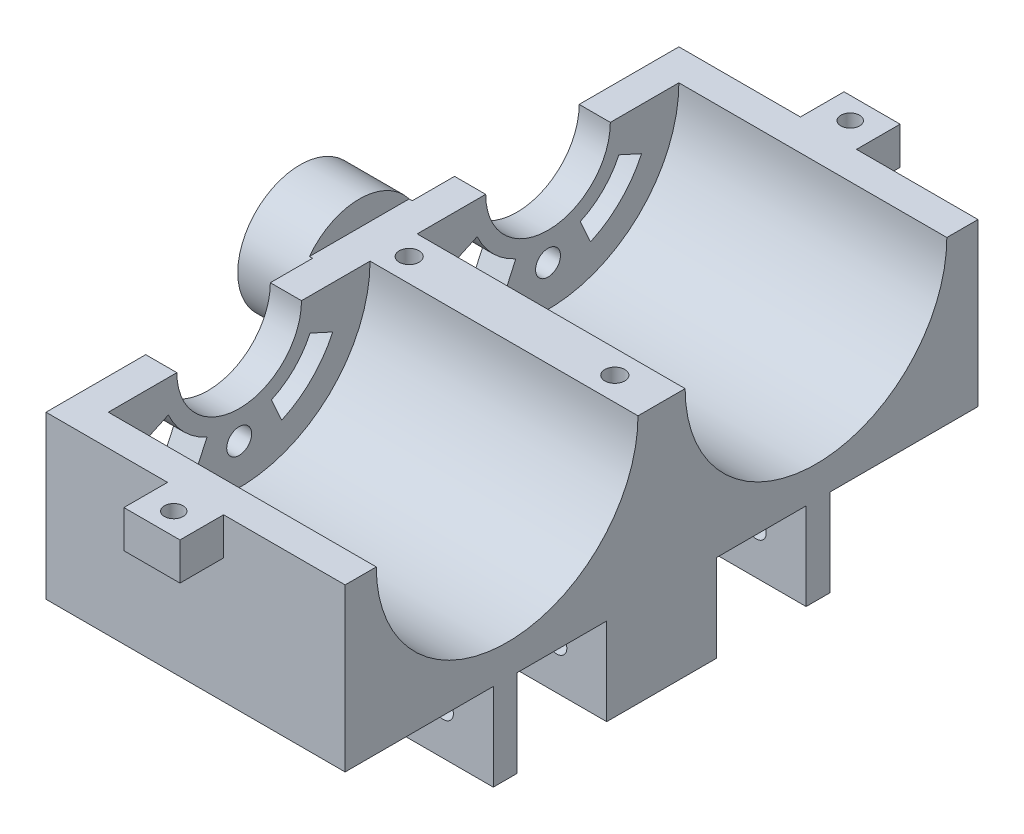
ISO-10303-21;
HEADER;
FILE_DESCRIPTION(('STEP AP214'),'2;1');
FILE_NAME('part.step','',(''),(''),'','','');
FILE_SCHEMA(('AUTOMOTIVE_DESIGN { 1 0 10303 214 1 1 1 1 }'));
ENDSEC;
DATA;
#1=APPLICATION_CONTEXT('core data for automotive mechanical design processes');
#2=APPLICATION_PROTOCOL_DEFINITION('international standard','automotive_design',2000,#1);
#3=PRODUCT_CONTEXT('',#1,'mechanical');
#4=PRODUCT('Part','Part','',(#3));
#5=PRODUCT_RELATED_PRODUCT_CATEGORY('part','',(#4));
#6=PRODUCT_DEFINITION_FORMATION('','',#4);
#7=PRODUCT_DEFINITION_CONTEXT('part definition',#1,'design');
#8=PRODUCT_DEFINITION('design','',#6,#7);
#9=PRODUCT_DEFINITION_SHAPE('','',#8);
#10=(LENGTH_UNIT() NAMED_UNIT(*) SI_UNIT(.MILLI.,.METRE.));
#11=(NAMED_UNIT(*) PLANE_ANGLE_UNIT() SI_UNIT($,.RADIAN.));
#12=(NAMED_UNIT(*) SI_UNIT($,.STERADIAN.) SOLID_ANGLE_UNIT());
#13=UNCERTAINTY_MEASURE_WITH_UNIT(LENGTH_MEASURE(1.E-05),#10,'distance_accuracy_value','');
#14=(GEOMETRIC_REPRESENTATION_CONTEXT(3) GLOBAL_UNCERTAINTY_ASSIGNED_CONTEXT((#13)) GLOBAL_UNIT_ASSIGNED_CONTEXT((#10,
#11,#12)) REPRESENTATION_CONTEXT('',''));
#15=CARTESIAN_POINT('',(0.,0.,0.));
#16=DIRECTION('',(0.,0.,1.));
#17=DIRECTION('',(1.,0.,0.));
#18=AXIS2_PLACEMENT_3D('',#15,#16,#17);
#19=CARTESIAN_POINT('',(0.,0.,0.));
#20=DIRECTION('',(0.,-1.,0.));
#21=DIRECTION('',(0.,0.,-1.));
#22=AXIS2_PLACEMENT_3D('',#19,#20,#21);
#23=PLANE('',#22);
#24=DIRECTION('',(0.,0.,-1.));
#25=VECTOR('',#24,1.);
#26=CARTESIAN_POINT('',(8.47765006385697,0.,50.5260853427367));
#27=LINE('',#26,#25);
#28=CARTESIAN_POINT('',(8.47765006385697,0.,50.5260853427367));
#29=VERTEX_POINT('',#28);
#30=CARTESIAN_POINT('',(8.47765006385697,0.,38.5260853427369));
#31=VERTEX_POINT('',#30);
#32=EDGE_CURVE('E1073',#29,#31,#27,.T.);
#33=ORIENTED_EDGE('',*,*,#32,.T.);
#34=DIRECTION('',(1.,0.,0.));
#35=VECTOR('',#34,1.);
#36=CARTESIAN_POINT('',(8.47765006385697,0.,38.5260853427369));
#37=LINE('',#36,#35);
#38=CARTESIAN_POINT('',(17.477650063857,0.,38.5260853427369));
#39=VERTEX_POINT('',#38);
#40=EDGE_CURVE('E1083',#31,#39,#37,.T.);
#41=ORIENTED_EDGE('',*,*,#40,.T.);
#42=DIRECTION('',(0.,0.,-1.));
#43=VECTOR('',#42,1.);
#44=CARTESIAN_POINT('',(17.477650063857,0.,50.5260853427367));
#45=LINE('',#44,#43);
#46=CARTESIAN_POINT('',(17.477650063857,0.,50.5260853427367));
#47=VERTEX_POINT('',#46);
#48=EDGE_CURVE('E1081',#47,#39,#45,.T.);
#49=ORIENTED_EDGE('',*,*,#48,.F.);
#50=DIRECTION('',(1.,0.,0.));
#51=VECTOR('',#50,1.);
#52=CARTESIAN_POINT('',(8.47765006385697,0.,50.5260853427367));
#53=LINE('',#52,#51);
#54=EDGE_CURVE('E1063',#29,#47,#53,.T.);
#55=ORIENTED_EDGE('',*,*,#54,.F.);
#56=EDGE_LOOP('',(#33,#41,#49,#55));
#57=FACE_BOUND('',#56,.T.);
#58=DIRECTION('',(0.,0.,-1.));
#59=VECTOR('',#58,1.);
#60=CARTESIAN_POINT('',(10.177650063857,0.,0.));
#61=LINE('',#60,#59);
#62=CARTESIAN_POINT('',(10.177650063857,0.,46.3626792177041));
#63=VERTEX_POINT('',#62);
#64=CARTESIAN_POINT('',(10.177650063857,0.,42.6813565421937));
#65=VERTEX_POINT('',#64);
#66=EDGE_CURVE('E690',#63,#65,#61,.T.);
#67=ORIENTED_EDGE('',*,*,#66,.F.);
#68=DIRECTION('',(0.918032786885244,0.,0.396504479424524));
#69=VECTOR('',#68,1.);
#70=CARTESIAN_POINT('',(-15.2761184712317,0.,35.3690269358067));
#71=LINE('',#70,#69);
#72=CARTESIAN_POINT('',(12.977650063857,0.,47.5720178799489));
#73=VERTEX_POINT('',#72);
#74=EDGE_CURVE('E56',#63,#73,#71,.T.);
#75=ORIENTED_EDGE('',*,*,#74,.T.);
#76=DIRECTION('',(0.918032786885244,0.,-0.396504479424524));
#77=VECTOR('',#76,1.);
#78=CARTESIAN_POINT('',(19.3567018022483,0.,44.8168629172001));
#79=LINE('',#78,#77);
#80=CARTESIAN_POINT('',(15.777650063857,0.,46.3626792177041));
#81=VERTEX_POINT('',#80);
#82=EDGE_CURVE('E672',#73,#81,#79,.T.);
#83=ORIENTED_EDGE('',*,*,#82,.T.);
#84=DIRECTION('',(0.,0.,-1.));
#85=VECTOR('',#84,1.);
#86=CARTESIAN_POINT('',(15.777650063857,0.,0.));
#87=LINE('',#86,#85);
#88=CARTESIAN_POINT('',(15.777650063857,0.,42.6813565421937));
#89=VERTEX_POINT('',#88);
#90=EDGE_CURVE('E699',#81,#89,#87,.T.);
#91=ORIENTED_EDGE('',*,*,#90,.T.);
#92=DIRECTION('',(0.918032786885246,0.,0.396504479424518));
#93=VECTOR('',#92,1.);
#94=CARTESIAN_POINT('',(-13.0556933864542,0.,30.2280433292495));
#95=LINE('',#94,#93);
#96=CARTESIAN_POINT('',(12.977650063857,0.,41.4720178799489));
#97=VERTEX_POINT('',#96);
#98=EDGE_CURVE('E696',#97,#89,#95,.T.);
#99=ORIENTED_EDGE('',*,*,#98,.F.);
#100=DIRECTION('',(0.918032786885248,0.,-0.396504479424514));
#101=VECTOR('',#100,1.);
#102=CARTESIAN_POINT('',(17.1362767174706,0.,39.675879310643));
#103=LINE('',#102,#101);
#104=EDGE_CURVE('E693',#65,#97,#103,.T.);
#105=ORIENTED_EDGE('',*,*,#104,.F.);
#106=EDGE_LOOP('',(#67,#75,#83,#91,#99,#105));
#107=FACE_BOUND('',#106,.T.);
#108=ADVANCED_FACE('F37',(#57,#107),#23,.T.);
#109=CARTESIAN_POINT('',(0.,0.,0.));
#110=DIRECTION('',(0.,1.,0.));
#111=DIRECTION('',(0.,0.,1.));
#112=AXIS2_PLACEMENT_3D('',#109,#110,#111);
#113=PLANE('',#112);
#114=DIRECTION('',(1.,0.,0.));
#115=VECTOR('',#114,1.);
#116=CARTESIAN_POINT('',(-24.522349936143,0.,38.5260853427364));
#117=LINE('',#116,#115);
#118=CARTESIAN_POINT('',(-24.522349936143,0.,38.5260853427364));
#119=VERTEX_POINT('',#118);
#120=CARTESIAN_POINT('',(-15.522349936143,0.,38.5260853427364));
#121=VERTEX_POINT('',#120);
#122=EDGE_CURVE('E968',#119,#121,#117,.T.);
#123=ORIENTED_EDGE('',*,*,#122,.T.);
#124=DIRECTION('',(0.,0.,-1.));
#125=VECTOR('',#124,1.);
#126=CARTESIAN_POINT('',(-15.522349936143,0.,50.5260853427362));
#127=LINE('',#126,#125);
#128=CARTESIAN_POINT('',(-15.522349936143,0.,50.5260853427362));
#129=VERTEX_POINT('',#128);
#130=EDGE_CURVE('E971',#129,#121,#127,.T.);
#131=ORIENTED_EDGE('',*,*,#130,.F.);
#132=DIRECTION('',(1.,0.,0.));
#133=VECTOR('',#132,1.);
#134=CARTESIAN_POINT('',(-24.522349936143,0.,50.5260853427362));
#135=LINE('',#134,#133);
#136=CARTESIAN_POINT('',(-24.522349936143,0.,50.5260853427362));
#137=VERTEX_POINT('',#136);
#138=EDGE_CURVE('E974',#137,#129,#135,.T.);
#139=ORIENTED_EDGE('',*,*,#138,.F.);
#140=DIRECTION('',(0.,0.,-1.));
#141=VECTOR('',#140,1.);
#142=CARTESIAN_POINT('',(-24.522349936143,0.,50.5260853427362));
#143=LINE('',#142,#141);
#144=EDGE_CURVE('E976',#137,#119,#143,.T.);
#145=ORIENTED_EDGE('',*,*,#144,.T.);
#146=EDGE_LOOP('',(#123,#131,#139,#145));
#147=FACE_BOUND('',#146,.T.);
#148=DIRECTION('',(0.918032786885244,0.,0.396504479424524));
#149=VECTOR('',#148,1.);
#150=CARTESIAN_POINT('',(-20.4642399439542,0.,47.3811626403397));
#151=LINE('',#150,#149);
#152=CARTESIAN_POINT('',(-22.822349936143,0.,46.3626792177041));
#153=VERTEX_POINT('',#152);
#154=CARTESIAN_POINT('',(-20.022349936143,0.,47.5720178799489));
#155=VERTEX_POINT('',#154);
#156=EDGE_CURVE('E64',#153,#155,#151,.T.);
#157=ORIENTED_EDGE('',*,*,#156,.T.);
#158=DIRECTION('',(0.918032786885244,0.,-0.396504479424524));
#159=VECTOR('',#158,1.);
#160=CARTESIAN_POINT('',(14.1685803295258,0.,32.804727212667));
#161=LINE('',#160,#159);
#162=CARTESIAN_POINT('',(-17.222349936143,0.,46.3626792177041));
#163=VERTEX_POINT('',#162);
#164=EDGE_CURVE('E655',#155,#163,#161,.T.);
#165=ORIENTED_EDGE('',*,*,#164,.T.);
#166=DIRECTION('',(0.,0.,-1.));
#167=VECTOR('',#166,1.);
#168=CARTESIAN_POINT('',(-17.222349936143,0.,0.));
#169=LINE('',#168,#167);
#170=CARTESIAN_POINT('',(-17.222349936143,0.,42.6813565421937));
#171=VERTEX_POINT('',#170);
#172=EDGE_CURVE('E652',#163,#171,#169,.T.);
#173=ORIENTED_EDGE('',*,*,#172,.T.);
#174=DIRECTION('',(0.918032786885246,0.,0.396504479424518));
#175=VECTOR('',#174,1.);
#176=CARTESIAN_POINT('',(-18.2438148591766,0.,42.2401790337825));
#177=LINE('',#176,#175);
#178=CARTESIAN_POINT('',(-20.022349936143,0.,41.4720178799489));
#179=VERTEX_POINT('',#178);
#180=EDGE_CURVE('E649',#179,#171,#177,.T.);
#181=ORIENTED_EDGE('',*,*,#180,.F.);
#182=DIRECTION('',(0.918032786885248,0.,-0.396504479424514));
#183=VECTOR('',#182,1.);
#184=CARTESIAN_POINT('',(11.9481552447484,0.,27.6637436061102));
#185=LINE('',#184,#183);
#186=CARTESIAN_POINT('',(-22.822349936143,0.,42.6813565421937));
#187=VERTEX_POINT('',#186);
#188=EDGE_CURVE('E646',#187,#179,#185,.T.);
#189=ORIENTED_EDGE('',*,*,#188,.F.);
#190=DIRECTION('',(0.,0.,-1.));
#191=VECTOR('',#190,1.);
#192=CARTESIAN_POINT('',(-22.822349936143,0.,0.));
#193=LINE('',#192,#191);
#194=EDGE_CURVE('E643',#153,#187,#193,.T.);
#195=ORIENTED_EDGE('',*,*,#194,.F.);
#196=EDGE_LOOP('',(#157,#165,#173,#181,#189,#195));
#197=FACE_BOUND('',#196,.T.);
#198=ADVANCED_FACE('F1415',(#147,#197),#113,.F.);
#199=CARTESIAN_POINT('',(12.977650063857,-4.52548339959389,44.5220178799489));
#200=DIRECTION('',(0.,1.,0.));
#201=DIRECTION('',(0.,0.,1.));
#202=AXIS2_PLACEMENT_3D('',#199,#200,#201);
#203=CYLINDRICAL_SURFACE('',#202,1.6);
#204=CARTESIAN_POINT('',(12.977650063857,26.,44.5220178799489));
#205=DIRECTION('',(0.,1.,0.));
#206=DIRECTION('',(0.,0.,1.));
#207=AXIS2_PLACEMENT_3D('',#204,#205,#206);
#208=CIRCLE('',#207,1.6);
#209=CARTESIAN_POINT('',(12.977650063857,26.,46.1220178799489));
#210=VERTEX_POINT('',#209);
#211=EDGE_CURVE('E660',#210,#210,#208,.T.);
#212=ORIENTED_EDGE('',*,*,#211,.T.);
#213=EDGE_LOOP('',(#212));
#214=FACE_BOUND('',#213,.T.);
#215=CARTESIAN_POINT('',(12.977650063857,4.,44.5220178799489));
#216=DIRECTION('',(0.,-1.,0.));
#217=DIRECTION('',(0.,0.,-1.));
#218=AXIS2_PLACEMENT_3D('',#215,#216,#217);
#219=CIRCLE('',#218,1.6);
#220=CARTESIAN_POINT('',(12.977650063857,4.,42.9220178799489));
#221=VERTEX_POINT('',#220);
#222=EDGE_CURVE('E685',#221,#221,#219,.F.);
#223=ORIENTED_EDGE('',*,*,#222,.F.);
#224=EDGE_LOOP('',(#223));
#225=FACE_BOUND('',#224,.T.);
#226=ADVANCED_FACE('F1442',(#214,#225),#203,.F.);
#227=CARTESIAN_POINT('',(-20.022349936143,-4.52548339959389,44.5220178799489));
#228=DIRECTION('',(0.,1.,0.));
#229=DIRECTION('',(0.,0.,1.));
#230=AXIS2_PLACEMENT_3D('',#227,#228,#229);
#231=CYLINDRICAL_SURFACE('',#230,1.6);
#232=CARTESIAN_POINT('',(-20.022349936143,26.,44.5220178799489));
#233=DIRECTION('',(0.,1.,0.));
#234=DIRECTION('',(0.,0.,1.));
#235=AXIS2_PLACEMENT_3D('',#232,#233,#234);
#236=CIRCLE('',#235,1.6);
#237=CARTESIAN_POINT('',(-20.022349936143,26.,46.1220178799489));
#238=VERTEX_POINT('',#237);
#239=EDGE_CURVE('E714',#238,#238,#236,.T.);
#240=ORIENTED_EDGE('',*,*,#239,.T.);
#241=EDGE_LOOP('',(#240));
#242=FACE_BOUND('',#241,.T.);
#243=CARTESIAN_POINT('',(-20.022349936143,4.,44.5220178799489));
#244=DIRECTION('',(0.,-1.,0.));
#245=DIRECTION('',(0.,0.,-1.));
#246=AXIS2_PLACEMENT_3D('',#243,#244,#245);
#247=CIRCLE('',#246,1.6);
#248=CARTESIAN_POINT('',(-20.022349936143,4.,42.9220178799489));
#249=VERTEX_POINT('',#248);
#250=EDGE_CURVE('E627',#249,#249,#247,.T.);
#251=ORIENTED_EDGE('',*,*,#250,.T.);
#252=EDGE_LOOP('',(#251));
#253=FACE_BOUND('',#252,.T.);
#254=ADVANCED_FACE('F1771',(#242,#253),#231,.F.);
#255=CARTESIAN_POINT('',(-3.52234993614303,20.,98.8020178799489));
#256=DIRECTION('',(0.,1.,0.));
#257=DIRECTION('',(0.,0.,1.));
#258=AXIS2_PLACEMENT_3D('',#255,#256,#257);
#259=CYLINDRICAL_SURFACE('',#258,1.5);
#260=CARTESIAN_POINT('',(-3.52234993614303,26.,98.8020178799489));
#261=DIRECTION('',(0.,1.,0.));
#262=DIRECTION('',(0.,0.,1.));
#263=AXIS2_PLACEMENT_3D('',#260,#261,#262);
#264=CIRCLE('',#263,1.5);
#265=CARTESIAN_POINT('',(-3.52234993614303,26.,100.302017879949));
#266=VERTEX_POINT('',#265);
#267=EDGE_CURVE('E760',#266,#266,#264,.T.);
#268=ORIENTED_EDGE('',*,*,#267,.T.);
#269=EDGE_LOOP('',(#268));
#270=FACE_BOUND('',#269,.T.);
#271=CARTESIAN_POINT('',(-3.52234993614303,22.5,98.8020178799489));
#272=DIRECTION('',(0.,-1.,0.));
#273=DIRECTION('',(0.,0.,-1.));
#274=AXIS2_PLACEMENT_3D('',#271,#272,#273);
#275=CIRCLE('',#274,1.5);
#276=CARTESIAN_POINT('',(-3.52234993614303,22.5,97.3020178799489));
#277=VERTEX_POINT('',#276);
#278=EDGE_CURVE('E737',#277,#277,#275,.F.);
#279=ORIENTED_EDGE('',*,*,#278,.F.);
#280=EDGE_LOOP('',(#279));
#281=FACE_BOUND('',#280,.T.);
#282=ADVANCED_FACE('F1769',(#270,#281),#259,.F.);
#283=CARTESIAN_POINT('',(0.,20.,0.));
#284=DIRECTION('',(0.,1.,0.));
#285=DIRECTION('',(0.,0.,1.));
#286=AXIS2_PLACEMENT_3D('',#283,#284,#285);
#287=PLANE('',#286);
#288=DIRECTION('',(1.3815833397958E-13,0.,1.));
#289=VECTOR('',#288,1.);
#290=CARTESIAN_POINT('',(0.977650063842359,20.,-1.38612780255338E-13));
#291=LINE('',#290,#289);
#292=CARTESIAN_POINT('',(0.977650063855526,20.,95.3020178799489));
#293=VERTEX_POINT('',#292);
#294=CARTESIAN_POINT('',(0.977650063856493,20.,102.302017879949));
#295=VERTEX_POINT('',#294);
#296=EDGE_CURVE('E771',#293,#295,#291,.T.);
#297=ORIENTED_EDGE('',*,*,#296,.T.);
#298=DIRECTION('',(1.,0.,0.));
#299=VECTOR('',#298,1.);
#300=CARTESIAN_POINT('',(-3.1549459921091E-13,20.,102.302017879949));
#301=LINE('',#300,#299);
#302=CARTESIAN_POINT('',(-8.02234993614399,20.,102.302017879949));
#303=VERTEX_POINT('',#302);
#304=EDGE_CURVE('E779',#303,#295,#301,.T.);
#305=ORIENTED_EDGE('',*,*,#304,.F.);
#306=DIRECTION('',(0.,0.,1.));
#307=VECTOR('',#306,1.);
#308=CARTESIAN_POINT('',(-8.02234993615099,20.,5.45167755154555E-13));
#309=LINE('',#308,#307);
#310=CARTESIAN_POINT('',(-8.02234993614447,20.,95.3020178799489));
#311=VERTEX_POINT('',#310);
#312=EDGE_CURVE('E776',#311,#303,#309,.T.);
#313=ORIENTED_EDGE('',*,*,#312,.F.);
#314=DIRECTION('',(1.,0.,0.));
#315=VECTOR('',#314,1.);
#316=CARTESIAN_POINT('',(0.,20.,95.3020178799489));
#317=LINE('',#316,#315);
#318=EDGE_CURVE('E773',#311,#293,#317,.T.);
#319=ORIENTED_EDGE('',*,*,#318,.T.);
#320=EDGE_LOOP('',(#297,#305,#313,#319));
#321=FACE_BOUND('',#320,.T.);
#322=DIRECTION('',(0.918032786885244,0.,0.396504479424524));
#323=VECTOR('',#322,1.);
#324=CARTESIAN_POINT('',(-37.6283224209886,20.,87.1214210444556));
#325=LINE('',#324,#323);
#326=CARTESIAN_POINT('',(-6.32234993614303,20.,100.642679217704));
#327=VERTEX_POINT('',#326);
#328=CARTESIAN_POINT('',(-3.52234993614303,20.,101.852017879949));
#329=VERTEX_POINT('',#328);
#330=EDGE_CURVE('E717',#327,#329,#325,.T.);
#331=ORIENTED_EDGE('',*,*,#330,.T.);
#332=DIRECTION('',(0.918032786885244,0.,-0.396504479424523));
#333=VECTOR('',#332,1.);
#334=CARTESIAN_POINT('',(36.5207842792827,20.,84.5571213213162));
#335=LINE('',#334,#333);
#336=CARTESIAN_POINT('',(-0.722349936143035,20.,100.642679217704));
#337=VERTEX_POINT('',#336);
#338=EDGE_CURVE('E724',#329,#337,#335,.T.);
#339=ORIENTED_EDGE('',*,*,#338,.T.);
#340=DIRECTION('',(0.,0.,-1.));
#341=VECTOR('',#340,1.);
#342=CARTESIAN_POINT('',(-0.722349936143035,20.,0.));
#343=LINE('',#342,#341);
#344=CARTESIAN_POINT('',(-0.722349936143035,20.,96.9613565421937));
#345=VERTEX_POINT('',#344);
#346=EDGE_CURVE('E752',#337,#345,#343,.T.);
#347=ORIENTED_EDGE('',*,*,#346,.T.);
#348=DIRECTION('',(0.918032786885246,0.,0.396504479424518));
#349=VECTOR('',#348,1.);
#350=CARTESIAN_POINT('',(-35.4078973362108,20.,81.9804374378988));
#351=LINE('',#350,#349);
#352=CARTESIAN_POINT('',(-3.52234993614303,20.,95.7520178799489));
#353=VERTEX_POINT('',#352);
#354=EDGE_CURVE('E749',#353,#345,#351,.T.);
#355=ORIENTED_EDGE('',*,*,#354,.F.);
#356=DIRECTION('',(0.918032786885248,0.,-0.396504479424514));
#357=VECTOR('',#356,1.);
#358=CARTESIAN_POINT('',(34.3003591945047,20.,79.4161377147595));
#359=LINE('',#358,#357);
#360=CARTESIAN_POINT('',(-6.32234993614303,20.,96.9613565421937));
#361=VERTEX_POINT('',#360);
#362=EDGE_CURVE('E746',#361,#353,#359,.T.);
#363=ORIENTED_EDGE('',*,*,#362,.F.);
#364=DIRECTION('',(0.,0.,-1.));
#365=VECTOR('',#364,1.);
#366=CARTESIAN_POINT('',(-6.32234993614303,20.,0.));
#367=LINE('',#366,#365);
#368=EDGE_CURVE('E743',#327,#361,#367,.T.);
#369=ORIENTED_EDGE('',*,*,#368,.F.);
#370=EDGE_LOOP('',(#331,#339,#347,#355,#363,#369));
#371=FACE_BOUND('',#370,.T.);
#372=ADVANCED_FACE('F1751',(#321,#371),#287,.F.);
#373=CARTESIAN_POINT('',(-22.522349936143,0.,0.));
#374=DIRECTION('',(1.,0.,0.));
#375=DIRECTION('',(0.,0.,-1.));
#376=AXIS2_PLACEMENT_3D('',#373,#374,#375);
#377=PLANE('',#376);
#378=CARTESIAN_POINT('',(-22.522349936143,26.,69.3020178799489));
#379=DIRECTION('',(1.,0.,0.));
#380=DIRECTION('',(0.,0.,-1.));
#381=AXIS2_PLACEMENT_3D('',#378,#379,#380);
#382=CIRCLE('',#381,12.5);
#383=CARTESIAN_POINT('',(-22.522349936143,20.8050877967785,57.9326341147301));
#384=VERTEX_POINT('',#383);
#385=CARTESIAN_POINT('',(-22.522349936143,14.6203631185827,64.1296040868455));
#386=VERTEX_POINT('',#385);
#387=EDGE_CURVE('E876',#384,#386,#382,.F.);
#388=ORIENTED_EDGE('',*,*,#387,.F.);
#389=DIRECTION('',(0.,-0.415592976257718,-0.909550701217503));
#390=VECTOR('',#389,1.);
#391=CARTESIAN_POINT('',(-22.522349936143,-4.68701812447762,2.14159783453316));
#392=LINE('',#391,#390);
#393=CARTESIAN_POINT('',(-22.522349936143,19.1427158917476,54.2944313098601));
#394=VERTEX_POINT('',#393);
#395=EDGE_CURVE('E889',#384,#394,#392,.T.);
#396=ORIENTED_EDGE('',*,*,#395,.T.);
#397=CARTESIAN_POINT('',(-22.522349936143,26.,69.3020178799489));
#398=DIRECTION('',(1.,0.,0.));
#399=DIRECTION('',(0.,0.,-1.));
#400=AXIS2_PLACEMENT_3D('',#397,#398,#399);
#401=CIRCLE('',#400,16.5);
#402=CARTESIAN_POINT('',(-22.522349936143,10.9788793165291,62.4744316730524));
#403=VERTEX_POINT('',#402);
#404=EDGE_CURVE('E891',#394,#403,#401,.F.);
#405=ORIENTED_EDGE('',*,*,#404,.T.);
#406=DIRECTION('',(0.,-0.910370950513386,-0.413793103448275));
#407=VECTOR('',#406,1.);
#408=CARTESIAN_POINT('',(-22.522349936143,-21.6545889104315,47.6414626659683));
#409=LINE('',#408,#407);
#410=EDGE_CURVE('E838',#386,#403,#409,.T.);
#411=ORIENTED_EDGE('',*,*,#410,.F.);
#412=EDGE_LOOP('',(#388,#396,#405,#411));
#413=FACE_BOUND('',#412,.T.);
#414=CARTESIAN_POINT('',(-22.522349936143,26.,69.3020178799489));
#415=DIRECTION('',(1.,0.,0.));
#416=DIRECTION('',(0.,0.,-1.));
#417=AXIS2_PLACEMENT_3D('',#414,#415,#416);
#418=CIRCLE('',#417,12.5);
#419=CARTESIAN_POINT('',(-22.522349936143,14.6203631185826,74.4744316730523));
#420=VERTEX_POINT('',#419);
#421=CARTESIAN_POINT('',(-22.522349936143,20.8050877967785,80.6714016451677));
#422=VERTEX_POINT('',#421);
#423=EDGE_CURVE('E894',#420,#422,#418,.F.);
#424=ORIENTED_EDGE('',*,*,#423,.F.);
#425=DIRECTION('',(0.,-0.910370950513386,0.413793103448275));
#426=VECTOR('',#425,1.);
#427=CARTESIAN_POINT('',(-22.522349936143,30.558274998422,67.2301341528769));
#428=LINE('',#427,#426);
#429=CARTESIAN_POINT('',(-22.522349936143,10.9788793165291,76.1296040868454));
#430=VERTEX_POINT('',#429);
#431=EDGE_CURVE('E893',#420,#430,#428,.T.);
#432=ORIENTED_EDGE('',*,*,#431,.T.);
#433=CARTESIAN_POINT('',(-22.522349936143,26.,69.3020178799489));
#434=DIRECTION('',(1.,0.,0.));
#435=DIRECTION('',(0.,0.,-1.));
#436=AXIS2_PLACEMENT_3D('',#433,#434,#435);
#437=CIRCLE('',#436,16.5);
#438=CARTESIAN_POINT('',(-22.522349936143,19.1427158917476,84.3096044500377));
#439=VERTEX_POINT('',#438);
#440=EDGE_CURVE('E872',#430,#439,#437,.F.);
#441=ORIENTED_EDGE('',*,*,#440,.T.);
#442=DIRECTION('',(0.,-0.415592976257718,0.909550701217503));
#443=VECTOR('',#442,1.);
#444=CARTESIAN_POINT('',(-22.522349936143,47.7057069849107,21.7977477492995));
#445=LINE('',#444,#443);
#446=EDGE_CURVE('E883',#422,#439,#445,.T.);
#447=ORIENTED_EDGE('',*,*,#446,.F.);
#448=EDGE_LOOP('',(#424,#432,#441,#447));
#449=FACE_BOUND('',#448,.T.);
#450=CARTESIAN_POINT('',(-22.522349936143,11.4999999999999,69.3020178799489));
#451=DIRECTION('',(1.,0.,0.));
#452=DIRECTION('',(0.,0.,-1.));
#453=AXIS2_PLACEMENT_3D('',#450,#451,#452);
#454=CIRCLE('',#453,2.);
#455=CARTESIAN_POINT('',(-22.522349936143,11.4999999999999,71.3020178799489));
#456=VERTEX_POINT('',#455);
#457=EDGE_CURVE('E868',#456,#456,#454,.F.);
#458=ORIENTED_EDGE('',*,*,#457,.T.);
#459=EDGE_LOOP('',(#458));
#460=FACE_BOUND('',#459,.T.);
#461=DIRECTION('',(0.,0.,-1.));
#462=VECTOR('',#461,1.);
#463=CARTESIAN_POINT('',(-22.522349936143,26.,0.));
#464=LINE('',#463,#462);
#465=CARTESIAN_POINT('',(-22.522349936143,26.,90.302017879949));
#466=VERTEX_POINT('',#465);
#467=CARTESIAN_POINT('',(-22.522349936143,26.,79.3020178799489));
#468=VERTEX_POINT('',#467);
#469=EDGE_CURVE('E821',#466,#468,#464,.T.);
#470=ORIENTED_EDGE('',*,*,#469,.F.);
#471=CARTESIAN_POINT('',(-22.522349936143,26.,69.3020178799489));
#472=DIRECTION('',(1.,0.,0.));
#473=DIRECTION('',(0.,0.,-1.));
#474=AXIS2_PLACEMENT_3D('',#471,#472,#473);
#475=CIRCLE('',#474,21.);
#476=CARTESIAN_POINT('',(-22.522349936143,26.,48.3020178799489));
#477=VERTEX_POINT('',#476);
#478=EDGE_CURVE('E815',#466,#477,#475,.T.);
#479=ORIENTED_EDGE('',*,*,#478,.T.);
#480=DIRECTION('',(0.,0.,-1.));
#481=VECTOR('',#480,1.);
#482=CARTESIAN_POINT('',(-22.522349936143,26.,0.));
#483=LINE('',#482,#481);
#484=CARTESIAN_POINT('',(-22.522349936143,26.,59.3020178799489));
#485=VERTEX_POINT('',#484);
#486=EDGE_CURVE('E873',#485,#477,#483,.T.);
#487=ORIENTED_EDGE('',*,*,#486,.F.);
#488=CARTESIAN_POINT('',(-22.522349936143,26.,69.3020178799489));
#489=DIRECTION('',(1.,0.,0.));
#490=DIRECTION('',(0.,0.,-1.));
#491=AXIS2_PLACEMENT_3D('',#488,#489,#490);
#492=CIRCLE('',#491,10.);
#493=EDGE_CURVE('E830',#485,#468,#492,.F.);
#494=ORIENTED_EDGE('',*,*,#493,.T.);
#495=EDGE_LOOP('',(#470,#479,#487,#494));
#496=FACE_BOUND('',#495,.T.);
#497=ADVANCED_FACE('F1515',(#413,#449,#460,#496),#377,.T.);
#498=CARTESIAN_POINT('',(-27.522349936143,0.,0.));
#499=DIRECTION('',(-1.,0.,0.));
#500=DIRECTION('',(0.,0.,1.));
#501=AXIS2_PLACEMENT_3D('',#498,#499,#500);
#502=PLANE('',#501);
#503=DIRECTION('',(0.,-0.415592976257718,-0.909550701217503));
#504=VECTOR('',#503,1.);
#505=CARTESIAN_POINT('',(-27.522349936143,-4.68701812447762,2.14159783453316));
#506=LINE('',#505,#504);
#507=CARTESIAN_POINT('',(-27.522349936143,19.2351801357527,54.4967949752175));
#508=VERTEX_POINT('',#507);
#509=CARTESIAN_POINT('',(-27.522349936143,19.1427158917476,54.2944313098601));
#510=VERTEX_POINT('',#509);
#511=EDGE_CURVE('E847',#508,#510,#506,.T.);
#512=ORIENTED_EDGE('',*,*,#511,.F.);
#513=CARTESIAN_POINT('',(-27.522349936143,20.,44.5260853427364));
#514=DIRECTION('',(-1.,0.,0.));
#515=DIRECTION('',(0.,0.,1.));
#516=AXIS2_PLACEMENT_3D('',#513,#514,#515);
#517=CIRCLE('',#516,10.);
#518=CARTESIAN_POINT('',(-27.522349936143,18.8032730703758,54.4542193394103));
#519=VERTEX_POINT('',#518);
#520=EDGE_CURVE('E1181',#519,#508,#517,.T.);
#521=ORIENTED_EDGE('',*,*,#520,.F.);
#522=CARTESIAN_POINT('',(-27.522349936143,26.,69.3020178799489));
#523=DIRECTION('',(-1.,0.,0.));
#524=DIRECTION('',(0.,0.,1.));
#525=AXIS2_PLACEMENT_3D('',#522,#523,#524);
#526=CIRCLE('',#525,16.5);
#527=EDGE_CURVE('E863',#510,#519,#526,.T.);
#528=ORIENTED_EDGE('',*,*,#527,.F.);
#529=EDGE_LOOP('',(#512,#521,#528));
#530=FACE_BOUND('',#529,.T.);
#531=ADVANCED_FACE('F1511',(#530),#502,.F.);
#532=CARTESIAN_POINT('',(0.,0.,0.));
#533=DIRECTION('',(0.,1.,0.));
#534=DIRECTION('',(0.,0.,1.));
#535=AXIS2_PLACEMENT_3D('',#532,#533,#534);
#536=PLANE('',#535);
#537=DIRECTION('',(1.,0.,0.));
#538=VECTOR('',#537,1.);
#539=CARTESIAN_POINT('',(-67.592787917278,0.,21.3260853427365));
#540=LINE('',#539,#538);
#541=CARTESIAN_POINT('',(-27.522349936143,0.,21.3260853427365));
#542=VERTEX_POINT('',#541);
#543=CARTESIAN_POINT('',(20.477650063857,0.,21.3260853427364));
#544=VERTEX_POINT('',#543);
#545=EDGE_CURVE('E1091',#542,#544,#540,.T.);
#546=ORIENTED_EDGE('',*,*,#545,.T.);
#547=DIRECTION('',(0.,0.,-1.));
#548=VECTOR('',#547,1.);
#549=CARTESIAN_POINT('',(20.477650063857,0.,-6.25798212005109));
#550=LINE('',#549,#548);
#551=CARTESIAN_POINT('',(20.477650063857,0.,35.7260853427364));
#552=VERTEX_POINT('',#551);
#553=EDGE_CURVE('E1378',#552,#544,#550,.T.);
#554=ORIENTED_EDGE('',*,*,#553,.F.);
#555=DIRECTION('',(1.,0.,0.));
#556=VECTOR('',#555,1.);
#557=CARTESIAN_POINT('',(-67.592787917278,0.,35.7260853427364));
#558=LINE('',#557,#556);
#559=CARTESIAN_POINT('',(-27.522349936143,0.,35.7260853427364));
#560=VERTEX_POINT('',#559);
#561=EDGE_CURVE('E1153',#560,#552,#558,.T.);
#562=ORIENTED_EDGE('',*,*,#561,.F.);
#563=DIRECTION('',(0.,0.,1.));
#564=VECTOR('',#563,1.);
#565=CARTESIAN_POINT('',(-27.522349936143,0.,-6.25798212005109));
#566=LINE('',#565,#564);
#567=EDGE_CURVE('E1358',#542,#560,#566,.T.);
#568=ORIENTED_EDGE('',*,*,#567,.F.);
#569=EDGE_LOOP('',(#546,#554,#562,#568));
#570=FACE_BOUND('',#569,.T.);
#571=ADVANCED_FACE('F1514',(#570),#536,.F.);
#572=DIRECTION('',(1.,0.,0.));
#573=VECTOR('',#572,1.);
#574=CARTESIAN_POINT('',(-67.592787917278,0.,17.5260853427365));
#575=LINE('',#574,#573);
#576=CARTESIAN_POINT('',(-27.522349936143,0.,17.5260853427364));
#577=VERTEX_POINT('',#576);
#578=CARTESIAN_POINT('',(20.477650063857,0.,17.5260853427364));
#579=VERTEX_POINT('',#578);
#580=EDGE_CURVE('E1105',#577,#579,#575,.T.);
#581=ORIENTED_EDGE('',*,*,#580,.F.);
#582=CARTESIAN_POINT('',(-27.522349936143,0.,-6.25798212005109));
#583=VERTEX_POINT('',#582);
#584=EDGE_CURVE('E1374',#583,#577,#566,.T.);
#585=ORIENTED_EDGE('',*,*,#584,.F.);
#586=DIRECTION('',(-1.,0.,0.));
#587=VECTOR('',#586,1.);
#588=CARTESIAN_POINT('',(-27.522349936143,0.,-6.25798212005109));
#589=LINE('',#588,#587);
#590=CARTESIAN_POINT('',(20.477650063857,0.,-6.25798212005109));
#591=VERTEX_POINT('',#590);
#592=EDGE_CURVE('E1381',#591,#583,#589,.T.);
#593=ORIENTED_EDGE('',*,*,#592,.F.);
#594=EDGE_CURVE('E1377',#579,#591,#550,.T.);
#595=ORIENTED_EDGE('',*,*,#594,.F.);
#596=EDGE_LOOP('',(#581,#585,#593,#595));
#597=FACE_BOUND('',#596,.T.);
#598=ADVANCED_FACE('F1521',(#597),#536,.F.);
#599=CARTESIAN_POINT('',(-37.522349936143,20.,44.5260853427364));
#600=DIRECTION('',(1.,0.,0.));
#601=DIRECTION('',(0.,0.,-1.));
#602=AXIS2_PLACEMENT_3D('',#599,#600,#601);
#603=CYLINDRICAL_SURFACE('',#602,10.);
#604=CARTESIAN_POINT('',(-37.522349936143,20.,44.5260853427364));
#605=DIRECTION('',(-1.,0.,0.));
#606=DIRECTION('',(0.,0.,1.));
#607=AXIS2_PLACEMENT_3D('',#604,#605,#606);
#608=CIRCLE('',#607,10.);
#609=CARTESIAN_POINT('',(-37.522349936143,20.,54.5260853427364));
#610=VERTEX_POINT('',#609);
#611=EDGE_CURVE('E1185',#610,#610,#608,.T.);
#612=ORIENTED_EDGE('',*,*,#611,.F.);
#613=EDGE_LOOP('',(#612));
#614=FACE_BOUND('',#613,.T.);
#615=DIRECTION('',(1.,0.,0.));
#616=VECTOR('',#615,1.);
#617=CARTESIAN_POINT('',(-28.022349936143,26.,52.5260853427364));
#618=LINE('',#617,#616);
#619=CARTESIAN_POINT('',(-28.022349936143,26.,52.5260853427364));
#620=VERTEX_POINT('',#619);
#621=CARTESIAN_POINT('',(-27.522349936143,26.,52.5260853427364));
#622=VERTEX_POINT('',#621);
#623=EDGE_CURVE('E1170',#620,#622,#618,.T.);
#624=ORIENTED_EDGE('',*,*,#623,.F.);
#625=CARTESIAN_POINT('',(-28.022349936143,20.,44.5260853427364));
#626=DIRECTION('',(1.,0.,0.));
#627=DIRECTION('',(0.,0.,-1.));
#628=AXIS2_PLACEMENT_3D('',#625,#626,#627);
#629=CIRCLE('',#628,10.);
#630=CARTESIAN_POINT('',(-28.022349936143,26.,36.5260853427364));
#631=VERTEX_POINT('',#630);
#632=EDGE_CURVE('E1166',#631,#620,#629,.T.);
#633=ORIENTED_EDGE('',*,*,#632,.F.);
#634=DIRECTION('',(1.,0.,0.));
#635=VECTOR('',#634,1.);
#636=CARTESIAN_POINT('',(-28.022349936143,26.,36.5260853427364));
#637=LINE('',#636,#635);
#638=CARTESIAN_POINT('',(-27.522349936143,26.,36.5260853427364));
#639=VERTEX_POINT('',#638);
#640=EDGE_CURVE('E1169',#631,#639,#637,.T.);
#641=ORIENTED_EDGE('',*,*,#640,.T.);
#642=CARTESIAN_POINT('',(-27.522349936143,19.2313277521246,34.5556719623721));
#643=VERTEX_POINT('',#642);
#644=EDGE_CURVE('E48',#639,#643,#517,.T.);
#645=ORIENTED_EDGE('',*,*,#644,.T.);
#646=CARTESIAN_POINT('',(-27.522349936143,18.8167416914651,34.5963371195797));
#647=VERTEX_POINT('',#646);
#648=EDGE_CURVE('E49',#643,#647,#517,.T.);
#649=ORIENTED_EDGE('',*,*,#648,.T.);
#650=EDGE_CURVE('E11',#647,#519,#517,.T.);
#651=ORIENTED_EDGE('',*,*,#650,.T.);
#652=ORIENTED_EDGE('',*,*,#520,.T.);
#653=CARTESIAN_POINT('',(-27.522349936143,20.,44.5260853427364));
#654=DIRECTION('',(-1.,0.,0.));
#655=DIRECTION('',(0.,0.,1.));
#656=AXIS2_PLACEMENT_3D('',#653,#654,#655);
#657=CIRCLE('',#656,10.);
#658=EDGE_CURVE('E871',#508,#622,#657,.T.);
#659=ORIENTED_EDGE('',*,*,#658,.T.);
#660=EDGE_LOOP('',(#624,#633,#641,#645,#649,#651,#652,#659));
#661=FACE_BOUND('',#660,.T.);
#662=ADVANCED_FACE('F1517',(#614,#661),#603,.T.);
#663=CARTESIAN_POINT('',(-3.52234993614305,20.,-9.75798212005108));
#664=DIRECTION('',(0.,1.,0.));
#665=DIRECTION('',(0.,0.,1.));
#666=AXIS2_PLACEMENT_3D('',#663,#664,#665);
#667=CYLINDRICAL_SURFACE('',#666,1.5);
#668=CARTESIAN_POINT('',(-3.52234993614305,26.,-9.75798212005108));
#669=DIRECTION('',(0.,1.,0.));
#670=DIRECTION('',(0.,0.,1.));
#671=AXIS2_PLACEMENT_3D('',#668,#669,#670);
#672=CIRCLE('',#671,1.5);
#673=CARTESIAN_POINT('',(-3.52234993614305,26.,-8.25798212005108));
#674=VERTEX_POINT('',#673);
#675=EDGE_CURVE('E1230',#674,#674,#672,.T.);
#676=ORIENTED_EDGE('',*,*,#675,.T.);
#677=EDGE_LOOP('',(#676));
#678=FACE_BOUND('',#677,.T.);
#679=CARTESIAN_POINT('',(-3.52234993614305,22.5,-9.75798212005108));
#680=DIRECTION('',(0.,-1.,0.));
#681=DIRECTION('',(0.,0.,-1.));
#682=AXIS2_PLACEMENT_3D('',#679,#680,#681);
#683=CIRCLE('',#682,1.5);
#684=CARTESIAN_POINT('',(-3.52234993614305,22.5,-11.2579821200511));
#685=VERTEX_POINT('',#684);
#686=EDGE_CURVE('E1207',#685,#685,#683,.F.);
#687=ORIENTED_EDGE('',*,*,#686,.F.);
#688=EDGE_LOOP('',(#687));
#689=FACE_BOUND('',#688,.T.);
#690=ADVANCED_FACE('F1520',(#678,#689),#667,.F.);
#691=CARTESIAN_POINT('',(0.,20.,0.));
#692=DIRECTION('',(0.,1.,0.));
#693=DIRECTION('',(0.,0.,1.));
#694=AXIS2_PLACEMENT_3D('',#691,#692,#693);
#695=PLANE('',#694);
#696=DIRECTION('',(0.,0.,1.));
#697=VECTOR('',#696,1.);
#698=CARTESIAN_POINT('',(0.977650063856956,20.,0.));
#699=LINE('',#698,#697);
#700=CARTESIAN_POINT('',(0.977650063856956,20.,-13.2579821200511));
#701=VERTEX_POINT('',#700);
#702=CARTESIAN_POINT('',(0.977650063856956,20.,-6.25798212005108));
#703=VERTEX_POINT('',#702);
#704=EDGE_CURVE('E1241',#701,#703,#699,.T.);
#705=ORIENTED_EDGE('',*,*,#704,.T.);
#706=DIRECTION('',(1.,0.,0.));
#707=VECTOR('',#706,1.);
#708=CARTESIAN_POINT('',(0.,20.,-6.25798212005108));
#709=LINE('',#708,#707);
#710=CARTESIAN_POINT('',(-8.02234993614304,20.,-6.25798212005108));
#711=VERTEX_POINT('',#710);
#712=EDGE_CURVE('E1248',#711,#703,#709,.T.);
#713=ORIENTED_EDGE('',*,*,#712,.F.);
#714=DIRECTION('',(0.,0.,1.));
#715=VECTOR('',#714,1.);
#716=CARTESIAN_POINT('',(-8.02234993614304,20.,0.));
#717=LINE('',#716,#715);
#718=CARTESIAN_POINT('',(-8.02234993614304,20.,-13.2579821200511));
#719=VERTEX_POINT('',#718);
#720=EDGE_CURVE('E1246',#719,#711,#717,.T.);
#721=ORIENTED_EDGE('',*,*,#720,.F.);
#722=DIRECTION('',(1.,0.,0.));
#723=VECTOR('',#722,1.);
#724=CARTESIAN_POINT('',(0.,20.,-13.2579821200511));
#725=LINE('',#724,#723);
#726=EDGE_CURVE('E1243',#719,#701,#725,.T.);
#727=ORIENTED_EDGE('',*,*,#726,.T.);
#728=EDGE_LOOP('',(#705,#713,#721,#727));
#729=FACE_BOUND('',#728,.T.);
#730=DIRECTION('',(0.918032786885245,0.,0.39650447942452));
#731=VECTOR('',#730,1.);
#732=CARTESIAN_POINT('',(1.88796400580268,20.,-4.37123146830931));
#733=LINE('',#732,#731);
#734=CARTESIAN_POINT('',(-6.32234993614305,20.,-7.91732078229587));
#735=VERTEX_POINT('',#734);
#736=CARTESIAN_POINT('',(-3.52234993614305,20.,-6.70798212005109));
#737=VERTEX_POINT('',#736);
#738=EDGE_CURVE('E1187',#735,#737,#733,.T.);
#739=ORIENTED_EDGE('',*,*,#738,.T.);
#740=DIRECTION('',(0.918032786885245,0.,-0.396504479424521));
#741=VECTOR('',#740,1.);
#742=CARTESIAN_POINT('',(-2.99550214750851,20.,-6.93553119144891));
#743=LINE('',#742,#741);
#744=CARTESIAN_POINT('',(-0.722349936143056,20.,-7.91732078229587));
#745=VERTEX_POINT('',#744);
#746=EDGE_CURVE('E1194',#737,#745,#743,.T.);
#747=ORIENTED_EDGE('',*,*,#746,.T.);
#748=DIRECTION('',(0.,0.,-1.));
#749=VECTOR('',#748,1.);
#750=CARTESIAN_POINT('',(-0.722349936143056,20.,0.));
#751=LINE('',#750,#749);
#752=CARTESIAN_POINT('',(-0.722349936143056,20.,-11.5986434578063));
#753=VERTEX_POINT('',#752);
#754=EDGE_CURVE('E1222',#745,#753,#751,.T.);
#755=ORIENTED_EDGE('',*,*,#754,.T.);
#756=DIRECTION('',(0.918032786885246,0.,0.39650447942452));
#757=VECTOR('',#756,1.);
#758=CARTESIAN_POINT('',(4.10838909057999,20.,-9.5122150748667));
#759=LINE('',#758,#757);
#760=CARTESIAN_POINT('',(-3.52234993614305,20.,-12.8079821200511));
#761=VERTEX_POINT('',#760);
#762=EDGE_CURVE('E1219',#761,#753,#759,.T.);
#763=ORIENTED_EDGE('',*,*,#762,.F.);
#764=DIRECTION('',(0.918032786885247,0.,-0.396504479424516));
#765=VECTOR('',#764,1.);
#766=CARTESIAN_POINT('',(-5.21592723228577,20.,-12.0765147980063));
#767=LINE('',#766,#765);
#768=CARTESIAN_POINT('',(-6.32234993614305,20.,-11.5986434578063));
#769=VERTEX_POINT('',#768);
#770=EDGE_CURVE('E1216',#769,#761,#767,.T.);
#771=ORIENTED_EDGE('',*,*,#770,.F.);
#772=DIRECTION('',(0.,0.,-1.));
#773=VECTOR('',#772,1.);
#774=CARTESIAN_POINT('',(-6.32234993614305,20.,0.));
#775=LINE('',#774,#773);
#776=EDGE_CURVE('E1213',#735,#769,#775,.T.);
#777=ORIENTED_EDGE('',*,*,#776,.F.);
#778=EDGE_LOOP('',(#739,#747,#755,#763,#771,#777));
#779=FACE_BOUND('',#778,.T.);
#780=ADVANCED_FACE('F1552',(#729,#779),#695,.F.);
#781=CARTESIAN_POINT('',(-27.522349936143,26.,-6.25798212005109));
#782=DIRECTION('',(0.,0.,1.));
#783=DIRECTION('',(1.,0.,0.));
#784=AXIS2_PLACEMENT_3D('',#781,#782,#783);
#785=PLANE('',#784);
#786=DIRECTION('',(0.,1.,0.));
#787=VECTOR('',#786,1.);
#788=CARTESIAN_POINT('',(-8.02234993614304,20.,-6.25798212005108));
#789=LINE('',#788,#787);
#790=CARTESIAN_POINT('',(-8.02234993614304,26.,-6.25798212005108));
#791=VERTEX_POINT('',#790);
#792=EDGE_CURVE('E1264',#711,#791,#789,.T.);
#793=ORIENTED_EDGE('',*,*,#792,.F.);
#794=ORIENTED_EDGE('',*,*,#712,.T.);
#795=DIRECTION('',(0.,1.,0.));
#796=VECTOR('',#795,1.);
#797=CARTESIAN_POINT('',(0.977650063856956,20.,-6.25798212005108));
#798=LINE('',#797,#796);
#799=CARTESIAN_POINT('',(0.977650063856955,26.,-6.25798212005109));
#800=VERTEX_POINT('',#799);
#801=EDGE_CURVE('E1260',#703,#800,#798,.T.);
#802=ORIENTED_EDGE('',*,*,#801,.T.);
#803=DIRECTION('',(-1.,0.,0.));
#804=VECTOR('',#803,1.);
#805=CARTESIAN_POINT('',(-27.522349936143,26.,-6.25798212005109));
#806=LINE('',#805,#804);
#807=CARTESIAN_POINT('',(20.477650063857,26.,-6.25798212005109));
#808=VERTEX_POINT('',#807);
#809=EDGE_CURVE('E1370',#808,#800,#806,.T.);
#810=ORIENTED_EDGE('',*,*,#809,.F.);
#811=DIRECTION('',(0.,-1.,0.));
#812=VECTOR('',#811,1.);
#813=CARTESIAN_POINT('',(20.477650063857,26.,-6.25798212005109));
#814=LINE('',#813,#812);
#815=EDGE_CURVE('E1385',#808,#591,#814,.T.);
#816=ORIENTED_EDGE('',*,*,#815,.T.);
#817=ORIENTED_EDGE('',*,*,#592,.T.);
#818=DIRECTION('',(0.,-1.,0.));
#819=VECTOR('',#818,1.);
#820=CARTESIAN_POINT('',(-27.522349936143,26.,-6.25798212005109));
#821=LINE('',#820,#819);
#822=CARTESIAN_POINT('',(-27.522349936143,26.,-6.25798212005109));
#823=VERTEX_POINT('',#822);
#824=EDGE_CURVE('E1373',#823,#583,#821,.T.);
#825=ORIENTED_EDGE('',*,*,#824,.F.);
#826=EDGE_CURVE('E1369',#791,#823,#806,.T.);
#827=ORIENTED_EDGE('',*,*,#826,.F.);
#828=EDGE_LOOP('',(#793,#794,#802,#810,#816,#817,#825,#827));
#829=FACE_BOUND('',#828,.T.);
#830=ADVANCED_FACE('F1555',(#829),#785,.F.);
#831=CARTESIAN_POINT('',(0.,26.,0.));
#832=DIRECTION('',(0.,1.,0.));
#833=DIRECTION('',(0.,0.,1.));
#834=AXIS2_PLACEMENT_3D('',#831,#832,#833);
#835=PLANE('',#834);
#836=DIRECTION('',(-1.,0.,0.));
#837=VECTOR('',#836,1.);
#838=CARTESIAN_POINT('',(20.477650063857,26.,9.7420178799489));
#839=LINE('',#838,#837);
#840=CARTESIAN_POINT('',(-22.522349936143,26.,9.74201787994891));
#841=VERTEX_POINT('',#840);
#842=CARTESIAN_POINT('',(-27.522349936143,26.,9.74201787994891));
#843=VERTEX_POINT('',#842);
#844=EDGE_CURVE('E1342',#841,#843,#839,.T.);
#845=ORIENTED_EDGE('',*,*,#844,.F.);
#846=DIRECTION('',(0.,0.,1.));
#847=VECTOR('',#846,1.);
#848=CARTESIAN_POINT('',(-22.522349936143,26.,0.));
#849=LINE('',#848,#847);
#850=CARTESIAN_POINT('',(-22.522349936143,26.,-1.2579821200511));
#851=VERTEX_POINT('',#850);
#852=EDGE_CURVE('E1351',#851,#841,#849,.T.);
#853=ORIENTED_EDGE('',*,*,#852,.F.);
#854=DIRECTION('',(1.,0.,0.));
#855=VECTOR('',#854,1.);
#856=CARTESIAN_POINT('',(-22.522349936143,26.,-1.2579821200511));
#857=LINE('',#856,#855);
#858=CARTESIAN_POINT('',(20.477650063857,26.,-1.2579821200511));
#859=VERTEX_POINT('',#858);
#860=EDGE_CURVE('E1354',#851,#859,#857,.T.);
#861=ORIENTED_EDGE('',*,*,#860,.T.);
#862=DIRECTION('',(0.,0.,-1.));
#863=VECTOR('',#862,1.);
#864=CARTESIAN_POINT('',(20.477650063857,26.,-6.25798212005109));
#865=LINE('',#864,#863);
#866=EDGE_CURVE('E1364',#859,#808,#865,.T.);
#867=ORIENTED_EDGE('',*,*,#866,.T.);
#868=ORIENTED_EDGE('',*,*,#809,.T.);
#869=DIRECTION('',(0.,0.,1.));
#870=VECTOR('',#869,1.);
#871=CARTESIAN_POINT('',(0.977650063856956,26.,0.));
#872=LINE('',#871,#870);
#873=CARTESIAN_POINT('',(0.977650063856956,26.,-13.2579821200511));
#874=VERTEX_POINT('',#873);
#875=EDGE_CURVE('E1254',#874,#800,#872,.T.);
#876=ORIENTED_EDGE('',*,*,#875,.F.);
#877=DIRECTION('',(1.,0.,0.));
#878=VECTOR('',#877,1.);
#879=CARTESIAN_POINT('',(0.,26.,-13.2579821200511));
#880=LINE('',#879,#878);
#881=CARTESIAN_POINT('',(-8.02234993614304,26.,-13.2579821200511));
#882=VERTEX_POINT('',#881);
#883=EDGE_CURVE('E1256',#882,#874,#880,.T.);
#884=ORIENTED_EDGE('',*,*,#883,.F.);
#885=DIRECTION('',(0.,0.,1.));
#886=VECTOR('',#885,1.);
#887=CARTESIAN_POINT('',(-8.02234993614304,26.,0.));
#888=LINE('',#887,#886);
#889=EDGE_CURVE('E1244',#882,#791,#888,.T.);
#890=ORIENTED_EDGE('',*,*,#889,.T.);
#891=ORIENTED_EDGE('',*,*,#826,.T.);
#892=DIRECTION('',(0.,0.,1.));
#893=VECTOR('',#892,1.);
#894=CARTESIAN_POINT('',(-27.522349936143,26.,-6.25798212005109));
#895=LINE('',#894,#893);
#896=EDGE_CURVE('E1361',#823,#843,#895,.T.);
#897=ORIENTED_EDGE('',*,*,#896,.T.);
#898=EDGE_LOOP('',(#845,#853,#861,#867,#868,#876,#884,#890,#891,#897));
#899=FACE_BOUND('',#898,.T.);
#900=ORIENTED_EDGE('',*,*,#675,.F.);
#901=EDGE_LOOP('',(#900));
#902=FACE_BOUND('',#901,.T.);
#903=ADVANCED_FACE('F1624',(#899,#902),#835,.T.);
#904=CARTESIAN_POINT('',(-27.522349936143,26.,-6.25798212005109));
#905=DIRECTION('',(1.,0.,0.));
#906=DIRECTION('',(0.,0.,-1.));
#907=AXIS2_PLACEMENT_3D('',#904,#905,#906);
#908=PLANE('',#907);
#909=DIRECTION('',(0.,1.,0.));
#910=VECTOR('',#909,1.);
#911=CARTESIAN_POINT('',(-27.522349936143,0.,71.5260853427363));
#912=LINE('',#911,#910);
#913=CARTESIAN_POINT('',(-27.522349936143,-14.,71.5260853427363));
#914=VERTEX_POINT('',#913);
#915=CARTESIAN_POINT('',(-27.522349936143,0.,71.5260853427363));
#916=VERTEX_POINT('',#915);
#917=EDGE_CURVE('E1122',#914,#916,#912,.T.);
#918=ORIENTED_EDGE('',*,*,#917,.T.);
#919=DIRECTION('',(0.,0.,1.));
#920=VECTOR('',#919,1.);
#921=CARTESIAN_POINT('',(-27.522349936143,0.,0.));
#922=LINE('',#921,#920);
#923=CARTESIAN_POINT('',(-27.522349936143,0.,95.3020178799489));
#924=VERTEX_POINT('',#923);
#925=EDGE_CURVE('E831',#916,#924,#922,.T.);
#926=ORIENTED_EDGE('',*,*,#925,.T.);
#927=DIRECTION('',(0.,1.,0.));
#928=VECTOR('',#927,1.);
#929=CARTESIAN_POINT('',(-27.522349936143,0.,95.3020178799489));
#930=LINE('',#929,#928);
#931=CARTESIAN_POINT('',(-27.522349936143,26.,95.3020178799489));
#932=VERTEX_POINT('',#931);
#933=EDGE_CURVE('E827',#924,#932,#930,.T.);
#934=ORIENTED_EDGE('',*,*,#933,.T.);
#935=DIRECTION('',(0.,0.,-1.));
#936=VECTOR('',#935,1.);
#937=CARTESIAN_POINT('',(-27.522349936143,26.,0.));
#938=LINE('',#937,#936);
#939=CARTESIAN_POINT('',(-27.522349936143,26.,79.3020178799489));
#940=VERTEX_POINT('',#939);
#941=EDGE_CURVE('E840',#932,#940,#938,.T.);
#942=ORIENTED_EDGE('',*,*,#941,.T.);
#943=CARTESIAN_POINT('',(-27.522349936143,26.,69.3020178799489));
#944=DIRECTION('',(-1.,0.,0.));
#945=DIRECTION('',(0.,0.,1.));
#946=AXIS2_PLACEMENT_3D('',#943,#944,#945);
#947=CIRCLE('',#946,10.);
#948=CARTESIAN_POINT('',(-27.522349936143,26.,59.3020178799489));
#949=VERTEX_POINT('',#948);
#950=EDGE_CURVE('E835',#949,#940,#947,.T.);
#951=ORIENTED_EDGE('',*,*,#950,.F.);
#952=EDGE_CURVE('E834',#949,#622,#938,.T.);
#953=ORIENTED_EDGE('',*,*,#952,.T.);
#954=ORIENTED_EDGE('',*,*,#658,.F.);
#955=CARTESIAN_POINT('',(-27.522349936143,20.8050877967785,57.9326341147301));
#956=VERTEX_POINT('',#955);
#957=EDGE_CURVE('E843',#956,#508,#506,.T.);
#958=ORIENTED_EDGE('',*,*,#957,.F.);
#959=CARTESIAN_POINT('',(-27.522349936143,26.,69.3020178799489));
#960=DIRECTION('',(-1.,0.,0.));
#961=DIRECTION('',(0.,0.,1.));
#962=AXIS2_PLACEMENT_3D('',#959,#960,#961);
#963=CIRCLE('',#962,12.5);
#964=CARTESIAN_POINT('',(-27.522349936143,14.6203631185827,64.1296040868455));
#965=VERTEX_POINT('',#964);
#966=EDGE_CURVE('E850',#956,#965,#963,.T.);
#967=ORIENTED_EDGE('',*,*,#966,.T.);
#968=DIRECTION('',(0.,-0.910370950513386,-0.413793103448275));
#969=VECTOR('',#968,1.);
#970=CARTESIAN_POINT('',(-27.522349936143,-21.6545889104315,47.6414626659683));
#971=LINE('',#970,#969);
#972=CARTESIAN_POINT('',(-27.522349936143,10.9788793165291,62.4744316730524));
#973=VERTEX_POINT('',#972);
#974=EDGE_CURVE('E842',#965,#973,#971,.T.);
#975=ORIENTED_EDGE('',*,*,#974,.T.);
#976=EDGE_CURVE('E862',#519,#973,#526,.T.);
#977=ORIENTED_EDGE('',*,*,#976,.F.);
#978=ORIENTED_EDGE('',*,*,#650,.F.);
#979=CARTESIAN_POINT('',(-27.522349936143,26.,19.7420178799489));
#980=DIRECTION('',(-1.,0.,0.));
#981=DIRECTION('',(0.,0.,1.));
#982=AXIS2_PLACEMENT_3D('',#979,#980,#981);
#983=CIRCLE('',#982,16.5);
#984=CARTESIAN_POINT('',(-27.522349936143,10.9788793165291,26.5696040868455));
#985=VERTEX_POINT('',#984);
#986=EDGE_CURVE('E1308',#985,#647,#983,.T.);
#987=ORIENTED_EDGE('',*,*,#986,.F.);
#988=DIRECTION('',(0.,-0.910370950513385,0.413793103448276));
#989=VECTOR('',#988,1.);
#990=CARTESIAN_POINT('',(-27.522349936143,11.8887642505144,26.1560318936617));
#991=LINE('',#990,#989);
#992=CARTESIAN_POINT('',(-27.522349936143,14.6203631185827,24.9144316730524));
#993=VERTEX_POINT('',#992);
#994=EDGE_CURVE('E1313',#993,#985,#991,.T.);
#995=ORIENTED_EDGE('',*,*,#994,.F.);
#996=CARTESIAN_POINT('',(-27.522349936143,26.,19.7420178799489));
#997=DIRECTION('',(-1.,0.,0.));
#998=DIRECTION('',(0.,0.,1.));
#999=AXIS2_PLACEMENT_3D('',#996,#997,#998);
#1000=CIRCLE('',#999,12.5);
#1001=CARTESIAN_POINT('',(-27.522349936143,20.8050877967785,31.1114016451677));
#1002=VERTEX_POINT('',#1001);
#1003=EDGE_CURVE('E1292',#993,#1002,#1000,.T.);
#1004=ORIENTED_EDGE('',*,*,#1003,.T.);
#1005=DIRECTION('',(0.,-0.415592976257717,0.909550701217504));
#1006=VECTOR('',#1005,1.);
#1007=CARTESIAN_POINT('',(-27.522349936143,28.9718841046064,13.2378673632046));
#1008=LINE('',#1007,#1006);
#1009=EDGE_CURVE('E1303',#1002,#643,#1008,.T.);
#1010=ORIENTED_EDGE('',*,*,#1009,.T.);
#1011=ORIENTED_EDGE('',*,*,#644,.F.);
#1012=CARTESIAN_POINT('',(-27.522349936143,26.,29.7420178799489));
#1013=VERTEX_POINT('',#1012);
#1014=EDGE_CURVE('E1365',#1013,#639,#895,.T.);
#1015=ORIENTED_EDGE('',*,*,#1014,.F.);
#1016=CARTESIAN_POINT('',(-27.522349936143,26.,19.7420178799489));
#1017=DIRECTION('',(-1.,0.,0.));
#1018=DIRECTION('',(0.,0.,1.));
#1019=AXIS2_PLACEMENT_3D('',#1016,#1017,#1018);
#1020=CIRCLE('',#1019,10.);
#1021=EDGE_CURVE('E1340',#843,#1013,#1020,.T.);
#1022=ORIENTED_EDGE('',*,*,#1021,.F.);
#1023=ORIENTED_EDGE('',*,*,#896,.F.);
#1024=ORIENTED_EDGE('',*,*,#824,.T.);
#1025=ORIENTED_EDGE('',*,*,#584,.T.);
#1026=DIRECTION('',(0.,1.,0.));
#1027=VECTOR('',#1026,1.);
#1028=CARTESIAN_POINT('',(-27.522349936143,0.,17.5260853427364));
#1029=LINE('',#1028,#1027);
#1030=CARTESIAN_POINT('',(-27.5223499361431,-14.,17.5260853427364));
#1031=VERTEX_POINT('',#1030);
#1032=EDGE_CURVE('E1088',#1031,#577,#1029,.T.);
#1033=ORIENTED_EDGE('',*,*,#1032,.F.);
#1034=DIRECTION('',(0.,0.,1.));
#1035=VECTOR('',#1034,1.);
#1036=CARTESIAN_POINT('',(-27.522349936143,-14.,0.));
#1037=LINE('',#1036,#1035);
#1038=CARTESIAN_POINT('',(-27.522349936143,-14.,21.3260853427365));
#1039=VERTEX_POINT('',#1038);
#1040=EDGE_CURVE('E1094',#1031,#1039,#1037,.T.);
#1041=ORIENTED_EDGE('',*,*,#1040,.T.);
#1042=DIRECTION('',(0.,-1.,0.));
#1043=VECTOR('',#1042,1.);
#1044=CARTESIAN_POINT('',(-27.522349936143,0.,21.3260853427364));
#1045=LINE('',#1044,#1043);
#1046=EDGE_CURVE('E1090',#542,#1039,#1045,.T.);
#1047=ORIENTED_EDGE('',*,*,#1046,.F.);
#1048=ORIENTED_EDGE('',*,*,#567,.T.);
#1049=DIRECTION('',(0.,1.,0.));
#1050=VECTOR('',#1049,1.);
#1051=CARTESIAN_POINT('',(-27.522349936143,0.,35.7260853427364));
#1052=LINE('',#1051,#1050);
#1053=CARTESIAN_POINT('',(-27.522349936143,-14.,35.7260853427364));
#1054=VERTEX_POINT('',#1053);
#1055=EDGE_CURVE('E1119',#1054,#560,#1052,.T.);
#1056=ORIENTED_EDGE('',*,*,#1055,.F.);
#1057=DIRECTION('',(0.,0.,1.));
#1058=VECTOR('',#1057,1.);
#1059=CARTESIAN_POINT('',(-27.522349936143,-14.,0.));
#1060=LINE('',#1059,#1058);
#1061=CARTESIAN_POINT('',(-27.522349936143,-14.,53.3260853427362));
#1062=VERTEX_POINT('',#1061);
#1063=EDGE_CURVE('E1116',#1054,#1062,#1060,.T.);
#1064=ORIENTED_EDGE('',*,*,#1063,.T.);
#1065=DIRECTION('',(0.,-1.,0.));
#1066=VECTOR('',#1065,1.);
#1067=CARTESIAN_POINT('',(-27.522349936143,0.,53.3260853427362));
#1068=LINE('',#1067,#1066);
#1069=CARTESIAN_POINT('',(-27.5223499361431,0.,53.3260853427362));
#1070=VERTEX_POINT('',#1069);
#1071=EDGE_CURVE('E1113',#1070,#1062,#1068,.T.);
#1072=ORIENTED_EDGE('',*,*,#1071,.F.);
#1073=DIRECTION('',(0.,0.,-1.));
#1074=VECTOR('',#1073,1.);
#1075=CARTESIAN_POINT('',(-27.522349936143,0.,0.));
#1076=LINE('',#1075,#1074);
#1077=CARTESIAN_POINT('',(-27.522349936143,0.,67.7260853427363));
#1078=VERTEX_POINT('',#1077);
#1079=EDGE_CURVE('E1117',#1078,#1070,#1076,.T.);
#1080=ORIENTED_EDGE('',*,*,#1079,.F.);
#1081=DIRECTION('',(0.,1.,0.));
#1082=VECTOR('',#1081,1.);
#1083=CARTESIAN_POINT('',(-27.522349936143,0.,67.7260853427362));
#1084=LINE('',#1083,#1082);
#1085=CARTESIAN_POINT('',(-27.522349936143,-14.,67.7260853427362));
#1086=VERTEX_POINT('',#1085);
#1087=EDGE_CURVE('E1127',#1086,#1078,#1084,.T.);
#1088=ORIENTED_EDGE('',*,*,#1087,.F.);
#1089=DIRECTION('',(0.,0.,1.));
#1090=VECTOR('',#1089,1.);
#1091=CARTESIAN_POINT('',(-27.522349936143,-14.,0.));
#1092=LINE('',#1091,#1090);
#1093=EDGE_CURVE('E1125',#1086,#914,#1092,.T.);
#1094=ORIENTED_EDGE('',*,*,#1093,.T.);
#1095=EDGE_LOOP('',(#918,#926,#934,#942,#951,#953,#954,#958,#967,#975,#977,#978,#987,#995,#1004,
#1010,#1011,#1015,#1022,#1023,#1024,#1025,#1033,#1041,#1047,#1048,#1056,#1064,#1072,#1080,#1088,#1094));
#1096=FACE_BOUND('',#1095,.T.);
#1097=CARTESIAN_POINT('',(-27.522349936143,11.5,19.7420178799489));
#1098=DIRECTION('',(-1.,0.,0.));
#1099=DIRECTION('',(0.,0.,1.));
#1100=AXIS2_PLACEMENT_3D('',#1097,#1098,#1099);
#1101=CIRCLE('',#1100,2.);
#1102=CARTESIAN_POINT('',(-27.522349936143,11.5,21.7420178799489));
#1103=VERTEX_POINT('',#1102);
#1104=EDGE_CURVE('E1286',#1103,#1103,#1101,.T.);
#1105=ORIENTED_EDGE('',*,*,#1104,.F.);
#1106=EDGE_LOOP('',(#1105));
#1107=FACE_BOUND('',#1106,.T.);
#1108=CARTESIAN_POINT('',(-27.522349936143,26.,19.7420178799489));
#1109=DIRECTION('',(-1.,0.,0.));
#1110=DIRECTION('',(0.,0.,1.));
#1111=AXIS2_PLACEMENT_3D('',#1108,#1109,#1110);
#1112=CIRCLE('',#1111,16.5);
#1113=CARTESIAN_POINT('',(-27.522349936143,19.1427158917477,4.7344313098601));
#1114=VERTEX_POINT('',#1113);
#1115=CARTESIAN_POINT('',(-27.522349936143,10.9788793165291,12.9144316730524));
#1116=VERTEX_POINT('',#1115);
#1117=EDGE_CURVE('E1275',#1114,#1116,#1112,.T.);
#1118=ORIENTED_EDGE('',*,*,#1117,.F.);
#1119=DIRECTION('',(0.,-0.415592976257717,-0.909550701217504));
#1120=VECTOR('',#1119,1.);
#1121=CARTESIAN_POINT('',(-27.522349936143,14.0468047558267,-6.41828255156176));
#1122=LINE('',#1121,#1120);
#1123=CARTESIAN_POINT('',(-27.522349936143,20.8050877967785,8.37263411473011));
#1124=VERTEX_POINT('',#1123);
#1125=EDGE_CURVE('E1279',#1124,#1114,#1122,.T.);
#1126=ORIENTED_EDGE('',*,*,#1125,.F.);
#1127=CARTESIAN_POINT('',(-27.522349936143,26.,19.7420178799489));
#1128=DIRECTION('',(-1.,0.,0.));
#1129=DIRECTION('',(0.,0.,1.));
#1130=AXIS2_PLACEMENT_3D('',#1127,#1128,#1129);
#1131=CIRCLE('',#1130,12.5);
#1132=CARTESIAN_POINT('',(-27.522349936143,14.6203631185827,14.5696040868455));
#1133=VERTEX_POINT('',#1132);
#1134=EDGE_CURVE('E1283',#1124,#1133,#1131,.T.);
#1135=ORIENTED_EDGE('',*,*,#1134,.T.);
#1136=DIRECTION('',(0.,-0.910370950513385,-0.413793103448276));
#1137=VECTOR('',#1136,1.);
#1138=CARTESIAN_POINT('',(-27.522349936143,-2.98507816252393,6.56736040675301));
#1139=LINE('',#1138,#1137);
#1140=EDGE_CURVE('E1270',#1133,#1116,#1139,.T.);
#1141=ORIENTED_EDGE('',*,*,#1140,.T.);
#1142=EDGE_LOOP('',(#1118,#1126,#1135,#1141));
#1143=FACE_BOUND('',#1142,.T.);
#1144=CARTESIAN_POINT('',(-27.522349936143,26.,69.3020178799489));
#1145=DIRECTION('',(-1.,0.,0.));
#1146=DIRECTION('',(0.,0.,1.));
#1147=AXIS2_PLACEMENT_3D('',#1144,#1145,#1146);
#1148=CIRCLE('',#1147,12.5);
#1149=CARTESIAN_POINT('',(-27.522349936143,14.6203631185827,74.4744316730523));
#1150=VERTEX_POINT('',#1149);
#1151=CARTESIAN_POINT('',(-27.522349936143,20.8050877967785,80.6714016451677));
#1152=VERTEX_POINT('',#1151);
#1153=EDGE_CURVE('E825',#1150,#1152,#1148,.T.);
#1154=ORIENTED_EDGE('',*,*,#1153,.T.);
#1155=DIRECTION('',(0.,-0.415592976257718,0.909550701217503));
#1156=VECTOR('',#1155,1.);
#1157=CARTESIAN_POINT('',(-27.522349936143,47.7057069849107,21.7977477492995));
#1158=LINE('',#1157,#1156);
#1159=CARTESIAN_POINT('',(-27.522349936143,19.1427158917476,84.3096044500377));
#1160=VERTEX_POINT('',#1159);
#1161=EDGE_CURVE('E853',#1152,#1160,#1158,.T.);
#1162=ORIENTED_EDGE('',*,*,#1161,.T.);
#1163=CARTESIAN_POINT('',(-27.522349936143,10.9788793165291,76.1296040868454));
#1164=VERTEX_POINT('',#1163);
#1165=EDGE_CURVE('E859',#1164,#1160,#526,.T.);
#1166=ORIENTED_EDGE('',*,*,#1165,.F.);
#1167=DIRECTION('',(0.,-0.910370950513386,0.413793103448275));
#1168=VECTOR('',#1167,1.);
#1169=CARTESIAN_POINT('',(-27.522349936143,30.558274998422,67.2301341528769));
#1170=LINE('',#1169,#1168);
#1171=EDGE_CURVE('E854',#1150,#1164,#1170,.T.);
#1172=ORIENTED_EDGE('',*,*,#1171,.F.);
#1173=EDGE_LOOP('',(#1154,#1162,#1166,#1172));
#1174=FACE_BOUND('',#1173,.T.);
#1175=CARTESIAN_POINT('',(-27.522349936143,11.4999999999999,69.3020178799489));
#1176=DIRECTION('',(-1.,0.,0.));
#1177=DIRECTION('',(0.,0.,1.));
#1178=AXIS2_PLACEMENT_3D('',#1175,#1176,#1177);
#1179=CIRCLE('',#1178,2.);
#1180=CARTESIAN_POINT('',(-27.522349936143,11.4999999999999,71.3020178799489));
#1181=VERTEX_POINT('',#1180);
#1182=EDGE_CURVE('E822',#1181,#1181,#1179,.T.);
#1183=ORIENTED_EDGE('',*,*,#1182,.F.);
#1184=EDGE_LOOP('',(#1183));
#1185=FACE_BOUND('',#1184,.T.);
#1186=ADVANCED_FACE('F39',(#1096,#1107,#1143,#1174,#1185),#908,.F.);
#1187=CARTESIAN_POINT('',(20.477650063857,26.,-6.25798212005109));
#1188=DIRECTION('',(-1.,0.,0.));
#1189=DIRECTION('',(0.,0.,1.));
#1190=AXIS2_PLACEMENT_3D('',#1187,#1188,#1189);
#1191=PLANE('',#1190);
#1192=CARTESIAN_POINT('',(20.477650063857,26.,48.3020178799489));
#1193=VERTEX_POINT('',#1192);
#1194=CARTESIAN_POINT('',(20.477650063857,26.,40.7420178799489));
#1195=VERTEX_POINT('',#1194);
#1196=EDGE_CURVE('E1366',#1193,#1195,#865,.T.);
#1197=ORIENTED_EDGE('',*,*,#1196,.F.);
#1198=CARTESIAN_POINT('',(20.477650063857,26.,69.3020178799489));
#1199=DIRECTION('',(-1.,0.,0.));
#1200=DIRECTION('',(0.,0.,1.));
#1201=AXIS2_PLACEMENT_3D('',#1198,#1199,#1200);
#1202=CIRCLE('',#1201,21.);
#1203=CARTESIAN_POINT('',(20.477650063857,26.,90.302017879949));
#1204=VERTEX_POINT('',#1203);
#1205=EDGE_CURVE('E812',#1204,#1193,#1202,.F.);
#1206=ORIENTED_EDGE('',*,*,#1205,.F.);
#1207=DIRECTION('',(0.,0.,1.));
#1208=VECTOR('',#1207,1.);
#1209=CARTESIAN_POINT('',(20.477650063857,26.,0.));
#1210=LINE('',#1209,#1208);
#1211=CARTESIAN_POINT('',(20.477650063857,26.,95.3020178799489));
#1212=VERTEX_POINT('',#1211);
#1213=EDGE_CURVE('E809',#1204,#1212,#1210,.T.);
#1214=ORIENTED_EDGE('',*,*,#1213,.T.);
#1215=DIRECTION('',(0.,-1.,0.));
#1216=VECTOR('',#1215,1.);
#1217=CARTESIAN_POINT('',(20.477650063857,0.,95.3020178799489));
#1218=LINE('',#1217,#1216);
#1219=CARTESIAN_POINT('',(20.477650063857,0.,95.3020178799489));
#1220=VERTEX_POINT('',#1219);
#1221=EDGE_CURVE('E805',#1212,#1220,#1218,.T.);
#1222=ORIENTED_EDGE('',*,*,#1221,.T.);
#1223=DIRECTION('',(0.,0.,-1.));
#1224=VECTOR('',#1223,1.);
#1225=CARTESIAN_POINT('',(20.477650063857,0.,0.));
#1226=LINE('',#1225,#1224);
#1227=CARTESIAN_POINT('',(20.477650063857,0.,71.5260853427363));
#1228=VERTEX_POINT('',#1227);
#1229=EDGE_CURVE('E802',#1220,#1228,#1226,.T.);
#1230=ORIENTED_EDGE('',*,*,#1229,.T.);
#1231=DIRECTION('',(0.,-1.,0.));
#1232=VECTOR('',#1231,1.);
#1233=CARTESIAN_POINT('',(20.477650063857,0.,71.5260853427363));
#1234=LINE('',#1233,#1232);
#1235=CARTESIAN_POINT('',(20.477650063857,-14.,71.5260853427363));
#1236=VERTEX_POINT('',#1235);
#1237=EDGE_CURVE('E1146',#1228,#1236,#1234,.T.);
#1238=ORIENTED_EDGE('',*,*,#1237,.T.);
#1239=DIRECTION('',(0.,0.,-1.));
#1240=VECTOR('',#1239,1.);
#1241=CARTESIAN_POINT('',(20.477650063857,-14.,0.));
#1242=LINE('',#1241,#1240);
#1243=CARTESIAN_POINT('',(20.477650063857,-14.,67.7260853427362));
#1244=VERTEX_POINT('',#1243);
#1245=EDGE_CURVE('E1143',#1236,#1244,#1242,.T.);
#1246=ORIENTED_EDGE('',*,*,#1245,.T.);
#1247=DIRECTION('',(0.,-1.,0.));
#1248=VECTOR('',#1247,1.);
#1249=CARTESIAN_POINT('',(20.477650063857,0.,67.7260853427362));
#1250=LINE('',#1249,#1248);
#1251=CARTESIAN_POINT('',(20.477650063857,0.,67.7260853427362));
#1252=VERTEX_POINT('',#1251);
#1253=EDGE_CURVE('E1112',#1252,#1244,#1250,.T.);
#1254=ORIENTED_EDGE('',*,*,#1253,.F.);
#1255=DIRECTION('',(0.,0.,1.));
#1256=VECTOR('',#1255,1.);
#1257=CARTESIAN_POINT('',(20.477650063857,0.,0.));
#1258=LINE('',#1257,#1256);
#1259=CARTESIAN_POINT('',(20.477650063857,0.,53.3260853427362));
#1260=VERTEX_POINT('',#1259);
#1261=EDGE_CURVE('E1133',#1260,#1252,#1258,.T.);
#1262=ORIENTED_EDGE('',*,*,#1261,.F.);
#1263=DIRECTION('',(0.,1.,0.));
#1264=VECTOR('',#1263,1.);
#1265=CARTESIAN_POINT('',(20.477650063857,0.,53.3260853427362));
#1266=LINE('',#1265,#1264);
#1267=CARTESIAN_POINT('',(20.477650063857,-14.,53.3260853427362));
#1268=VERTEX_POINT('',#1267);
#1269=EDGE_CURVE('E1136',#1268,#1260,#1266,.T.);
#1270=ORIENTED_EDGE('',*,*,#1269,.F.);
#1271=CARTESIAN_POINT('',(20.477650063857,-14.,35.7260853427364));
#1272=VERTEX_POINT('',#1271);
#1273=EDGE_CURVE('E1139',#1268,#1272,#1242,.T.);
#1274=ORIENTED_EDGE('',*,*,#1273,.T.);
#1275=DIRECTION('',(0.,-1.,0.));
#1276=VECTOR('',#1275,1.);
#1277=CARTESIAN_POINT('',(20.477650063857,0.,35.7260853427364));
#1278=LINE('',#1277,#1276);
#1279=EDGE_CURVE('E1142',#552,#1272,#1278,.T.);
#1280=ORIENTED_EDGE('',*,*,#1279,.F.);
#1281=ORIENTED_EDGE('',*,*,#553,.T.);
#1282=DIRECTION('',(0.,1.,0.));
#1283=VECTOR('',#1282,1.);
#1284=CARTESIAN_POINT('',(20.477650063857,0.,21.3260853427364));
#1285=LINE('',#1284,#1283);
#1286=CARTESIAN_POINT('',(20.477650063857,-14.,21.3260853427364));
#1287=VERTEX_POINT('',#1286);
#1288=EDGE_CURVE('E993',#1287,#544,#1285,.T.);
#1289=ORIENTED_EDGE('',*,*,#1288,.F.);
#1290=DIRECTION('',(0.,0.,-1.));
#1291=VECTOR('',#1290,1.);
#1292=CARTESIAN_POINT('',(20.477650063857,-14.,0.));
#1293=LINE('',#1292,#1291);
#1294=CARTESIAN_POINT('',(20.477650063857,-14.,17.5260853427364));
#1295=VERTEX_POINT('',#1294);
#1296=EDGE_CURVE('E1096',#1287,#1295,#1293,.T.);
#1297=ORIENTED_EDGE('',*,*,#1296,.T.);
#1298=DIRECTION('',(0.,-1.,0.));
#1299=VECTOR('',#1298,1.);
#1300=CARTESIAN_POINT('',(20.477650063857,0.,17.5260853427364));
#1301=LINE('',#1300,#1299);
#1302=EDGE_CURVE('E1099',#579,#1295,#1301,.T.);
#1303=ORIENTED_EDGE('',*,*,#1302,.F.);
#1304=ORIENTED_EDGE('',*,*,#594,.T.);
#1305=ORIENTED_EDGE('',*,*,#815,.F.);
#1306=ORIENTED_EDGE('',*,*,#866,.F.);
#1307=CARTESIAN_POINT('',(20.477650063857,26.,19.7420178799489));
#1308=DIRECTION('',(1.,0.,0.));
#1309=DIRECTION('',(0.,0.,-1.));
#1310=AXIS2_PLACEMENT_3D('',#1307,#1308,#1309);
#1311=CIRCLE('',#1310,21.);
#1312=EDGE_CURVE('E1346',#1195,#859,#1311,.T.);
#1313=ORIENTED_EDGE('',*,*,#1312,.F.);
#1314=EDGE_LOOP('',(#1197,#1206,#1214,#1222,#1230,#1238,#1246,#1254,#1262,#1270,#1274,#1280,
#1281,#1289,#1297,#1303,#1304,#1305,#1306,#1313));
#1315=FACE_BOUND('',#1314,.T.);
#1316=ADVANCED_FACE('F1622',(#1315),#1191,.F.);
#1317=ORIENTED_EDGE('',*,*,#239,.F.);
#1318=EDGE_LOOP('',(#1317));
#1319=FACE_BOUND('',#1318,.T.);
#1320=ORIENTED_EDGE('',*,*,#211,.F.);
#1321=EDGE_LOOP('',(#1320));
#1322=FACE_BOUND('',#1321,.T.);
#1323=DIRECTION('',(-1.,0.,0.));
#1324=VECTOR('',#1323,1.);
#1325=CARTESIAN_POINT('',(76.4436540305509,26.,48.3020178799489));
#1326=LINE('',#1325,#1324);
#1327=EDGE_CURVE('E795',#1193,#477,#1326,.T.);
#1328=ORIENTED_EDGE('',*,*,#1327,.F.);
#1329=ORIENTED_EDGE('',*,*,#1196,.T.);
#1330=DIRECTION('',(1.,0.,0.));
#1331=VECTOR('',#1330,1.);
#1332=CARTESIAN_POINT('',(-22.522349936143,26.,40.7420178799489));
#1333=LINE('',#1332,#1331);
#1334=CARTESIAN_POINT('',(-22.522349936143,26.,40.7420178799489));
#1335=VERTEX_POINT('',#1334);
#1336=EDGE_CURVE('E1356',#1335,#1195,#1333,.T.);
#1337=ORIENTED_EDGE('',*,*,#1336,.F.);
#1338=CARTESIAN_POINT('',(-22.522349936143,26.,29.7420178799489));
#1339=VERTEX_POINT('',#1338);
#1340=EDGE_CURVE('E1350',#1339,#1335,#849,.T.);
#1341=ORIENTED_EDGE('',*,*,#1340,.F.);
#1342=DIRECTION('',(-1.,0.,0.));
#1343=VECTOR('',#1342,1.);
#1344=CARTESIAN_POINT('',(20.477650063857,26.,29.7420178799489));
#1345=LINE('',#1344,#1343);
#1346=EDGE_CURVE('E1343',#1339,#1013,#1345,.T.);
#1347=ORIENTED_EDGE('',*,*,#1346,.T.);
#1348=ORIENTED_EDGE('',*,*,#1014,.T.);
#1349=ORIENTED_EDGE('',*,*,#640,.F.);
#1350=DIRECTION('',(0.,0.,1.));
#1351=VECTOR('',#1350,1.);
#1352=CARTESIAN_POINT('',(-28.022349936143,26.,0.));
#1353=LINE('',#1352,#1351);
#1354=EDGE_CURVE('E1130',#631,#620,#1353,.T.);
#1355=ORIENTED_EDGE('',*,*,#1354,.T.);
#1356=ORIENTED_EDGE('',*,*,#623,.T.);
#1357=ORIENTED_EDGE('',*,*,#952,.F.);
#1358=DIRECTION('',(-1.,0.,0.));
#1359=VECTOR('',#1358,1.);
#1360=CARTESIAN_POINT('',(33.4436540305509,26.,59.3020178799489));
#1361=LINE('',#1360,#1359);
#1362=EDGE_CURVE('E839',#485,#949,#1361,.T.);
#1363=ORIENTED_EDGE('',*,*,#1362,.F.);
#1364=ORIENTED_EDGE('',*,*,#486,.T.);
#1365=EDGE_LOOP('',(#1328,#1329,#1337,#1341,#1347,#1348,#1349,#1355,#1356,#1357,#1363,#1364));
#1366=FACE_BOUND('',#1365,.T.);
#1367=ADVANCED_FACE('F1618',(#1319,#1322,#1366),#835,.T.);
#1368=CARTESIAN_POINT('',(-22.522349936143,26.,19.7420178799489));
#1369=DIRECTION('',(1.,0.,0.));
#1370=DIRECTION('',(0.,0.,-1.));
#1371=AXIS2_PLACEMENT_3D('',#1368,#1369,#1370);
#1372=CYLINDRICAL_SURFACE('',#1371,21.);
#1373=ORIENTED_EDGE('',*,*,#1312,.T.);
#1374=ORIENTED_EDGE('',*,*,#860,.F.);
#1375=CARTESIAN_POINT('',(-22.522349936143,26.,19.7420178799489));
#1376=DIRECTION('',(1.,0.,0.));
#1377=DIRECTION('',(0.,0.,-1.));
#1378=AXIS2_PLACEMENT_3D('',#1375,#1376,#1377);
#1379=CIRCLE('',#1378,21.);
#1380=EDGE_CURVE('E1348',#1335,#851,#1379,.T.);
#1381=ORIENTED_EDGE('',*,*,#1380,.F.);
#1382=ORIENTED_EDGE('',*,*,#1336,.T.);
#1383=EDGE_LOOP('',(#1373,#1374,#1381,#1382));
#1384=FACE_BOUND('',#1383,.T.);
#1385=ADVANCED_FACE('F1614',(#1384),#1372,.F.);
#1386=CARTESIAN_POINT('',(-22.522349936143,0.,0.));
#1387=DIRECTION('',(1.,0.,0.));
#1388=DIRECTION('',(0.,0.,-1.));
#1389=AXIS2_PLACEMENT_3D('',#1386,#1387,#1388);
#1390=PLANE('',#1389);
#1391=DIRECTION('',(0.,-0.910370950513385,0.413793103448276));
#1392=VECTOR('',#1391,1.);
#1393=CARTESIAN_POINT('',(-22.522349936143,11.8887642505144,26.1560318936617));
#1394=LINE('',#1393,#1392);
#1395=CARTESIAN_POINT('',(-22.522349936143,14.6203631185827,24.9144316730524));
#1396=VERTEX_POINT('',#1395);
#1397=CARTESIAN_POINT('',(-22.522349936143,10.9788793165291,26.5696040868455));
#1398=VERTEX_POINT('',#1397);
#1399=EDGE_CURVE('E1311',#1396,#1398,#1394,.T.);
#1400=ORIENTED_EDGE('',*,*,#1399,.T.);
#1401=CARTESIAN_POINT('',(-22.522349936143,26.,19.7420178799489));
#1402=DIRECTION('',(1.,0.,0.));
#1403=DIRECTION('',(0.,0.,-1.));
#1404=AXIS2_PLACEMENT_3D('',#1401,#1402,#1403);
#1405=CIRCLE('',#1404,16.5);
#1406=CARTESIAN_POINT('',(-22.522349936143,19.1427158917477,34.7496044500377));
#1407=VERTEX_POINT('',#1406);
#1408=EDGE_CURVE('E1324',#1398,#1407,#1405,.F.);
#1409=ORIENTED_EDGE('',*,*,#1408,.T.);
#1410=DIRECTION('',(0.,-0.415592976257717,0.909550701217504));
#1411=VECTOR('',#1410,1.);
#1412=CARTESIAN_POINT('',(-22.522349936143,28.9718841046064,13.2378673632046));
#1413=LINE('',#1412,#1411);
#1414=CARTESIAN_POINT('',(-22.522349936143,20.8050877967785,31.1114016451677));
#1415=VERTEX_POINT('',#1414);
#1416=EDGE_CURVE('E1316',#1415,#1407,#1413,.T.);
#1417=ORIENTED_EDGE('',*,*,#1416,.F.);
#1418=CARTESIAN_POINT('',(-22.522349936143,26.,19.7420178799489));
#1419=DIRECTION('',(1.,0.,0.));
#1420=DIRECTION('',(0.,0.,-1.));
#1421=AXIS2_PLACEMENT_3D('',#1418,#1419,#1420);
#1422=CIRCLE('',#1421,12.5);
#1423=EDGE_CURVE('E1263',#1396,#1415,#1422,.F.);
#1424=ORIENTED_EDGE('',*,*,#1423,.F.);
#1425=EDGE_LOOP('',(#1400,#1409,#1417,#1424));
#1426=FACE_BOUND('',#1425,.T.);
#1427=DIRECTION('',(0.,-0.415592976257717,-0.909550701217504));
#1428=VECTOR('',#1427,1.);
#1429=CARTESIAN_POINT('',(-22.522349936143,14.0468047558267,-6.41828255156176));
#1430=LINE('',#1429,#1428);
#1431=CARTESIAN_POINT('',(-22.522349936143,20.8050877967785,8.37263411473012));
#1432=VERTEX_POINT('',#1431);
#1433=CARTESIAN_POINT('',(-22.522349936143,19.1427158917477,4.7344313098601));
#1434=VERTEX_POINT('',#1433);
#1435=EDGE_CURVE('E1278',#1432,#1434,#1430,.T.);
#1436=ORIENTED_EDGE('',*,*,#1435,.T.);
#1437=CARTESIAN_POINT('',(-22.522349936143,26.,19.7420178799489));
#1438=DIRECTION('',(1.,0.,0.));
#1439=DIRECTION('',(0.,0.,-1.));
#1440=AXIS2_PLACEMENT_3D('',#1437,#1438,#1439);
#1441=CIRCLE('',#1440,16.5);
#1442=CARTESIAN_POINT('',(-22.522349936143,10.9788793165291,12.9144316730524));
#1443=VERTEX_POINT('',#1442);
#1444=EDGE_CURVE('E1294',#1434,#1443,#1441,.F.);
#1445=ORIENTED_EDGE('',*,*,#1444,.T.);
#1446=DIRECTION('',(0.,-0.910370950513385,-0.413793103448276));
#1447=VECTOR('',#1446,1.);
#1448=CARTESIAN_POINT('',(-22.522349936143,-2.98507816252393,6.56736040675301));
#1449=LINE('',#1448,#1447);
#1450=CARTESIAN_POINT('',(-22.522349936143,14.6203631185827,14.5696040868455));
#1451=VERTEX_POINT('',#1450);
#1452=EDGE_CURVE('E1282',#1451,#1443,#1449,.T.);
#1453=ORIENTED_EDGE('',*,*,#1452,.F.);
#1454=CARTESIAN_POINT('',(-22.522349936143,26.,19.7420178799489));
#1455=DIRECTION('',(1.,0.,0.));
#1456=DIRECTION('',(0.,0.,-1.));
#1457=AXIS2_PLACEMENT_3D('',#1454,#1455,#1456);
#1458=CIRCLE('',#1457,12.5);
#1459=EDGE_CURVE('E1290',#1432,#1451,#1458,.F.);
#1460=ORIENTED_EDGE('',*,*,#1459,.F.);
#1461=EDGE_LOOP('',(#1436,#1445,#1453,#1460));
#1462=FACE_BOUND('',#1461,.T.);
#1463=CARTESIAN_POINT('',(-22.522349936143,11.5,19.7420178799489));
#1464=DIRECTION('',(1.,0.,0.));
#1465=DIRECTION('',(0.,0.,-1.));
#1466=AXIS2_PLACEMENT_3D('',#1463,#1464,#1465);
#1467=CIRCLE('',#1466,2.);
#1468=CARTESIAN_POINT('',(-22.522349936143,11.5,17.7420178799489));
#1469=VERTEX_POINT('',#1468);
#1470=EDGE_CURVE('E1337',#1469,#1469,#1467,.F.);
#1471=ORIENTED_EDGE('',*,*,#1470,.T.);
#1472=EDGE_LOOP('',(#1471));
#1473=FACE_BOUND('',#1472,.T.);
#1474=CARTESIAN_POINT('',(-22.522349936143,26.,19.7420178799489));
#1475=DIRECTION('',(1.,0.,0.));
#1476=DIRECTION('',(0.,0.,-1.));
#1477=AXIS2_PLACEMENT_3D('',#1474,#1475,#1476);
#1478=CIRCLE('',#1477,10.);
#1479=EDGE_CURVE('E46',#1339,#841,#1478,.T.);
#1480=ORIENTED_EDGE('',*,*,#1479,.F.);
#1481=ORIENTED_EDGE('',*,*,#1340,.T.);
#1482=ORIENTED_EDGE('',*,*,#1380,.T.);
#1483=ORIENTED_EDGE('',*,*,#852,.T.);
#1484=EDGE_LOOP('',(#1480,#1481,#1482,#1483));
#1485=FACE_BOUND('',#1484,.T.);
#1486=ADVANCED_FACE('F1610',(#1426,#1462,#1473,#1485),#1390,.T.);
#1487=CARTESIAN_POINT('',(20.477650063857,26.,19.7420178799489));
#1488=DIRECTION('',(-1.,0.,0.));
#1489=DIRECTION('',(0.,0.,1.));
#1490=AXIS2_PLACEMENT_3D('',#1487,#1488,#1489);
#1491=CYLINDRICAL_SURFACE('',#1490,10.);
#1492=ORIENTED_EDGE('',*,*,#1479,.T.);
#1493=ORIENTED_EDGE('',*,*,#844,.T.);
#1494=ORIENTED_EDGE('',*,*,#1021,.T.);
#1495=ORIENTED_EDGE('',*,*,#1346,.F.);
#1496=EDGE_LOOP('',(#1492,#1493,#1494,#1495));
#1497=FACE_BOUND('',#1496,.T.);
#1498=ADVANCED_FACE('F1606',(#1497),#1491,.F.);
#1499=CARTESIAN_POINT('',(-8.61965247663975,11.5,19.7420178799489));
#1500=DIRECTION('',(-1.,0.,0.));
#1501=DIRECTION('',(0.,0.,1.));
#1502=AXIS2_PLACEMENT_3D('',#1499,#1500,#1501);
#1503=CYLINDRICAL_SURFACE('',#1502,2.);
#1504=ORIENTED_EDGE('',*,*,#1104,.T.);
#1505=EDGE_LOOP('',(#1504));
#1506=FACE_BOUND('',#1505,.T.);
#1507=ORIENTED_EDGE('',*,*,#1470,.F.);
#1508=EDGE_LOOP('',(#1507));
#1509=FACE_BOUND('',#1508,.T.);
#1510=ADVANCED_FACE('F1588',(#1506,#1509),#1503,.F.);
#1511=CARTESIAN_POINT('',(-8.61965247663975,14.0468047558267,-6.41828255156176));
#1512=DIRECTION('',(0.,0.909550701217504,-0.415592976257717));
#1513=DIRECTION('',(0.,0.415592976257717,0.909550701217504));
#1514=AXIS2_PLACEMENT_3D('',#1511,#1512,#1513);
#1515=PLANE('',#1514);
#1516=DIRECTION('',(-1.,0.,0.));
#1517=VECTOR('',#1516,1.);
#1518=CARTESIAN_POINT('',(-8.61965247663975,20.8050877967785,8.37263411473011));
#1519=LINE('',#1518,#1517);
#1520=EDGE_CURVE('E1273',#1432,#1124,#1519,.T.);
#1521=ORIENTED_EDGE('',*,*,#1520,.T.);
#1522=ORIENTED_EDGE('',*,*,#1125,.T.);
#1523=DIRECTION('',(-1.,0.,0.));
#1524=VECTOR('',#1523,1.);
#1525=CARTESIAN_POINT('',(-8.61965247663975,19.1427158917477,4.7344313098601));
#1526=LINE('',#1525,#1524);
#1527=EDGE_CURVE('E1289',#1434,#1114,#1526,.T.);
#1528=ORIENTED_EDGE('',*,*,#1527,.F.);
#1529=ORIENTED_EDGE('',*,*,#1435,.F.);
#1530=EDGE_LOOP('',(#1521,#1522,#1528,#1529));
#1531=FACE_BOUND('',#1530,.T.);
#1532=ADVANCED_FACE('F1584',(#1531),#1515,.F.);
#1533=CARTESIAN_POINT('',(-8.61965247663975,26.,19.7420178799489));
#1534=DIRECTION('',(-1.,0.,0.));
#1535=DIRECTION('',(0.,0.,1.));
#1536=AXIS2_PLACEMENT_3D('',#1533,#1534,#1535);
#1537=CYLINDRICAL_SURFACE('',#1536,16.5);
#1538=ORIENTED_EDGE('',*,*,#1527,.T.);
#1539=ORIENTED_EDGE('',*,*,#1117,.T.);
#1540=DIRECTION('',(-1.,0.,0.));
#1541=VECTOR('',#1540,1.);
#1542=CARTESIAN_POINT('',(-8.61965247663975,10.9788793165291,12.9144316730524));
#1543=LINE('',#1542,#1541);
#1544=EDGE_CURVE('E1297',#1443,#1116,#1543,.T.);
#1545=ORIENTED_EDGE('',*,*,#1544,.F.);
#1546=ORIENTED_EDGE('',*,*,#1444,.F.);
#1547=EDGE_LOOP('',(#1538,#1539,#1545,#1546));
#1548=FACE_BOUND('',#1547,.T.);
#1549=ADVANCED_FACE('F1580',(#1548),#1537,.F.);
#1550=CARTESIAN_POINT('',(-8.61965247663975,-2.98507816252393,6.56736040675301));
#1551=DIRECTION('',(0.,0.413793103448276,-0.910370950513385));
#1552=DIRECTION('',(0.,0.910370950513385,0.413793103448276));
#1553=AXIS2_PLACEMENT_3D('',#1550,#1551,#1552);
#1554=PLANE('',#1553);
#1555=ORIENTED_EDGE('',*,*,#1452,.T.);
#1556=ORIENTED_EDGE('',*,*,#1544,.T.);
#1557=ORIENTED_EDGE('',*,*,#1140,.F.);
#1558=DIRECTION('',(-1.,0.,0.));
#1559=VECTOR('',#1558,1.);
#1560=CARTESIAN_POINT('',(-8.61965247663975,14.6203631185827,14.5696040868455));
#1561=LINE('',#1560,#1559);
#1562=EDGE_CURVE('E1274',#1451,#1133,#1561,.T.);
#1563=ORIENTED_EDGE('',*,*,#1562,.F.);
#1564=EDGE_LOOP('',(#1555,#1556,#1557,#1563));
#1565=FACE_BOUND('',#1564,.T.);
#1566=ADVANCED_FACE('F1576',(#1565),#1554,.T.);
#1567=CARTESIAN_POINT('',(-8.61965247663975,26.,19.7420178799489));
#1568=DIRECTION('',(-1.,0.,0.));
#1569=DIRECTION('',(0.,0.,1.));
#1570=AXIS2_PLACEMENT_3D('',#1567,#1568,#1569);
#1571=CYLINDRICAL_SURFACE('',#1570,12.5);
#1572=ORIENTED_EDGE('',*,*,#1459,.T.);
#1573=ORIENTED_EDGE('',*,*,#1562,.T.);
#1574=ORIENTED_EDGE('',*,*,#1134,.F.);
#1575=ORIENTED_EDGE('',*,*,#1520,.F.);
#1576=EDGE_LOOP('',(#1572,#1573,#1574,#1575));
#1577=FACE_BOUND('',#1576,.T.);
#1578=ADVANCED_FACE('F1572',(#1577),#1571,.T.);
#1579=CARTESIAN_POINT('',(-8.61965247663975,11.8887642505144,26.1560318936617));
#1580=DIRECTION('',(0.,-0.413793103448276,-0.910370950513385));
#1581=DIRECTION('',(0.,0.910370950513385,-0.413793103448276));
#1582=AXIS2_PLACEMENT_3D('',#1579,#1580,#1581);
#1583=PLANE('',#1582);
#1584=DIRECTION('',(-1.,0.,0.));
#1585=VECTOR('',#1584,1.);
#1586=CARTESIAN_POINT('',(-8.61965247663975,14.6203631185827,24.9144316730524));
#1587=LINE('',#1586,#1585);
#1588=EDGE_CURVE('E1306',#1396,#993,#1587,.T.);
#1589=ORIENTED_EDGE('',*,*,#1588,.T.);
#1590=ORIENTED_EDGE('',*,*,#994,.T.);
#1591=DIRECTION('',(-1.,0.,0.));
#1592=VECTOR('',#1591,1.);
#1593=CARTESIAN_POINT('',(-8.61965247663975,10.9788793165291,26.5696040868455));
#1594=LINE('',#1593,#1592);
#1595=EDGE_CURVE('E1321',#1398,#985,#1594,.T.);
#1596=ORIENTED_EDGE('',*,*,#1595,.F.);
#1597=ORIENTED_EDGE('',*,*,#1399,.F.);
#1598=EDGE_LOOP('',(#1589,#1590,#1596,#1597));
#1599=FACE_BOUND('',#1598,.T.);
#1600=ADVANCED_FACE('F1575',(#1599),#1583,.F.);
#1601=CARTESIAN_POINT('',(-8.61965247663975,26.,19.7420178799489));
#1602=DIRECTION('',(-1.,0.,0.));
#1603=DIRECTION('',(0.,0.,1.));
#1604=AXIS2_PLACEMENT_3D('',#1601,#1602,#1603);
#1605=CYLINDRICAL_SURFACE('',#1604,16.5);
#1606=ORIENTED_EDGE('',*,*,#1595,.T.);
#1607=ORIENTED_EDGE('',*,*,#986,.T.);
#1608=CARTESIAN_POINT('',(-27.522349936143,19.1427158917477,34.7496044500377));
#1609=VERTEX_POINT('',#1608);
#1610=EDGE_CURVE('E1312',#647,#1609,#983,.T.);
#1611=ORIENTED_EDGE('',*,*,#1610,.T.);
#1612=DIRECTION('',(-1.,0.,0.));
#1613=VECTOR('',#1612,1.);
#1614=CARTESIAN_POINT('',(-8.61965247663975,19.1427158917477,34.7496044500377));
#1615=LINE('',#1614,#1613);
#1616=EDGE_CURVE('E1327',#1407,#1609,#1615,.T.);
#1617=ORIENTED_EDGE('',*,*,#1616,.F.);
#1618=ORIENTED_EDGE('',*,*,#1408,.F.);
#1619=EDGE_LOOP('',(#1606,#1607,#1611,#1617,#1618));
#1620=FACE_BOUND('',#1619,.T.);
#1621=ADVANCED_FACE('F1596',(#1620),#1605,.F.);
#1622=CARTESIAN_POINT('',(-8.61965247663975,28.9718841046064,13.2378673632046));
#1623=DIRECTION('',(0.,-0.909550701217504,-0.415592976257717));
#1624=DIRECTION('',(0.,0.415592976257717,-0.909550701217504));
#1625=AXIS2_PLACEMENT_3D('',#1622,#1623,#1624);
#1626=PLANE('',#1625);
#1627=ORIENTED_EDGE('',*,*,#1416,.T.);
#1628=ORIENTED_EDGE('',*,*,#1616,.T.);
#1629=EDGE_CURVE('E1307',#643,#1609,#1008,.T.);
#1630=ORIENTED_EDGE('',*,*,#1629,.F.);
#1631=ORIENTED_EDGE('',*,*,#1009,.F.);
#1632=DIRECTION('',(-1.,0.,0.));
#1633=VECTOR('',#1632,1.);
#1634=CARTESIAN_POINT('',(-8.61965247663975,20.8050877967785,31.1114016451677));
#1635=LINE('',#1634,#1633);
#1636=EDGE_CURVE('E1328',#1415,#1002,#1635,.T.);
#1637=ORIENTED_EDGE('',*,*,#1636,.F.);
#1638=EDGE_LOOP('',(#1627,#1628,#1630,#1631,#1637));
#1639=FACE_BOUND('',#1638,.T.);
#1640=ADVANCED_FACE('F1592',(#1639),#1626,.T.);
#1641=CARTESIAN_POINT('',(-8.61965247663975,26.,19.7420178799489));
#1642=DIRECTION('',(-1.,0.,0.));
#1643=DIRECTION('',(0.,0.,1.));
#1644=AXIS2_PLACEMENT_3D('',#1641,#1642,#1643);
#1645=CYLINDRICAL_SURFACE('',#1644,12.5);
#1646=ORIENTED_EDGE('',*,*,#1423,.T.);
#1647=ORIENTED_EDGE('',*,*,#1636,.T.);
#1648=ORIENTED_EDGE('',*,*,#1003,.F.);
#1649=ORIENTED_EDGE('',*,*,#1588,.F.);
#1650=EDGE_LOOP('',(#1646,#1647,#1648,#1649));
#1651=FACE_BOUND('',#1650,.T.);
#1652=ADVANCED_FACE('F1567',(#1651),#1645,.T.);
#1653=CARTESIAN_POINT('',(0.977650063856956,20.,0.));
#1654=DIRECTION('',(-1.,0.,0.));
#1655=DIRECTION('',(0.,0.,1.));
#1656=AXIS2_PLACEMENT_3D('',#1653,#1654,#1655);
#1657=PLANE('',#1656);
#1658=ORIENTED_EDGE('',*,*,#875,.T.);
#1659=ORIENTED_EDGE('',*,*,#801,.F.);
#1660=ORIENTED_EDGE('',*,*,#704,.F.);
#1661=DIRECTION('',(0.,1.,0.));
#1662=VECTOR('',#1661,1.);
#1663=CARTESIAN_POINT('',(0.977650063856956,20.,-13.2579821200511));
#1664=LINE('',#1663,#1662);
#1665=EDGE_CURVE('E1251',#701,#874,#1664,.T.);
#1666=ORIENTED_EDGE('',*,*,#1665,.T.);
#1667=EDGE_LOOP('',(#1658,#1659,#1660,#1666));
#1668=FACE_BOUND('',#1667,.T.);
#1669=ADVANCED_FACE('F1560',(#1668),#1657,.F.);
#1670=CARTESIAN_POINT('',(-8.02234993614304,20.,0.));
#1671=DIRECTION('',(-1.,0.,0.));
#1672=DIRECTION('',(0.,0.,1.));
#1673=AXIS2_PLACEMENT_3D('',#1670,#1671,#1672);
#1674=PLANE('',#1673);
#1675=ORIENTED_EDGE('',*,*,#889,.F.);
#1676=DIRECTION('',(0.,1.,0.));
#1677=VECTOR('',#1676,1.);
#1678=CARTESIAN_POINT('',(-8.02234993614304,20.,-13.2579821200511));
#1679=LINE('',#1678,#1677);
#1680=EDGE_CURVE('E1266',#719,#882,#1679,.T.);
#1681=ORIENTED_EDGE('',*,*,#1680,.F.);
#1682=ORIENTED_EDGE('',*,*,#720,.T.);
#1683=ORIENTED_EDGE('',*,*,#792,.T.);
#1684=EDGE_LOOP('',(#1675,#1681,#1682,#1683));
#1685=FACE_BOUND('',#1684,.T.);
#1686=ADVANCED_FACE('F1557',(#1685),#1674,.T.);
#1687=CARTESIAN_POINT('',(0.,20.,-13.2579821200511));
#1688=DIRECTION('',(0.,0.,1.));
#1689=DIRECTION('',(1.,0.,0.));
#1690=AXIS2_PLACEMENT_3D('',#1687,#1688,#1689);
#1691=PLANE('',#1690);
#1692=ORIENTED_EDGE('',*,*,#883,.T.);
#1693=ORIENTED_EDGE('',*,*,#1665,.F.);
#1694=ORIENTED_EDGE('',*,*,#726,.F.);
#1695=ORIENTED_EDGE('',*,*,#1680,.T.);
#1696=EDGE_LOOP('',(#1692,#1693,#1694,#1695));
#1697=FACE_BOUND('',#1696,.T.);
#1698=ADVANCED_FACE('F1550',(#1697),#1691,.F.);
#1699=CARTESIAN_POINT('',(1.88796400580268,22.5,-4.37123146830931));
#1700=DIRECTION('',(0.39650447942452,0.,-0.918032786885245));
#1701=DIRECTION('',(-0.918032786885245,0.,-0.39650447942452));
#1702=AXIS2_PLACEMENT_3D('',#1699,#1700,#1701);
#1703=PLANE('',#1702);
#1704=ORIENTED_EDGE('',*,*,#738,.F.);
#1705=DIRECTION('',(0.,-1.,0.));
#1706=VECTOR('',#1705,1.);
#1707=CARTESIAN_POINT('',(-6.32234993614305,22.5,-7.91732078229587));
#1708=LINE('',#1707,#1706);
#1709=CARTESIAN_POINT('',(-6.32234993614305,22.5,-7.91732078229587));
#1710=VERTEX_POINT('',#1709);
#1711=EDGE_CURVE('E1210',#1710,#735,#1708,.T.);
#1712=ORIENTED_EDGE('',*,*,#1711,.F.);
#1713=DIRECTION('',(0.918032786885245,0.,0.39650447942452));
#1714=VECTOR('',#1713,1.);
#1715=CARTESIAN_POINT('',(1.88796400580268,22.5,-4.37123146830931));
#1716=LINE('',#1715,#1714);
#1717=CARTESIAN_POINT('',(-3.52234993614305,22.5,-6.70798212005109));
#1718=VERTEX_POINT('',#1717);
#1719=EDGE_CURVE('E1190',#1710,#1718,#1716,.T.);
#1720=ORIENTED_EDGE('',*,*,#1719,.T.);
#1721=DIRECTION('',(0.,-1.,0.));
#1722=VECTOR('',#1721,1.);
#1723=CARTESIAN_POINT('',(-3.52234993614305,22.5,-6.70798212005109));
#1724=LINE('',#1723,#1722);
#1725=EDGE_CURVE('E1227',#1718,#737,#1724,.T.);
#1726=ORIENTED_EDGE('',*,*,#1725,.T.);
#1727=EDGE_LOOP('',(#1704,#1712,#1720,#1726));
#1728=FACE_BOUND('',#1727,.T.);
#1729=ADVANCED_FACE('F1532',(#1728),#1703,.T.);
#1730=CARTESIAN_POINT('',(-2.99550214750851,22.5,-6.93553119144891));
#1731=DIRECTION('',(-0.396504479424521,0.,-0.918032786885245));
#1732=DIRECTION('',(-0.918032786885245,0.,0.396504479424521));
#1733=AXIS2_PLACEMENT_3D('',#1730,#1731,#1732);
#1734=PLANE('',#1733);
#1735=ORIENTED_EDGE('',*,*,#746,.F.);
#1736=ORIENTED_EDGE('',*,*,#1725,.F.);
#1737=DIRECTION('',(0.918032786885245,0.,-0.396504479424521));
#1738=VECTOR('',#1737,1.);
#1739=CARTESIAN_POINT('',(-2.99550214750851,22.5,-6.93553119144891));
#1740=LINE('',#1739,#1738);
#1741=CARTESIAN_POINT('',(-0.722349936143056,22.5,-7.91732078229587));
#1742=VERTEX_POINT('',#1741);
#1743=EDGE_CURVE('E1205',#1718,#1742,#1740,.T.);
#1744=ORIENTED_EDGE('',*,*,#1743,.T.);
#1745=DIRECTION('',(0.,-1.,0.));
#1746=VECTOR('',#1745,1.);
#1747=CARTESIAN_POINT('',(-0.722349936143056,22.5,-7.91732078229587));
#1748=LINE('',#1747,#1746);
#1749=EDGE_CURVE('E1231',#1742,#745,#1748,.T.);
#1750=ORIENTED_EDGE('',*,*,#1749,.T.);
#1751=EDGE_LOOP('',(#1735,#1736,#1744,#1750));
#1752=FACE_BOUND('',#1751,.T.);
#1753=ADVANCED_FACE('F1528',(#1752),#1734,.T.);
#1754=CARTESIAN_POINT('',(-0.722349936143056,22.5,0.));
#1755=DIRECTION('',(-1.,0.,0.));
#1756=DIRECTION('',(0.,0.,1.));
#1757=AXIS2_PLACEMENT_3D('',#1754,#1755,#1756);
#1758=PLANE('',#1757);
#1759=ORIENTED_EDGE('',*,*,#754,.F.);
#1760=ORIENTED_EDGE('',*,*,#1749,.F.);
#1761=DIRECTION('',(0.,0.,-1.));
#1762=VECTOR('',#1761,1.);
#1763=CARTESIAN_POINT('',(-0.722349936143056,22.5,0.));
#1764=LINE('',#1763,#1762);
#1765=CARTESIAN_POINT('',(-0.722349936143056,22.5,-11.5986434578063));
#1766=VERTEX_POINT('',#1765);
#1767=EDGE_CURVE('E1203',#1742,#1766,#1764,.T.);
#1768=ORIENTED_EDGE('',*,*,#1767,.T.);
#1769=DIRECTION('',(0.,-1.,0.));
#1770=VECTOR('',#1769,1.);
#1771=CARTESIAN_POINT('',(-0.722349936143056,22.5,-11.5986434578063));
#1772=LINE('',#1771,#1770);
#1773=EDGE_CURVE('E1233',#1766,#753,#1772,.T.);
#1774=ORIENTED_EDGE('',*,*,#1773,.T.);
#1775=EDGE_LOOP('',(#1759,#1760,#1768,#1774));
#1776=FACE_BOUND('',#1775,.T.);
#1777=ADVANCED_FACE('F1531',(#1776),#1758,.T.);
#1778=CARTESIAN_POINT('',(4.10838909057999,22.5,-9.5122150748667));
#1779=DIRECTION('',(0.39650447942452,0.,-0.918032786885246));
#1780=DIRECTION('',(-0.918032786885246,0.,-0.39650447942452));
#1781=AXIS2_PLACEMENT_3D('',#1778,#1779,#1780);
#1782=PLANE('',#1781);
#1783=ORIENTED_EDGE('',*,*,#762,.T.);
#1784=ORIENTED_EDGE('',*,*,#1773,.F.);
#1785=DIRECTION('',(0.918032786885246,0.,0.39650447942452));
#1786=VECTOR('',#1785,1.);
#1787=CARTESIAN_POINT('',(4.10838909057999,22.5,-9.5122150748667));
#1788=LINE('',#1787,#1786);
#1789=CARTESIAN_POINT('',(-3.52234993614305,22.5,-12.8079821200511));
#1790=VERTEX_POINT('',#1789);
#1791=EDGE_CURVE('E1200',#1790,#1766,#1788,.T.);
#1792=ORIENTED_EDGE('',*,*,#1791,.F.);
#1793=DIRECTION('',(0.,-1.,0.));
#1794=VECTOR('',#1793,1.);
#1795=CARTESIAN_POINT('',(-3.52234993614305,22.5,-12.8079821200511));
#1796=LINE('',#1795,#1794);
#1797=EDGE_CURVE('E1235',#1790,#761,#1796,.T.);
#1798=ORIENTED_EDGE('',*,*,#1797,.T.);
#1799=EDGE_LOOP('',(#1783,#1784,#1792,#1798));
#1800=FACE_BOUND('',#1799,.T.);
#1801=ADVANCED_FACE('F1536',(#1800),#1782,.F.);
#1802=CARTESIAN_POINT('',(-5.21592723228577,22.5,-12.0765147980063));
#1803=DIRECTION('',(-0.396504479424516,0.,-0.918032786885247));
#1804=DIRECTION('',(-0.918032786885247,0.,0.396504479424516));
#1805=AXIS2_PLACEMENT_3D('',#1802,#1803,#1804);
#1806=PLANE('',#1805);
#1807=ORIENTED_EDGE('',*,*,#770,.T.);
#1808=ORIENTED_EDGE('',*,*,#1797,.F.);
#1809=DIRECTION('',(0.918032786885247,0.,-0.396504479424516));
#1810=VECTOR('',#1809,1.);
#1811=CARTESIAN_POINT('',(-5.21592723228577,22.5,-12.0765147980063));
#1812=LINE('',#1811,#1810);
#1813=CARTESIAN_POINT('',(-6.32234993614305,22.5,-11.5986434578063));
#1814=VERTEX_POINT('',#1813);
#1815=EDGE_CURVE('E1197',#1814,#1790,#1812,.T.);
#1816=ORIENTED_EDGE('',*,*,#1815,.F.);
#1817=DIRECTION('',(0.,-1.,0.));
#1818=VECTOR('',#1817,1.);
#1819=CARTESIAN_POINT('',(-6.32234993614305,22.5,-11.5986434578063));
#1820=LINE('',#1819,#1818);
#1821=EDGE_CURVE('E1237',#1814,#769,#1820,.T.);
#1822=ORIENTED_EDGE('',*,*,#1821,.T.);
#1823=EDGE_LOOP('',(#1807,#1808,#1816,#1822));
#1824=FACE_BOUND('',#1823,.T.);
#1825=ADVANCED_FACE('F1540',(#1824),#1806,.F.);
#1826=CARTESIAN_POINT('',(-6.32234993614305,22.5,0.));
#1827=DIRECTION('',(-1.,0.,0.));
#1828=DIRECTION('',(0.,0.,1.));
#1829=AXIS2_PLACEMENT_3D('',#1826,#1827,#1828);
#1830=PLANE('',#1829);
#1831=ORIENTED_EDGE('',*,*,#776,.T.);
#1832=ORIENTED_EDGE('',*,*,#1821,.F.);
#1833=DIRECTION('',(0.,0.,-1.));
#1834=VECTOR('',#1833,1.);
#1835=CARTESIAN_POINT('',(-6.32234993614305,22.5,0.));
#1836=LINE('',#1835,#1834);
#1837=EDGE_CURVE('E1193',#1710,#1814,#1836,.T.);
#1838=ORIENTED_EDGE('',*,*,#1837,.F.);
#1839=ORIENTED_EDGE('',*,*,#1711,.T.);
#1840=EDGE_LOOP('',(#1831,#1832,#1838,#1839));
#1841=FACE_BOUND('',#1840,.T.);
#1842=ADVANCED_FACE('F1526',(#1841),#1830,.F.);
#1843=CARTESIAN_POINT('',(0.,22.5,0.));
#1844=DIRECTION('',(0.,-1.,0.));
#1845=DIRECTION('',(0.,0.,-1.));
#1846=AXIS2_PLACEMENT_3D('',#1843,#1844,#1845);
#1847=PLANE('',#1846);
#1848=ORIENTED_EDGE('',*,*,#1719,.F.);
#1849=ORIENTED_EDGE('',*,*,#1837,.T.);
#1850=ORIENTED_EDGE('',*,*,#1815,.T.);
#1851=ORIENTED_EDGE('',*,*,#1791,.T.);
#1852=ORIENTED_EDGE('',*,*,#1767,.F.);
#1853=ORIENTED_EDGE('',*,*,#1743,.F.);
#1854=EDGE_LOOP('',(#1848,#1849,#1850,#1851,#1852,#1853));
#1855=FACE_BOUND('',#1854,.T.);
#1856=ORIENTED_EDGE('',*,*,#686,.T.);
#1857=EDGE_LOOP('',(#1856));
#1858=FACE_BOUND('',#1857,.T.);
#1859=ADVANCED_FACE('F1523',(#1855,#1858),#1847,.T.);
#1860=ORIENTED_EDGE('',*,*,#1610,.F.);
#1861=ORIENTED_EDGE('',*,*,#648,.F.);
#1862=ORIENTED_EDGE('',*,*,#1629,.T.);
#1863=EDGE_LOOP('',(#1860,#1861,#1862));
#1864=FACE_BOUND('',#1863,.T.);
#1865=ADVANCED_FACE('F1509',(#1864),#502,.F.);
#1866=CARTESIAN_POINT('',(-37.522349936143,0.,0.));
#1867=DIRECTION('',(-1.,0.,0.));
#1868=DIRECTION('',(0.,0.,1.));
#1869=AXIS2_PLACEMENT_3D('',#1866,#1867,#1868);
#1870=PLANE('',#1869);
#1871=CARTESIAN_POINT('',(-37.522349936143,20.,44.5260853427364));
#1872=DIRECTION('',(-1.,0.,0.));
#1873=DIRECTION('',(0.,0.,1.));
#1874=AXIS2_PLACEMENT_3D('',#1871,#1872,#1873);
#1875=CIRCLE('',#1874,7.);
#1876=CARTESIAN_POINT('',(-37.522349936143,20.,51.5260853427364));
#1877=VERTEX_POINT('',#1876);
#1878=EDGE_CURVE('E1182',#1877,#1877,#1875,.T.);
#1879=ORIENTED_EDGE('',*,*,#1878,.F.);
#1880=EDGE_LOOP('',(#1879));
#1881=FACE_BOUND('',#1880,.T.);
#1882=ORIENTED_EDGE('',*,*,#611,.T.);
#1883=EDGE_LOOP('',(#1882));
#1884=FACE_BOUND('',#1883,.T.);
#1885=ADVANCED_FACE('F1505',(#1881,#1884),#1870,.T.);
#1886=CARTESIAN_POINT('',(-32.522349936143,20.,44.5260853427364));
#1887=DIRECTION('',(-1.,0.,0.));
#1888=DIRECTION('',(0.,0.,1.));
#1889=AXIS2_PLACEMENT_3D('',#1886,#1887,#1888);
#1890=CYLINDRICAL_SURFACE('',#1889,7.);
#1891=CARTESIAN_POINT('',(-32.522349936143,20.,44.5260853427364));
#1892=DIRECTION('',(-1.,0.,0.));
#1893=DIRECTION('',(0.,0.,1.));
#1894=AXIS2_PLACEMENT_3D('',#1891,#1892,#1893);
#1895=CIRCLE('',#1894,7.);
#1896=CARTESIAN_POINT('',(-32.522349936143,20.,51.5260853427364));
#1897=VERTEX_POINT('',#1896);
#1898=EDGE_CURVE('E1178',#1897,#1897,#1895,.T.);
#1899=ORIENTED_EDGE('',*,*,#1898,.F.);
#1900=EDGE_LOOP('',(#1899));
#1901=FACE_BOUND('',#1900,.T.);
#1902=ORIENTED_EDGE('',*,*,#1878,.T.);
#1903=EDGE_LOOP('',(#1902));
#1904=FACE_BOUND('',#1903,.T.);
#1905=ADVANCED_FACE('F1501',(#1901,#1904),#1890,.F.);
#1906=CARTESIAN_POINT('',(-32.522349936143,20.,44.5260853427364));
#1907=DIRECTION('',(-1.,0.,0.));
#1908=DIRECTION('',(0.,0.,1.));
#1909=AXIS2_PLACEMENT_3D('',#1906,#1907,#1908);
#1910=PLANE('',#1909);
#1911=CARTESIAN_POINT('',(-32.522349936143,20.,44.5260853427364));
#1912=DIRECTION('',(-1.,0.,0.));
#1913=DIRECTION('',(0.,0.,1.));
#1914=AXIS2_PLACEMENT_3D('',#1911,#1912,#1913);
#1915=CIRCLE('',#1914,4.);
#1916=CARTESIAN_POINT('',(-32.522349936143,20.,48.5260853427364));
#1917=VERTEX_POINT('',#1916);
#1918=EDGE_CURVE('E1177',#1917,#1917,#1915,.T.);
#1919=ORIENTED_EDGE('',*,*,#1918,.F.);
#1920=EDGE_LOOP('',(#1919));
#1921=FACE_BOUND('',#1920,.T.);
#1922=ORIENTED_EDGE('',*,*,#1898,.T.);
#1923=EDGE_LOOP('',(#1922));
#1924=FACE_BOUND('',#1923,.T.);
#1925=ADVANCED_FACE('F1494',(#1921,#1924),#1910,.T.);
#1926=CARTESIAN_POINT('',(-27.522349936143,0.,0.));
#1927=DIRECTION('',(-1.,0.,0.));
#1928=DIRECTION('',(0.,0.,1.));
#1929=AXIS2_PLACEMENT_3D('',#1926,#1927,#1928);
#1930=PLANE('',#1929);
#1931=CARTESIAN_POINT('',(-27.522349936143,20.,44.5260853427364));
#1932=DIRECTION('',(-1.,0.,0.));
#1933=DIRECTION('',(0.,0.,1.));
#1934=AXIS2_PLACEMENT_3D('',#1931,#1932,#1933);
#1935=CIRCLE('',#1934,4.);
#1936=CARTESIAN_POINT('',(-27.522349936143,20.,48.5260853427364));
#1937=VERTEX_POINT('',#1936);
#1938=EDGE_CURVE('E1173',#1937,#1937,#1935,.F.);
#1939=ORIENTED_EDGE('',*,*,#1938,.F.);
#1940=EDGE_LOOP('',(#1939));
#1941=FACE_BOUND('',#1940,.T.);
#1942=ADVANCED_FACE('F1491',(#1941),#1930,.T.);
#1943=CARTESIAN_POINT('',(-16.2086414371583,20.,44.5260853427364));
#1944=DIRECTION('',(-1.,0.,0.));
#1945=DIRECTION('',(0.,0.,1.));
#1946=AXIS2_PLACEMENT_3D('',#1943,#1944,#1945);
#1947=CYLINDRICAL_SURFACE('',#1946,4.);
#1948=ORIENTED_EDGE('',*,*,#1918,.T.);
#1949=EDGE_LOOP('',(#1948));
#1950=FACE_BOUND('',#1949,.T.);
#1951=ORIENTED_EDGE('',*,*,#1938,.T.);
#1952=EDGE_LOOP('',(#1951));
#1953=FACE_BOUND('',#1952,.T.);
#1954=ADVANCED_FACE('F1489',(#1950,#1953),#1947,.F.);
#1955=CARTESIAN_POINT('',(-28.022349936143,0.,0.));
#1956=DIRECTION('',(1.,0.,0.));
#1957=DIRECTION('',(0.,0.,-1.));
#1958=AXIS2_PLACEMENT_3D('',#1955,#1956,#1957);
#1959=PLANE('',#1958);
#1960=ORIENTED_EDGE('',*,*,#1354,.F.);
#1961=ORIENTED_EDGE('',*,*,#632,.T.);
#1962=EDGE_LOOP('',(#1960,#1961));
#1963=FACE_BOUND('',#1962,.T.);
#1964=ADVANCED_FACE('F1482',(#1963),#1959,.T.);
#1965=CARTESIAN_POINT('',(-67.592787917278,0.,0.));
#1966=DIRECTION('',(0.,1.,0.));
#1967=DIRECTION('',(0.,0.,1.));
#1968=AXIS2_PLACEMENT_3D('',#1965,#1966,#1967);
#1969=PLANE('',#1968);
#1970=DIRECTION('',(1.,0.,0.));
#1971=VECTOR('',#1970,1.);
#1972=CARTESIAN_POINT('',(-67.592787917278,0.,67.7260853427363));
#1973=LINE('',#1972,#1971);
#1974=EDGE_CURVE('E1161',#1078,#1252,#1973,.T.);
#1975=ORIENTED_EDGE('',*,*,#1974,.F.);
#1976=ORIENTED_EDGE('',*,*,#1079,.T.);
#1977=DIRECTION('',(1.,0.,0.));
#1978=VECTOR('',#1977,1.);
#1979=CARTESIAN_POINT('',(-67.592787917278,0.,53.3260853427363));
#1980=LINE('',#1979,#1978);
#1981=EDGE_CURVE('E1159',#1070,#1260,#1980,.T.);
#1982=ORIENTED_EDGE('',*,*,#1981,.T.);
#1983=ORIENTED_EDGE('',*,*,#1261,.T.);
#1984=EDGE_LOOP('',(#1975,#1976,#1982,#1983));
#1985=FACE_BOUND('',#1984,.T.);
#1986=ADVANCED_FACE('F1478',(#1985),#1969,.F.);
#1987=CARTESIAN_POINT('',(-67.592787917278,0.,53.3260853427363));
#1988=DIRECTION('',(0.,0.,-1.));
#1989=DIRECTION('',(-1.,0.,0.));
#1990=AXIS2_PLACEMENT_3D('',#1987,#1988,#1989);
#1991=PLANE('',#1990);
#1992=CARTESIAN_POINT('',(12.477650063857,-7.00000000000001,53.3260853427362));
#1993=DIRECTION('',(0.,0.,-1.));
#1994=DIRECTION('',(-1.,0.,0.));
#1995=AXIS2_PLACEMENT_3D('',#1992,#1993,#1994);
#1996=CIRCLE('',#1995,1.6);
#1997=CARTESIAN_POINT('',(10.877650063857,-7.00000000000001,53.3260853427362));
#1998=VERTEX_POINT('',#1997);
#1999=EDGE_CURVE('E964',#1998,#1998,#1996,.T.);
#2000=ORIENTED_EDGE('',*,*,#1999,.T.);
#2001=EDGE_LOOP('',(#2000));
#2002=FACE_BOUND('',#2001,.T.);
#2003=CARTESIAN_POINT('',(-19.522349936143,-7.00000000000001,53.3260853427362));
#2004=DIRECTION('',(0.,0.,-1.));
#2005=DIRECTION('',(-1.,0.,0.));
#2006=AXIS2_PLACEMENT_3D('',#2003,#2004,#2005);
#2007=CIRCLE('',#2006,1.6);
#2008=CARTESIAN_POINT('',(-21.122349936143,-7.00000000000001,53.3260853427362));
#2009=VERTEX_POINT('',#2008);
#2010=EDGE_CURVE('E949',#2009,#2009,#2007,.T.);
#2011=ORIENTED_EDGE('',*,*,#2010,.T.);
#2012=EDGE_LOOP('',(#2011));
#2013=FACE_BOUND('',#2012,.T.);
#2014=ORIENTED_EDGE('',*,*,#1981,.F.);
#2015=ORIENTED_EDGE('',*,*,#1071,.T.);
#2016=DIRECTION('',(1.,0.,0.));
#2017=VECTOR('',#2016,1.);
#2018=CARTESIAN_POINT('',(-67.592787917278,-14.,53.3260853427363));
#2019=LINE('',#2018,#2017);
#2020=EDGE_CURVE('E1157',#1062,#1268,#2019,.T.);
#2021=ORIENTED_EDGE('',*,*,#2020,.T.);
#2022=ORIENTED_EDGE('',*,*,#1269,.T.);
#2023=EDGE_LOOP('',(#2014,#2015,#2021,#2022));
#2024=FACE_BOUND('',#2023,.T.);
#2025=ADVANCED_FACE('F1475',(#2002,#2013,#2024),#1991,.F.);
#2026=CARTESIAN_POINT('',(-67.592787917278,-14.,0.));
#2027=DIRECTION('',(0.,-1.,0.));
#2028=DIRECTION('',(0.,0.,-1.));
#2029=AXIS2_PLACEMENT_3D('',#2026,#2027,#2028);
#2030=PLANE('',#2029);
#2031=DIRECTION('',(1.,0.,0.));
#2032=VECTOR('',#2031,1.);
#2033=CARTESIAN_POINT('',(-24.522349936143,-14.,38.5260853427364));
#2034=LINE('',#2033,#2032);
#2035=CARTESIAN_POINT('',(-24.522349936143,-14.,38.5260853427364));
#2036=VERTEX_POINT('',#2035);
#2037=CARTESIAN_POINT('',(-15.522349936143,-14.,38.5260853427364));
#2038=VERTEX_POINT('',#2037);
#2039=EDGE_CURVE('E980',#2036,#2038,#2034,.T.);
#2040=ORIENTED_EDGE('',*,*,#2039,.F.);
#2041=DIRECTION('',(0.,0.,-1.));
#2042=VECTOR('',#2041,1.);
#2043=CARTESIAN_POINT('',(-24.522349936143,-14.,50.5260853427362));
#2044=LINE('',#2043,#2042);
#2045=CARTESIAN_POINT('',(-24.522349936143,-14.,50.5260853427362));
#2046=VERTEX_POINT('',#2045);
#2047=EDGE_CURVE('E972',#2046,#2036,#2044,.T.);
#2048=ORIENTED_EDGE('',*,*,#2047,.F.);
#2049=DIRECTION('',(1.,0.,0.));
#2050=VECTOR('',#2049,1.);
#2051=CARTESIAN_POINT('',(-24.522349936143,-14.,50.5260853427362));
#2052=LINE('',#2051,#2050);
#2053=CARTESIAN_POINT('',(-15.522349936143,-14.,50.5260853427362));
#2054=VERTEX_POINT('',#2053);
#2055=EDGE_CURVE('E986',#2046,#2054,#2052,.T.);
#2056=ORIENTED_EDGE('',*,*,#2055,.T.);
#2057=DIRECTION('',(0.,0.,-1.));
#2058=VECTOR('',#2057,1.);
#2059=CARTESIAN_POINT('',(-15.522349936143,-14.,50.5260853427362));
#2060=LINE('',#2059,#2058);
#2061=EDGE_CURVE('E982',#2054,#2038,#2060,.T.);
#2062=ORIENTED_EDGE('',*,*,#2061,.T.);
#2063=EDGE_LOOP('',(#2040,#2048,#2056,#2062));
#2064=FACE_BOUND('',#2063,.T.);
#2065=DIRECTION('',(0.,0.,-1.));
#2066=VECTOR('',#2065,1.);
#2067=CARTESIAN_POINT('',(-13.522349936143,-14.,50.5260853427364));
#2068=LINE('',#2067,#2066);
#2069=CARTESIAN_POINT('',(-13.522349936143,-14.,50.5260853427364));
#2070=VERTEX_POINT('',#2069);
#2071=CARTESIAN_POINT('',(-13.522349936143,-14.,38.5260853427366));
#2072=VERTEX_POINT('',#2071);
#2073=EDGE_CURVE('E983',#2070,#2072,#2068,.T.);
#2074=ORIENTED_EDGE('',*,*,#2073,.F.);
#2075=DIRECTION('',(1.,0.,0.));
#2076=VECTOR('',#2075,1.);
#2077=CARTESIAN_POINT('',(-13.522349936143,-14.,50.5260853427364));
#2078=LINE('',#2077,#2076);
#2079=CARTESIAN_POINT('',(-4.52234993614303,-14.,50.5260853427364));
#2080=VERTEX_POINT('',#2079);
#2081=EDGE_CURVE('E1011',#2070,#2080,#2078,.T.);
#2082=ORIENTED_EDGE('',*,*,#2081,.T.);
#2083=DIRECTION('',(0.,0.,-1.));
#2084=VECTOR('',#2083,1.);
#2085=CARTESIAN_POINT('',(-4.52234993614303,-14.,50.5260853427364));
#2086=LINE('',#2085,#2084);
#2087=CARTESIAN_POINT('',(-4.52234993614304,-14.,38.5260853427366));
#2088=VERTEX_POINT('',#2087);
#2089=EDGE_CURVE('E1014',#2080,#2088,#2086,.T.);
#2090=ORIENTED_EDGE('',*,*,#2089,.T.);
#2091=DIRECTION('',(1.,0.,0.));
#2092=VECTOR('',#2091,1.);
#2093=CARTESIAN_POINT('',(-13.522349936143,-14.,38.5260853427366));
#2094=LINE('',#2093,#2092);
#2095=EDGE_CURVE('E1018',#2072,#2088,#2094,.T.);
#2096=ORIENTED_EDGE('',*,*,#2095,.F.);
#2097=EDGE_LOOP('',(#2074,#2082,#2090,#2096));
#2098=FACE_BOUND('',#2097,.T.);
#2099=DIRECTION('',(0.,0.,-1.));
#2100=VECTOR('',#2099,1.);
#2101=CARTESIAN_POINT('',(-2.52234993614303,-14.,50.5260853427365));
#2102=LINE('',#2101,#2100);
#2103=CARTESIAN_POINT('',(-2.52234993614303,-14.,50.5260853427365));
#2104=VERTEX_POINT('',#2103);
#2105=CARTESIAN_POINT('',(-2.52234993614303,-14.,38.5260853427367));
#2106=VERTEX_POINT('',#2105);
#2107=EDGE_CURVE('E1010',#2104,#2106,#2102,.T.);
#2108=ORIENTED_EDGE('',*,*,#2107,.F.);
#2109=DIRECTION('',(1.,0.,0.));
#2110=VECTOR('',#2109,1.);
#2111=CARTESIAN_POINT('',(-2.52234993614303,-14.,50.5260853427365));
#2112=LINE('',#2111,#2110);
#2113=CARTESIAN_POINT('',(6.47765006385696,-14.,50.5260853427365));
#2114=VERTEX_POINT('',#2113);
#2115=EDGE_CURVE('E1041',#2104,#2114,#2112,.T.);
#2116=ORIENTED_EDGE('',*,*,#2115,.T.);
#2117=DIRECTION('',(0.,0.,-1.));
#2118=VECTOR('',#2117,1.);
#2119=CARTESIAN_POINT('',(6.47765006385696,-14.,50.5260853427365));
#2120=LINE('',#2119,#2118);
#2121=CARTESIAN_POINT('',(6.47765006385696,-14.,38.5260853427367));
#2122=VERTEX_POINT('',#2121);
#2123=EDGE_CURVE('E1044',#2114,#2122,#2120,.T.);
#2124=ORIENTED_EDGE('',*,*,#2123,.T.);
#2125=DIRECTION('',(1.,0.,0.));
#2126=VECTOR('',#2125,1.);
#2127=CARTESIAN_POINT('',(-2.52234993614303,-14.,38.5260853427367));
#2128=LINE('',#2127,#2126);
#2129=EDGE_CURVE('E1048',#2106,#2122,#2128,.T.);
#2130=ORIENTED_EDGE('',*,*,#2129,.F.);
#2131=EDGE_LOOP('',(#2108,#2116,#2124,#2130));
#2132=FACE_BOUND('',#2131,.T.);
#2133=DIRECTION('',(0.,0.,-1.));
#2134=VECTOR('',#2133,1.);
#2135=CARTESIAN_POINT('',(8.47765006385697,-14.,50.5260853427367));
#2136=LINE('',#2135,#2134);
#2137=CARTESIAN_POINT('',(8.47765006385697,-14.,50.5260853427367));
#2138=VERTEX_POINT('',#2137);
#2139=CARTESIAN_POINT('',(8.47765006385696,-14.,38.5260853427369));
#2140=VERTEX_POINT('',#2139);
#2141=EDGE_CURVE('E1040',#2138,#2140,#2136,.T.);
#2142=ORIENTED_EDGE('',*,*,#2141,.F.);
#2143=DIRECTION('',(1.,0.,0.));
#2144=VECTOR('',#2143,1.);
#2145=CARTESIAN_POINT('',(8.47765006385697,-14.,50.5260853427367));
#2146=LINE('',#2145,#2144);
#2147=CARTESIAN_POINT('',(17.477650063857,-14.,50.5260853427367));
#2148=VERTEX_POINT('',#2147);
#2149=EDGE_CURVE('E1069',#2138,#2148,#2146,.T.);
#2150=ORIENTED_EDGE('',*,*,#2149,.T.);
#2151=DIRECTION('',(0.,0.,-1.));
#2152=VECTOR('',#2151,1.);
#2153=CARTESIAN_POINT('',(17.477650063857,-14.,50.5260853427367));
#2154=LINE('',#2153,#2152);
#2155=CARTESIAN_POINT('',(17.477650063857,-14.,38.5260853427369));
#2156=VERTEX_POINT('',#2155);
#2157=EDGE_CURVE('E1072',#2148,#2156,#2154,.T.);
#2158=ORIENTED_EDGE('',*,*,#2157,.T.);
#2159=DIRECTION('',(1.,0.,0.));
#2160=VECTOR('',#2159,1.);
#2161=CARTESIAN_POINT('',(8.47765006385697,-14.,38.5260853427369));
#2162=LINE('',#2161,#2160);
#2163=EDGE_CURVE('E1076',#2140,#2156,#2162,.T.);
#2164=ORIENTED_EDGE('',*,*,#2163,.F.);
#2165=EDGE_LOOP('',(#2142,#2150,#2158,#2164));
#2166=FACE_BOUND('',#2165,.T.);
#2167=ORIENTED_EDGE('',*,*,#1063,.F.);
#2168=DIRECTION('',(1.,0.,0.));
#2169=VECTOR('',#2168,1.);
#2170=CARTESIAN_POINT('',(-67.592787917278,-14.,35.7260853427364));
#2171=LINE('',#2170,#2169);
#2172=EDGE_CURVE('E1155',#1054,#1272,#2171,.T.);
#2173=ORIENTED_EDGE('',*,*,#2172,.T.);
#2174=ORIENTED_EDGE('',*,*,#1273,.F.);
#2175=ORIENTED_EDGE('',*,*,#2020,.F.);
#2176=EDGE_LOOP('',(#2167,#2173,#2174,#2175));
#2177=FACE_BOUND('',#2176,.T.);
#2178=ADVANCED_FACE('F1409',(#2064,#2098,#2132,#2166,#2177),#2030,.T.);
#2179=CARTESIAN_POINT('',(-67.592787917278,0.,35.7260853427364));
#2180=DIRECTION('',(0.,0.,1.));
#2181=DIRECTION('',(1.,0.,0.));
#2182=AXIS2_PLACEMENT_3D('',#2179,#2180,#2181);
#2183=PLANE('',#2182);
#2184=CARTESIAN_POINT('',(12.477650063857,-7.00000000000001,35.7260853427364));
#2185=DIRECTION('',(0.,0.,1.));
#2186=DIRECTION('',(1.,0.,0.));
#2187=AXIS2_PLACEMENT_3D('',#2184,#2185,#2186);
#2188=CIRCLE('',#2187,1.6);
#2189=CARTESIAN_POINT('',(14.077650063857,-7.00000000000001,35.7260853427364));
#2190=VERTEX_POINT('',#2189);
#2191=EDGE_CURVE('E961',#2190,#2190,#2188,.T.);
#2192=ORIENTED_EDGE('',*,*,#2191,.T.);
#2193=EDGE_LOOP('',(#2192));
#2194=FACE_BOUND('',#2193,.T.);
#2195=CARTESIAN_POINT('',(-19.522349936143,-7.00000000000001,35.7260853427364));
#2196=DIRECTION('',(0.,0.,1.));
#2197=DIRECTION('',(1.,0.,0.));
#2198=AXIS2_PLACEMENT_3D('',#2195,#2196,#2197);
#2199=CIRCLE('',#2198,1.6);
#2200=CARTESIAN_POINT('',(-17.922349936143,-7.00000000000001,35.7260853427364));
#2201=VERTEX_POINT('',#2200);
#2202=EDGE_CURVE('E946',#2201,#2201,#2199,.T.);
#2203=ORIENTED_EDGE('',*,*,#2202,.T.);
#2204=EDGE_LOOP('',(#2203));
#2205=FACE_BOUND('',#2204,.T.);
#2206=ORIENTED_EDGE('',*,*,#2172,.F.);
#2207=ORIENTED_EDGE('',*,*,#1055,.T.);
#2208=ORIENTED_EDGE('',*,*,#561,.T.);
#2209=ORIENTED_EDGE('',*,*,#1279,.T.);
#2210=EDGE_LOOP('',(#2206,#2207,#2208,#2209));
#2211=FACE_BOUND('',#2210,.T.);
#2212=ADVANCED_FACE('F1470',(#2194,#2205,#2211),#2183,.F.);
#2213=CARTESIAN_POINT('',(-67.592787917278,0.,71.5260853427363));
#2214=DIRECTION('',(0.,0.,1.));
#2215=DIRECTION('',(1.,0.,0.));
#2216=AXIS2_PLACEMENT_3D('',#2213,#2214,#2215);
#2217=PLANE('',#2216);
#2218=ORIENTED_EDGE('',*,*,#1237,.F.);
#2219=DIRECTION('',(-1.,0.,0.));
#2220=VECTOR('',#2219,1.);
#2221=CARTESIAN_POINT('',(33.4436540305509,0.,71.5260853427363));
#2222=LINE('',#2221,#2220);
#2223=EDGE_CURVE('E877',#1228,#916,#2222,.T.);
#2224=ORIENTED_EDGE('',*,*,#2223,.T.);
#2225=ORIENTED_EDGE('',*,*,#917,.F.);
#2226=DIRECTION('',(1.,0.,0.));
#2227=VECTOR('',#2226,1.);
#2228=CARTESIAN_POINT('',(-67.592787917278,-14.,71.5260853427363));
#2229=LINE('',#2228,#2227);
#2230=EDGE_CURVE('E1150',#914,#1236,#2229,.T.);
#2231=ORIENTED_EDGE('',*,*,#2230,.T.);
#2232=EDGE_LOOP('',(#2218,#2224,#2225,#2231));
#2233=FACE_BOUND('',#2232,.T.);
#2234=CARTESIAN_POINT('',(12.477650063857,-7.00000000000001,71.5260853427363));
#2235=DIRECTION('',(0.,0.,1.));
#2236=DIRECTION('',(1.,0.,0.));
#2237=AXIS2_PLACEMENT_3D('',#2234,#2235,#2236);
#2238=CIRCLE('',#2237,1.6);
#2239=CARTESIAN_POINT('',(10.877650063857,-7.00000000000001,71.5260853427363));
#2240=VERTEX_POINT('',#2239);
#2241=EDGE_CURVE('E928',#2240,#2240,#2238,.F.);
#2242=ORIENTED_EDGE('',*,*,#2241,.T.);
#2243=EDGE_LOOP('',(#2242));
#2244=FACE_BOUND('',#2243,.T.);
#2245=CARTESIAN_POINT('',(-19.522349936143,-7.00000000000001,71.5260853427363));
#2246=DIRECTION('',(0.,0.,1.));
#2247=DIRECTION('',(1.,0.,0.));
#2248=AXIS2_PLACEMENT_3D('',#2245,#2246,#2247);
#2249=CIRCLE('',#2248,1.6);
#2250=CARTESIAN_POINT('',(-21.122349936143,-7.00000000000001,71.5260853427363));
#2251=VERTEX_POINT('',#2250);
#2252=EDGE_CURVE('E924',#2251,#2251,#2249,.F.);
#2253=ORIENTED_EDGE('',*,*,#2252,.T.);
#2254=EDGE_LOOP('',(#2253));
#2255=FACE_BOUND('',#2254,.T.);
#2256=ADVANCED_FACE('F1466',(#2233,#2244,#2255),#2217,.T.);
#2257=ORIENTED_EDGE('',*,*,#1093,.F.);
#2258=DIRECTION('',(1.,0.,0.));
#2259=VECTOR('',#2258,1.);
#2260=CARTESIAN_POINT('',(-67.592787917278,-14.,67.7260853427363));
#2261=LINE('',#2260,#2259);
#2262=EDGE_CURVE('E1148',#1086,#1244,#2261,.T.);
#2263=ORIENTED_EDGE('',*,*,#2262,.T.);
#2264=ORIENTED_EDGE('',*,*,#1245,.F.);
#2265=ORIENTED_EDGE('',*,*,#2230,.F.);
#2266=EDGE_LOOP('',(#2257,#2263,#2264,#2265));
#2267=FACE_BOUND('',#2266,.T.);
#2268=ADVANCED_FACE('F1463',(#2267),#2030,.T.);
#2269=CARTESIAN_POINT('',(-67.592787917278,0.,67.7260853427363));
#2270=DIRECTION('',(0.,0.,1.));
#2271=DIRECTION('',(1.,0.,0.));
#2272=AXIS2_PLACEMENT_3D('',#2269,#2270,#2271);
#2273=PLANE('',#2272);
#2274=CARTESIAN_POINT('',(12.477650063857,-7.00000000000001,67.7260853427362));
#2275=DIRECTION('',(0.,0.,1.));
#2276=DIRECTION('',(1.,0.,0.));
#2277=AXIS2_PLACEMENT_3D('',#2274,#2275,#2276);
#2278=CIRCLE('',#2277,1.6);
#2279=CARTESIAN_POINT('',(10.877650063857,-7.00000000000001,67.7260853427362));
#2280=VERTEX_POINT('',#2279);
#2281=EDGE_CURVE('E958',#2280,#2280,#2278,.T.);
#2282=ORIENTED_EDGE('',*,*,#2281,.T.);
#2283=EDGE_LOOP('',(#2282));
#2284=FACE_BOUND('',#2283,.T.);
#2285=CARTESIAN_POINT('',(-19.522349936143,-7.00000000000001,67.7260853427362));
#2286=DIRECTION('',(0.,0.,1.));
#2287=DIRECTION('',(1.,0.,0.));
#2288=AXIS2_PLACEMENT_3D('',#2285,#2286,#2287);
#2289=CIRCLE('',#2288,1.6);
#2290=CARTESIAN_POINT('',(-21.122349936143,-7.00000000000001,67.7260853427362));
#2291=VERTEX_POINT('',#2290);
#2292=EDGE_CURVE('E943',#2291,#2291,#2289,.T.);
#2293=ORIENTED_EDGE('',*,*,#2292,.T.);
#2294=EDGE_LOOP('',(#2293));
#2295=FACE_BOUND('',#2294,.T.);
#2296=ORIENTED_EDGE('',*,*,#2262,.F.);
#2297=ORIENTED_EDGE('',*,*,#1087,.T.);
#2298=ORIENTED_EDGE('',*,*,#1974,.T.);
#2299=ORIENTED_EDGE('',*,*,#1253,.T.);
#2300=EDGE_LOOP('',(#2296,#2297,#2298,#2299));
#2301=FACE_BOUND('',#2300,.T.);
#2302=ADVANCED_FACE('F1461',(#2284,#2295,#2301),#2273,.F.);
#2303=CARTESIAN_POINT('',(-67.592787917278,0.,21.3260853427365));
#2304=DIRECTION('',(0.,0.,-1.));
#2305=DIRECTION('',(-1.,0.,0.));
#2306=AXIS2_PLACEMENT_3D('',#2303,#2304,#2305);
#2307=PLANE('',#2306);
#2308=CARTESIAN_POINT('',(12.477650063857,-7.00000000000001,21.3260853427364));
#2309=DIRECTION('',(0.,0.,-1.));
#2310=DIRECTION('',(-1.,0.,0.));
#2311=AXIS2_PLACEMENT_3D('',#2308,#2309,#2310);
#2312=CIRCLE('',#2311,1.6);
#2313=CARTESIAN_POINT('',(10.877650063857,-7.00000000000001,21.3260853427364));
#2314=VERTEX_POINT('',#2313);
#2315=EDGE_CURVE('E955',#2314,#2314,#2312,.T.);
#2316=ORIENTED_EDGE('',*,*,#2315,.T.);
#2317=EDGE_LOOP('',(#2316));
#2318=FACE_BOUND('',#2317,.T.);
#2319=CARTESIAN_POINT('',(-19.522349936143,-7.00000000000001,21.3260853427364));
#2320=DIRECTION('',(0.,0.,-1.));
#2321=DIRECTION('',(-1.,0.,0.));
#2322=AXIS2_PLACEMENT_3D('',#2319,#2320,#2321);
#2323=CIRCLE('',#2322,1.6);
#2324=CARTESIAN_POINT('',(-21.122349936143,-7.00000000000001,21.3260853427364));
#2325=VERTEX_POINT('',#2324);
#2326=EDGE_CURVE('E940',#2325,#2325,#2323,.T.);
#2327=ORIENTED_EDGE('',*,*,#2326,.T.);
#2328=EDGE_LOOP('',(#2327));
#2329=FACE_BOUND('',#2328,.T.);
#2330=ORIENTED_EDGE('',*,*,#545,.F.);
#2331=ORIENTED_EDGE('',*,*,#1046,.T.);
#2332=DIRECTION('',(1.,0.,0.));
#2333=VECTOR('',#2332,1.);
#2334=CARTESIAN_POINT('',(-67.592787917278,-14.,21.3260853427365));
#2335=LINE('',#2334,#2333);
#2336=EDGE_CURVE('E1102',#1039,#1287,#2335,.T.);
#2337=ORIENTED_EDGE('',*,*,#2336,.T.);
#2338=ORIENTED_EDGE('',*,*,#1288,.T.);
#2339=EDGE_LOOP('',(#2330,#2331,#2337,#2338));
#2340=FACE_BOUND('',#2339,.T.);
#2341=ADVANCED_FACE('F1453',(#2318,#2329,#2340),#2307,.F.);
#2342=CARTESIAN_POINT('',(-67.592787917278,0.,17.5260853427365));
#2343=DIRECTION('',(0.,0.,1.));
#2344=DIRECTION('',(1.,0.,0.));
#2345=AXIS2_PLACEMENT_3D('',#2342,#2343,#2344);
#2346=PLANE('',#2345);
#2347=CARTESIAN_POINT('',(12.477650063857,-7.00000000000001,17.5260853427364));
#2348=DIRECTION('',(0.,0.,-1.));
#2349=DIRECTION('',(-1.,0.,0.));
#2350=AXIS2_PLACEMENT_3D('',#2347,#2348,#2349);
#2351=CIRCLE('',#2350,1.6);
#2352=CARTESIAN_POINT('',(10.877650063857,-7.00000000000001,17.5260853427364));
#2353=VERTEX_POINT('',#2352);
#2354=EDGE_CURVE('E925',#2353,#2353,#2351,.T.);
#2355=ORIENTED_EDGE('',*,*,#2354,.F.);
#2356=EDGE_LOOP('',(#2355));
#2357=FACE_BOUND('',#2356,.T.);
#2358=CARTESIAN_POINT('',(-19.522349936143,-7.00000000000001,17.5260853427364));
#2359=DIRECTION('',(0.,0.,-1.));
#2360=DIRECTION('',(-1.,0.,0.));
#2361=AXIS2_PLACEMENT_3D('',#2358,#2359,#2360);
#2362=CIRCLE('',#2361,1.6);
#2363=CARTESIAN_POINT('',(-21.122349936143,-7.00000000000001,17.5260853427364));
#2364=VERTEX_POINT('',#2363);
#2365=EDGE_CURVE('E929',#2364,#2364,#2362,.T.);
#2366=ORIENTED_EDGE('',*,*,#2365,.F.);
#2367=EDGE_LOOP('',(#2366));
#2368=FACE_BOUND('',#2367,.T.);
#2369=DIRECTION('',(1.,0.,0.));
#2370=VECTOR('',#2369,1.);
#2371=CARTESIAN_POINT('',(-67.592787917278,-14.,17.5260853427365));
#2372=LINE('',#2371,#2370);
#2373=EDGE_CURVE('E1108',#1031,#1295,#2372,.T.);
#2374=ORIENTED_EDGE('',*,*,#2373,.F.);
#2375=ORIENTED_EDGE('',*,*,#1032,.T.);
#2376=ORIENTED_EDGE('',*,*,#580,.T.);
#2377=ORIENTED_EDGE('',*,*,#1302,.T.);
#2378=EDGE_LOOP('',(#2374,#2375,#2376,#2377));
#2379=FACE_BOUND('',#2378,.T.);
#2380=ADVANCED_FACE('F1449',(#2357,#2368,#2379),#2346,.F.);
#2381=CARTESIAN_POINT('',(-67.592787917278,-14.,0.));
#2382=DIRECTION('',(0.,-1.,0.));
#2383=DIRECTION('',(0.,0.,-1.));
#2384=AXIS2_PLACEMENT_3D('',#2381,#2382,#2383);
#2385=PLANE('',#2384);
#2386=ORIENTED_EDGE('',*,*,#1040,.F.);
#2387=ORIENTED_EDGE('',*,*,#2373,.T.);
#2388=ORIENTED_EDGE('',*,*,#1296,.F.);
#2389=ORIENTED_EDGE('',*,*,#2336,.F.);
#2390=EDGE_LOOP('',(#2386,#2387,#2388,#2389));
#2391=FACE_BOUND('',#2390,.T.);
#2392=ADVANCED_FACE('F1452',(#2391),#2385,.T.);
#2393=CARTESIAN_POINT('',(8.47765006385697,0.,50.5260853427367));
#2394=DIRECTION('',(-1.,0.,0.));
#2395=DIRECTION('',(0.,0.,1.));
#2396=AXIS2_PLACEMENT_3D('',#2393,#2394,#2395);
#2397=PLANE('',#2396);
#2398=ORIENTED_EDGE('',*,*,#2141,.T.);
#2399=DIRECTION('',(0.,-1.,0.));
#2400=VECTOR('',#2399,1.);
#2401=CARTESIAN_POINT('',(8.47765006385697,0.,38.5260853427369));
#2402=LINE('',#2401,#2400);
#2403=EDGE_CURVE('E1060',#31,#2140,#2402,.T.);
#2404=ORIENTED_EDGE('',*,*,#2403,.F.);
#2405=ORIENTED_EDGE('',*,*,#32,.F.);
#2406=DIRECTION('',(0.,-1.,0.));
#2407=VECTOR('',#2406,1.);
#2408=CARTESIAN_POINT('',(8.47765006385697,0.,50.5260853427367));
#2409=LINE('',#2408,#2407);
#2410=EDGE_CURVE('E967',#29,#2138,#2409,.T.);
#2411=ORIENTED_EDGE('',*,*,#2410,.T.);
#2412=EDGE_LOOP('',(#2398,#2404,#2405,#2411));
#2413=FACE_BOUND('',#2412,.T.);
#2414=ADVANCED_FACE('F1457',(#2413),#2397,.F.);
#2415=CARTESIAN_POINT('',(8.47765006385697,0.,50.5260853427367));
#2416=DIRECTION('',(0.,0.,-1.));
#2417=DIRECTION('',(-1.,0.,0.));
#2418=AXIS2_PLACEMENT_3D('',#2415,#2416,#2417);
#2419=PLANE('',#2418);
#2420=CARTESIAN_POINT('',(12.477650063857,-7.00000000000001,50.5260853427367));
#2421=DIRECTION('',(0.,0.,-1.));
#2422=DIRECTION('',(-1.,0.,0.));
#2423=AXIS2_PLACEMENT_3D('',#2420,#2421,#2422);
#2424=CIRCLE('',#2423,1.6);
#2425=CARTESIAN_POINT('',(10.877650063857,-7.00000000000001,50.5260853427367));
#2426=VERTEX_POINT('',#2425);
#2427=EDGE_CURVE('E952',#2426,#2426,#2424,.T.);
#2428=ORIENTED_EDGE('',*,*,#2427,.F.);
#2429=EDGE_LOOP('',(#2428));
#2430=FACE_BOUND('',#2429,.T.);
#2431=ORIENTED_EDGE('',*,*,#2149,.F.);
#2432=ORIENTED_EDGE('',*,*,#2410,.F.);
#2433=ORIENTED_EDGE('',*,*,#54,.T.);
#2434=DIRECTION('',(0.,-1.,0.));
#2435=VECTOR('',#2434,1.);
#2436=CARTESIAN_POINT('',(17.477650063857,0.,50.5260853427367));
#2437=LINE('',#2436,#2435);
#2438=EDGE_CURVE('E1066',#47,#2148,#2437,.T.);
#2439=ORIENTED_EDGE('',*,*,#2438,.T.);
#2440=EDGE_LOOP('',(#2431,#2432,#2433,#2439));
#2441=FACE_BOUND('',#2440,.T.);
#2442=ADVANCED_FACE('F1447',(#2430,#2441),#2419,.T.);
#2443=CARTESIAN_POINT('',(17.477650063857,0.,50.5260853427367));
#2444=DIRECTION('',(-1.,0.,0.));
#2445=DIRECTION('',(0.,0.,1.));
#2446=AXIS2_PLACEMENT_3D('',#2443,#2444,#2445);
#2447=PLANE('',#2446);
#2448=ORIENTED_EDGE('',*,*,#2157,.F.);
#2449=ORIENTED_EDGE('',*,*,#2438,.F.);
#2450=ORIENTED_EDGE('',*,*,#48,.T.);
#2451=DIRECTION('',(0.,-1.,0.));
#2452=VECTOR('',#2451,1.);
#2453=CARTESIAN_POINT('',(17.477650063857,0.,38.5260853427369));
#2454=LINE('',#2453,#2452);
#2455=EDGE_CURVE('E1064',#39,#2156,#2454,.T.);
#2456=ORIENTED_EDGE('',*,*,#2455,.T.);
#2457=EDGE_LOOP('',(#2448,#2449,#2450,#2456));
#2458=FACE_BOUND('',#2457,.T.);
#2459=ADVANCED_FACE('F2416',(#2458),#2447,.T.);
#2460=CARTESIAN_POINT('',(8.47765006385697,0.,38.5260853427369));
#2461=DIRECTION('',(0.,0.,-1.));
#2462=DIRECTION('',(-1.,0.,0.));
#2463=AXIS2_PLACEMENT_3D('',#2460,#2461,#2462);
#2464=PLANE('',#2463);
#2465=CARTESIAN_POINT('',(12.477650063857,-7.00000000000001,38.5260853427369));
#2466=DIRECTION('',(0.,0.,-1.));
#2467=DIRECTION('',(-1.,0.,0.));
#2468=AXIS2_PLACEMENT_3D('',#2465,#2466,#2467);
#2469=CIRCLE('',#2468,1.6);
#2470=CARTESIAN_POINT('',(10.877650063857,-7.00000000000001,38.5260853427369));
#2471=VERTEX_POINT('',#2470);
#2472=EDGE_CURVE('E41',#2471,#2471,#2469,.T.);
#2473=ORIENTED_EDGE('',*,*,#2472,.T.);
#2474=EDGE_LOOP('',(#2473));
#2475=FACE_BOUND('',#2474,.T.);
#2476=ORIENTED_EDGE('',*,*,#2163,.T.);
#2477=ORIENTED_EDGE('',*,*,#2455,.F.);
#2478=ORIENTED_EDGE('',*,*,#40,.F.);
#2479=ORIENTED_EDGE('',*,*,#2403,.T.);
#2480=EDGE_LOOP('',(#2476,#2477,#2478,#2479));
#2481=FACE_BOUND('',#2480,.T.);
#2482=ADVANCED_FACE('F2423',(#2475,#2481),#2464,.F.);
#2483=CARTESIAN_POINT('',(-2.52234993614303,0.,50.5260853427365));
#2484=DIRECTION('',(-1.,0.,0.));
#2485=DIRECTION('',(0.,0.,1.));
#2486=AXIS2_PLACEMENT_3D('',#2483,#2484,#2485);
#2487=PLANE('',#2486);
#2488=ORIENTED_EDGE('',*,*,#2107,.T.);
#2489=DIRECTION('',(0.,-1.,0.));
#2490=VECTOR('',#2489,1.);
#2491=CARTESIAN_POINT('',(-2.52234993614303,0.,38.5260853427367));
#2492=LINE('',#2491,#2490);
#2493=CARTESIAN_POINT('',(-2.52234993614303,0.,38.5260853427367));
#2494=VERTEX_POINT('',#2493);
#2495=EDGE_CURVE('E1030',#2494,#2106,#2492,.T.);
#2496=ORIENTED_EDGE('',*,*,#2495,.F.);
#2497=DIRECTION('',(0.,0.,-1.));
#2498=VECTOR('',#2497,1.);
#2499=CARTESIAN_POINT('',(-2.52234993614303,0.,50.5260853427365));
#2500=LINE('',#2499,#2498);
#2501=CARTESIAN_POINT('',(-2.52234993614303,0.,50.5260853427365));
#2502=VERTEX_POINT('',#2501);
#2503=EDGE_CURVE('E1045',#2502,#2494,#2500,.T.);
#2504=ORIENTED_EDGE('',*,*,#2503,.F.);
#2505=DIRECTION('',(0.,-1.,0.));
#2506=VECTOR('',#2505,1.);
#2507=CARTESIAN_POINT('',(-2.52234993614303,0.,50.5260853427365));
#2508=LINE('',#2507,#2506);
#2509=EDGE_CURVE('E1038',#2502,#2104,#2508,.T.);
#2510=ORIENTED_EDGE('',*,*,#2509,.T.);
#2511=EDGE_LOOP('',(#2488,#2496,#2504,#2510));
#2512=FACE_BOUND('',#2511,.T.);
#2513=ADVANCED_FACE('F2430',(#2512),#2487,.F.);
#2514=CARTESIAN_POINT('',(-2.52234993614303,0.,50.5260853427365));
#2515=DIRECTION('',(0.,0.,-1.));
#2516=DIRECTION('',(-1.,0.,0.));
#2517=AXIS2_PLACEMENT_3D('',#2514,#2515,#2516);
#2518=PLANE('',#2517);
#2519=ORIENTED_EDGE('',*,*,#2115,.F.);
#2520=ORIENTED_EDGE('',*,*,#2509,.F.);
#2521=DIRECTION('',(1.,0.,0.));
#2522=VECTOR('',#2521,1.);
#2523=CARTESIAN_POINT('',(-2.52234993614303,0.,50.5260853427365));
#2524=LINE('',#2523,#2522);
#2525=CARTESIAN_POINT('',(6.47765006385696,0.,50.5260853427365));
#2526=VERTEX_POINT('',#2525);
#2527=EDGE_CURVE('E1033',#2502,#2526,#2524,.T.);
#2528=ORIENTED_EDGE('',*,*,#2527,.T.);
#2529=DIRECTION('',(0.,-1.,0.));
#2530=VECTOR('',#2529,1.);
#2531=CARTESIAN_POINT('',(6.47765006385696,0.,50.5260853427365));
#2532=LINE('',#2531,#2530);
#2533=EDGE_CURVE('E1036',#2526,#2114,#2532,.T.);
#2534=ORIENTED_EDGE('',*,*,#2533,.T.);
#2535=EDGE_LOOP('',(#2519,#2520,#2528,#2534));
#2536=FACE_BOUND('',#2535,.T.);
#2537=ADVANCED_FACE('F2437',(#2536),#2518,.T.);
#2538=CARTESIAN_POINT('',(6.47765006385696,0.,50.5260853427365));
#2539=DIRECTION('',(-1.,0.,0.));
#2540=DIRECTION('',(0.,0.,1.));
#2541=AXIS2_PLACEMENT_3D('',#2538,#2539,#2540);
#2542=PLANE('',#2541);
#2543=ORIENTED_EDGE('',*,*,#2123,.F.);
#2544=ORIENTED_EDGE('',*,*,#2533,.F.);
#2545=DIRECTION('',(0.,0.,-1.));
#2546=VECTOR('',#2545,1.);
#2547=CARTESIAN_POINT('',(6.47765006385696,0.,50.5260853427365));
#2548=LINE('',#2547,#2546);
#2549=CARTESIAN_POINT('',(6.47765006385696,0.,38.5260853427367));
#2550=VERTEX_POINT('',#2549);
#2551=EDGE_CURVE('E1053',#2526,#2550,#2548,.T.);
#2552=ORIENTED_EDGE('',*,*,#2551,.T.);
#2553=DIRECTION('',(0.,-1.,0.));
#2554=VECTOR('',#2553,1.);
#2555=CARTESIAN_POINT('',(6.47765006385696,0.,38.5260853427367));
#2556=LINE('',#2555,#2554);
#2557=EDGE_CURVE('E1034',#2550,#2122,#2556,.T.);
#2558=ORIENTED_EDGE('',*,*,#2557,.T.);
#2559=EDGE_LOOP('',(#2543,#2544,#2552,#2558));
#2560=FACE_BOUND('',#2559,.T.);
#2561=ADVANCED_FACE('F2445',(#2560),#2542,.T.);
#2562=CARTESIAN_POINT('',(-2.52234993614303,0.,38.5260853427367));
#2563=DIRECTION('',(0.,0.,-1.));
#2564=DIRECTION('',(-1.,0.,0.));
#2565=AXIS2_PLACEMENT_3D('',#2562,#2563,#2564);
#2566=PLANE('',#2565);
#2567=ORIENTED_EDGE('',*,*,#2129,.T.);
#2568=ORIENTED_EDGE('',*,*,#2557,.F.);
#2569=DIRECTION('',(1.,0.,0.));
#2570=VECTOR('',#2569,1.);
#2571=CARTESIAN_POINT('',(-2.52234993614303,0.,38.5260853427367));
#2572=LINE('',#2571,#2570);
#2573=EDGE_CURVE('E1055',#2494,#2550,#2572,.T.);
#2574=ORIENTED_EDGE('',*,*,#2573,.F.);
#2575=ORIENTED_EDGE('',*,*,#2495,.T.);
#2576=EDGE_LOOP('',(#2567,#2568,#2574,#2575));
#2577=FACE_BOUND('',#2576,.T.);
#2578=ADVANCED_FACE('F2453',(#2577),#2566,.F.);
#2579=CARTESIAN_POINT('',(0.,0.,0.));
#2580=DIRECTION('',(0.,-1.,0.));
#2581=DIRECTION('',(0.,0.,-1.));
#2582=AXIS2_PLACEMENT_3D('',#2579,#2580,#2581);
#2583=PLANE('',#2582);
#2584=ORIENTED_EDGE('',*,*,#2503,.T.);
#2585=ORIENTED_EDGE('',*,*,#2573,.T.);
#2586=ORIENTED_EDGE('',*,*,#2551,.F.);
#2587=ORIENTED_EDGE('',*,*,#2527,.F.);
#2588=EDGE_LOOP('',(#2584,#2585,#2586,#2587));
#2589=FACE_BOUND('',#2588,.T.);
#2590=ADVANCED_FACE('F2461',(#2589),#2583,.T.);
#2591=CARTESIAN_POINT('',(-13.522349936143,0.,50.5260853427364));
#2592=DIRECTION('',(-1.,0.,0.));
#2593=DIRECTION('',(0.,0.,1.));
#2594=AXIS2_PLACEMENT_3D('',#2591,#2592,#2593);
#2595=PLANE('',#2594);
#2596=ORIENTED_EDGE('',*,*,#2073,.T.);
#2597=DIRECTION('',(0.,-1.,0.));
#2598=VECTOR('',#2597,1.);
#2599=CARTESIAN_POINT('',(-13.522349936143,0.,38.5260853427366));
#2600=LINE('',#2599,#2598);
#2601=CARTESIAN_POINT('',(-13.522349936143,0.,38.5260853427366));
#2602=VERTEX_POINT('',#2601);
#2603=EDGE_CURVE('E1000',#2602,#2072,#2600,.T.);
#2604=ORIENTED_EDGE('',*,*,#2603,.F.);
#2605=DIRECTION('',(0.,0.,-1.));
#2606=VECTOR('',#2605,1.);
#2607=CARTESIAN_POINT('',(-13.522349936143,0.,50.5260853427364));
#2608=LINE('',#2607,#2606);
#2609=CARTESIAN_POINT('',(-13.522349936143,0.,50.5260853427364));
#2610=VERTEX_POINT('',#2609);
#2611=EDGE_CURVE('E1015',#2610,#2602,#2608,.T.);
#2612=ORIENTED_EDGE('',*,*,#2611,.F.);
#2613=DIRECTION('',(0.,-1.,0.));
#2614=VECTOR('',#2613,1.);
#2615=CARTESIAN_POINT('',(-13.522349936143,0.,50.5260853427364));
#2616=LINE('',#2615,#2614);
#2617=EDGE_CURVE('E1008',#2610,#2070,#2616,.T.);
#2618=ORIENTED_EDGE('',*,*,#2617,.T.);
#2619=EDGE_LOOP('',(#2596,#2604,#2612,#2618));
#2620=FACE_BOUND('',#2619,.T.);
#2621=ADVANCED_FACE('F2469',(#2620),#2595,.F.);
#2622=CARTESIAN_POINT('',(-13.522349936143,0.,50.5260853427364));
#2623=DIRECTION('',(0.,0.,-1.));
#2624=DIRECTION('',(-1.,0.,0.));
#2625=AXIS2_PLACEMENT_3D('',#2622,#2623,#2624);
#2626=PLANE('',#2625);
#2627=ORIENTED_EDGE('',*,*,#2081,.F.);
#2628=ORIENTED_EDGE('',*,*,#2617,.F.);
#2629=DIRECTION('',(1.,0.,0.));
#2630=VECTOR('',#2629,1.);
#2631=CARTESIAN_POINT('',(-13.522349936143,0.,50.5260853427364));
#2632=LINE('',#2631,#2630);
#2633=CARTESIAN_POINT('',(-4.52234993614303,0.,50.5260853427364));
#2634=VERTEX_POINT('',#2633);
#2635=EDGE_CURVE('E1003',#2610,#2634,#2632,.T.);
#2636=ORIENTED_EDGE('',*,*,#2635,.T.);
#2637=DIRECTION('',(0.,-1.,0.));
#2638=VECTOR('',#2637,1.);
#2639=CARTESIAN_POINT('',(-4.52234993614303,0.,50.5260853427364));
#2640=LINE('',#2639,#2638);
#2641=EDGE_CURVE('E1006',#2634,#2080,#2640,.T.);
#2642=ORIENTED_EDGE('',*,*,#2641,.T.);
#2643=EDGE_LOOP('',(#2627,#2628,#2636,#2642));
#2644=FACE_BOUND('',#2643,.T.);
#2645=ADVANCED_FACE('F2477',(#2644),#2626,.T.);
#2646=CARTESIAN_POINT('',(-4.52234993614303,0.,50.5260853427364));
#2647=DIRECTION('',(-1.,0.,0.));
#2648=DIRECTION('',(0.,0.,1.));
#2649=AXIS2_PLACEMENT_3D('',#2646,#2647,#2648);
#2650=PLANE('',#2649);
#2651=ORIENTED_EDGE('',*,*,#2089,.F.);
#2652=ORIENTED_EDGE('',*,*,#2641,.F.);
#2653=DIRECTION('',(0.,0.,-1.));
#2654=VECTOR('',#2653,1.);
#2655=CARTESIAN_POINT('',(-4.52234993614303,0.,50.5260853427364));
#2656=LINE('',#2655,#2654);
#2657=CARTESIAN_POINT('',(-4.52234993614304,0.,38.5260853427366));
#2658=VERTEX_POINT('',#2657);
#2659=EDGE_CURVE('E1023',#2634,#2658,#2656,.T.);
#2660=ORIENTED_EDGE('',*,*,#2659,.T.);
#2661=DIRECTION('',(0.,-1.,0.));
#2662=VECTOR('',#2661,1.);
#2663=CARTESIAN_POINT('',(-4.52234993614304,0.,38.5260853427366));
#2664=LINE('',#2663,#2662);
#2665=EDGE_CURVE('E1004',#2658,#2088,#2664,.T.);
#2666=ORIENTED_EDGE('',*,*,#2665,.T.);
#2667=EDGE_LOOP('',(#2651,#2652,#2660,#2666));
#2668=FACE_BOUND('',#2667,.T.);
#2669=ADVANCED_FACE('F2484',(#2668),#2650,.T.);
#2670=CARTESIAN_POINT('',(-13.522349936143,0.,38.5260853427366));
#2671=DIRECTION('',(0.,0.,-1.));
#2672=DIRECTION('',(-1.,0.,0.));
#2673=AXIS2_PLACEMENT_3D('',#2670,#2671,#2672);
#2674=PLANE('',#2673);
#2675=ORIENTED_EDGE('',*,*,#2095,.T.);
#2676=ORIENTED_EDGE('',*,*,#2665,.F.);
#2677=DIRECTION('',(1.,0.,0.));
#2678=VECTOR('',#2677,1.);
#2679=CARTESIAN_POINT('',(-13.522349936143,0.,38.5260853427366));
#2680=LINE('',#2679,#2678);
#2681=EDGE_CURVE('E1025',#2602,#2658,#2680,.T.);
#2682=ORIENTED_EDGE('',*,*,#2681,.F.);
#2683=ORIENTED_EDGE('',*,*,#2603,.T.);
#2684=EDGE_LOOP('',(#2675,#2676,#2682,#2683));
#2685=FACE_BOUND('',#2684,.T.);
#2686=ADVANCED_FACE('F1431',(#2685),#2674,.F.);
#2687=CARTESIAN_POINT('',(0.,0.,0.));
#2688=DIRECTION('',(0.,-1.,0.));
#2689=DIRECTION('',(0.,0.,-1.));
#2690=AXIS2_PLACEMENT_3D('',#2687,#2688,#2689);
#2691=PLANE('',#2690);
#2692=ORIENTED_EDGE('',*,*,#2611,.T.);
#2693=ORIENTED_EDGE('',*,*,#2681,.T.);
#2694=ORIENTED_EDGE('',*,*,#2659,.F.);
#2695=ORIENTED_EDGE('',*,*,#2635,.F.);
#2696=EDGE_LOOP('',(#2692,#2693,#2694,#2695));
#2697=FACE_BOUND('',#2696,.T.);
#2698=ADVANCED_FACE('F1423',(#2697),#2691,.T.);
#2699=CARTESIAN_POINT('',(-24.522349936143,0.,38.5260853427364));
#2700=DIRECTION('',(0.,0.,-1.));
#2701=DIRECTION('',(-1.,0.,0.));
#2702=AXIS2_PLACEMENT_3D('',#2699,#2700,#2701);
#2703=PLANE('',#2702);
#2704=CARTESIAN_POINT('',(-19.522349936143,-7.00000000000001,38.5260853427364));
#2705=DIRECTION('',(0.,0.,-1.));
#2706=DIRECTION('',(-1.,0.,0.));
#2707=AXIS2_PLACEMENT_3D('',#2704,#2705,#2706);
#2708=CIRCLE('',#2707,1.6);
#2709=CARTESIAN_POINT('',(-21.122349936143,-7.00000000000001,38.5260853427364));
#2710=VERTEX_POINT('',#2709);
#2711=EDGE_CURVE('E937',#2710,#2710,#2708,.T.);
#2712=ORIENTED_EDGE('',*,*,#2711,.T.);
#2713=EDGE_LOOP('',(#2712));
#2714=FACE_BOUND('',#2713,.T.);
#2715=ORIENTED_EDGE('',*,*,#2039,.T.);
#2716=DIRECTION('',(0.,-1.,0.));
#2717=VECTOR('',#2716,1.);
#2718=CARTESIAN_POINT('',(-15.522349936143,0.,38.5260853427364));
#2719=LINE('',#2718,#2717);
#2720=EDGE_CURVE('E979',#121,#2038,#2719,.T.);
#2721=ORIENTED_EDGE('',*,*,#2720,.F.);
#2722=ORIENTED_EDGE('',*,*,#122,.F.);
#2723=DIRECTION('',(0.,-1.,0.));
#2724=VECTOR('',#2723,1.);
#2725=CARTESIAN_POINT('',(-24.522349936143,0.,38.5260853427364));
#2726=LINE('',#2725,#2724);
#2727=EDGE_CURVE('E991',#119,#2036,#2726,.T.);
#2728=ORIENTED_EDGE('',*,*,#2727,.T.);
#2729=EDGE_LOOP('',(#2715,#2721,#2722,#2728));
#2730=FACE_BOUND('',#2729,.T.);
#2731=ADVANCED_FACE('F1421',(#2714,#2730),#2703,.F.);
#2732=CARTESIAN_POINT('',(-24.522349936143,0.,50.5260853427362));
#2733=DIRECTION('',(-1.,0.,0.));
#2734=DIRECTION('',(0.,0.,1.));
#2735=AXIS2_PLACEMENT_3D('',#2732,#2733,#2734);
#2736=PLANE('',#2735);
#2737=ORIENTED_EDGE('',*,*,#2047,.T.);
#2738=ORIENTED_EDGE('',*,*,#2727,.F.);
#2739=ORIENTED_EDGE('',*,*,#144,.F.);
#2740=DIRECTION('',(0.,-1.,0.));
#2741=VECTOR('',#2740,1.);
#2742=CARTESIAN_POINT('',(-24.522349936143,0.,50.5260853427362));
#2743=LINE('',#2742,#2741);
#2744=EDGE_CURVE('E994',#137,#2046,#2743,.T.);
#2745=ORIENTED_EDGE('',*,*,#2744,.T.);
#2746=EDGE_LOOP('',(#2737,#2738,#2739,#2745));
#2747=FACE_BOUND('',#2746,.T.);
#2748=ADVANCED_FACE('F1400',(#2747),#2736,.F.);
#2749=CARTESIAN_POINT('',(-24.522349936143,0.,50.5260853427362));
#2750=DIRECTION('',(0.,0.,-1.));
#2751=DIRECTION('',(-1.,0.,0.));
#2752=AXIS2_PLACEMENT_3D('',#2749,#2750,#2751);
#2753=PLANE('',#2752);
#2754=CARTESIAN_POINT('',(-19.522349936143,-7.00000000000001,50.5260853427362));
#2755=DIRECTION('',(0.,0.,-1.));
#2756=DIRECTION('',(-1.,0.,0.));
#2757=AXIS2_PLACEMENT_3D('',#2754,#2755,#2756);
#2758=CIRCLE('',#2757,1.6);
#2759=CARTESIAN_POINT('',(-21.122349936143,-7.00000000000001,50.5260853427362));
#2760=VERTEX_POINT('',#2759);
#2761=EDGE_CURVE('E932',#2760,#2760,#2758,.T.);
#2762=ORIENTED_EDGE('',*,*,#2761,.F.);
#2763=EDGE_LOOP('',(#2762));
#2764=FACE_BOUND('',#2763,.T.);
#2765=ORIENTED_EDGE('',*,*,#2055,.F.);
#2766=ORIENTED_EDGE('',*,*,#2744,.F.);
#2767=ORIENTED_EDGE('',*,*,#138,.T.);
#2768=DIRECTION('',(0.,-1.,0.));
#2769=VECTOR('',#2768,1.);
#2770=CARTESIAN_POINT('',(-15.522349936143,0.,50.5260853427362));
#2771=LINE('',#2770,#2769);
#2772=EDGE_CURVE('E996',#129,#2054,#2771,.T.);
#2773=ORIENTED_EDGE('',*,*,#2772,.T.);
#2774=EDGE_LOOP('',(#2765,#2766,#2767,#2773));
#2775=FACE_BOUND('',#2774,.T.);
#2776=ADVANCED_FACE('F1396',(#2764,#2775),#2753,.T.);
#2777=CARTESIAN_POINT('',(-15.522349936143,0.,50.5260853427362));
#2778=DIRECTION('',(-1.,0.,0.));
#2779=DIRECTION('',(0.,0.,1.));
#2780=AXIS2_PLACEMENT_3D('',#2777,#2778,#2779);
#2781=PLANE('',#2780);
#2782=ORIENTED_EDGE('',*,*,#2061,.F.);
#2783=ORIENTED_EDGE('',*,*,#2772,.F.);
#2784=ORIENTED_EDGE('',*,*,#130,.T.);
#2785=ORIENTED_EDGE('',*,*,#2720,.T.);
#2786=EDGE_LOOP('',(#2782,#2783,#2784,#2785));
#2787=FACE_BOUND('',#2786,.T.);
#2788=ADVANCED_FACE('F1399',(#2787),#2781,.T.);
#2789=CARTESIAN_POINT('',(-19.522349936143,-7.00000000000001,76.0515687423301));
#2790=DIRECTION('',(0.,0.,-1.));
#2791=DIRECTION('',(-1.,0.,0.));
#2792=AXIS2_PLACEMENT_3D('',#2789,#2790,#2791);
#2793=CYLINDRICAL_SURFACE('',#2792,1.6);
#2794=ORIENTED_EDGE('',*,*,#2761,.T.);
#2795=EDGE_LOOP('',(#2794));
#2796=FACE_BOUND('',#2795,.T.);
#2797=ORIENTED_EDGE('',*,*,#2010,.F.);
#2798=EDGE_LOOP('',(#2797));
#2799=FACE_BOUND('',#2798,.T.);
#2800=ADVANCED_FACE('F1393',(#2796,#2799),#2793,.F.);
#2801=ORIENTED_EDGE('',*,*,#2711,.F.);
#2802=EDGE_LOOP('',(#2801));
#2803=FACE_BOUND('',#2802,.T.);
#2804=ORIENTED_EDGE('',*,*,#2202,.F.);
#2805=EDGE_LOOP('',(#2804));
#2806=FACE_BOUND('',#2805,.T.);
#2807=ADVANCED_FACE('F1827',(#2803,#2806),#2793,.F.);
#2808=CARTESIAN_POINT('',(12.477650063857,-7.00000000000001,76.0515687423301));
#2809=DIRECTION('',(0.,0.,-1.));
#2810=DIRECTION('',(-1.,0.,0.));
#2811=AXIS2_PLACEMENT_3D('',#2808,#2809,#2810);
#2812=CYLINDRICAL_SURFACE('',#2811,1.6);
#2813=ORIENTED_EDGE('',*,*,#2472,.F.);
#2814=EDGE_LOOP('',(#2813));
#2815=FACE_BOUND('',#2814,.T.);
#2816=ORIENTED_EDGE('',*,*,#2191,.F.);
#2817=EDGE_LOOP('',(#2816));
#2818=FACE_BOUND('',#2817,.T.);
#2819=ADVANCED_FACE('F1823',(#2815,#2818),#2812,.F.);
#2820=ORIENTED_EDGE('',*,*,#2427,.T.);
#2821=EDGE_LOOP('',(#2820));
#2822=FACE_BOUND('',#2821,.T.);
#2823=ORIENTED_EDGE('',*,*,#1999,.F.);
#2824=EDGE_LOOP('',(#2823));
#2825=FACE_BOUND('',#2824,.T.);
#2826=ADVANCED_FACE('F1819',(#2822,#2825),#2812,.F.);
#2827=ORIENTED_EDGE('',*,*,#2365,.T.);
#2828=EDGE_LOOP('',(#2827));
#2829=FACE_BOUND('',#2828,.T.);
#2830=ORIENTED_EDGE('',*,*,#2326,.F.);
#2831=EDGE_LOOP('',(#2830));
#2832=FACE_BOUND('',#2831,.T.);
#2833=ADVANCED_FACE('F1822',(#2829,#2832),#2793,.F.);
#2834=ORIENTED_EDGE('',*,*,#2354,.T.);
#2835=EDGE_LOOP('',(#2834));
#2836=FACE_BOUND('',#2835,.T.);
#2837=ORIENTED_EDGE('',*,*,#2315,.F.);
#2838=EDGE_LOOP('',(#2837));
#2839=FACE_BOUND('',#2838,.T.);
#2840=ADVANCED_FACE('F1825',(#2836,#2839),#2812,.F.);
#2841=CARTESIAN_POINT('',(-21.122349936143,-7.00000000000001,71.5260853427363));
#2842=CARTESIAN_POINT('',(-21.122349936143,-7.00000000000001,71.4865020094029));
#2843=CARTESIAN_POINT('',(-21.122349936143,-7.00000000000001,71.4469186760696));
#2844=CARTESIAN_POINT('',(-21.122349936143,-7.00000000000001,71.3677520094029));
#2845=CARTESIAN_POINT('',(-21.122349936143,-7.00000000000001,71.3281686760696));
#2846=CARTESIAN_POINT('',(-21.122349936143,-7.00000000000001,71.2490020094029));
#2847=CARTESIAN_POINT('',(-21.122349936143,-7.00000000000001,71.2094186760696));
#2848=CARTESIAN_POINT('',(-21.122349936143,-7.00000000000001,71.1302520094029));
#2849=CARTESIAN_POINT('',(-21.122349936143,-7.00000000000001,71.0906686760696));
#2850=CARTESIAN_POINT('',(-21.122349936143,-7.00000000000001,71.0115020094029));
#2851=CARTESIAN_POINT('',(-21.122349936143,-7.00000000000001,70.9719186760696));
#2852=CARTESIAN_POINT('',(-21.122349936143,-7.00000000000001,70.8927520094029));
#2853=CARTESIAN_POINT('',(-21.122349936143,-7.00000000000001,70.8531686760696));
#2854=CARTESIAN_POINT('',(-21.122349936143,-7.00000000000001,70.7740020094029));
#2855=CARTESIAN_POINT('',(-21.122349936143,-7.00000000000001,70.7344186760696));
#2856=CARTESIAN_POINT('',(-21.122349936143,-7.00000000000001,70.6552520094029));
#2857=CARTESIAN_POINT('',(-21.122349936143,-7.00000000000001,70.6156686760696));
#2858=CARTESIAN_POINT('',(-21.122349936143,-7.00000000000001,70.5365020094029));
#2859=CARTESIAN_POINT('',(-21.122349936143,-7.00000000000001,70.4969186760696));
#2860=CARTESIAN_POINT('',(-21.122349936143,-7.00000000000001,70.4177520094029));
#2861=CARTESIAN_POINT('',(-21.122349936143,-7.00000000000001,70.3781686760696));
#2862=CARTESIAN_POINT('',(-21.122349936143,-7.00000000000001,70.2990020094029));
#2863=CARTESIAN_POINT('',(-21.122349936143,-7.00000000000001,70.2594186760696));
#2864=CARTESIAN_POINT('',(-21.122349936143,-7.00000000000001,70.1802520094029));
#2865=CARTESIAN_POINT('',(-21.122349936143,-7.00000000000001,70.1406686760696));
#2866=CARTESIAN_POINT('',(-21.122349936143,-7.00000000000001,70.0615020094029));
#2867=CARTESIAN_POINT('',(-21.122349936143,-7.00000000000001,70.0219186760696));
#2868=CARTESIAN_POINT('',(-21.122349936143,-7.00000000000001,69.9427520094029));
#2869=CARTESIAN_POINT('',(-21.122349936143,-7.00000000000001,69.9031686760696));
#2870=CARTESIAN_POINT('',(-21.122349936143,-7.00000000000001,69.8240020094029));
#2871=CARTESIAN_POINT('',(-21.122349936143,-7.00000000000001,69.7844186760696));
#2872=CARTESIAN_POINT('',(-21.122349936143,-7.00000000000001,69.7052520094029));
#2873=CARTESIAN_POINT('',(-21.122349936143,-7.00000000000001,69.6656686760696));
#2874=CARTESIAN_POINT('',(-21.122349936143,-7.00000000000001,69.5865020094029));
#2875=CARTESIAN_POINT('',(-21.122349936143,-7.00000000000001,69.5469186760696));
#2876=CARTESIAN_POINT('',(-21.122349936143,-7.00000000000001,69.4677520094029));
#2877=CARTESIAN_POINT('',(-21.122349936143,-7.00000000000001,69.4281686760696));
#2878=CARTESIAN_POINT('',(-21.122349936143,-7.00000000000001,69.3490020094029));
#2879=CARTESIAN_POINT('',(-21.122349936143,-7.00000000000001,69.3094186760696));
#2880=CARTESIAN_POINT('',(-21.122349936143,-7.00000000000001,69.2302520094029));
#2881=CARTESIAN_POINT('',(-21.122349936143,-7.00000000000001,69.1906686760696));
#2882=CARTESIAN_POINT('',(-21.122349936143,-7.00000000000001,69.1115020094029));
#2883=CARTESIAN_POINT('',(-21.122349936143,-7.00000000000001,69.0719186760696));
#2884=CARTESIAN_POINT('',(-21.122349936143,-7.00000000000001,68.9927520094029));
#2885=CARTESIAN_POINT('',(-21.122349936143,-7.00000000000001,68.9531686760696));
#2886=CARTESIAN_POINT('',(-21.122349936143,-7.00000000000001,68.8740020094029));
#2887=CARTESIAN_POINT('',(-21.122349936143,-7.00000000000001,68.8344186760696));
#2888=CARTESIAN_POINT('',(-21.122349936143,-7.00000000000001,68.7552520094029));
#2889=CARTESIAN_POINT('',(-21.122349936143,-7.00000000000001,68.7156686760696));
#2890=CARTESIAN_POINT('',(-21.122349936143,-7.00000000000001,68.6365020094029));
#2891=CARTESIAN_POINT('',(-21.122349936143,-7.00000000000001,68.5969186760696));
#2892=CARTESIAN_POINT('',(-21.122349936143,-7.00000000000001,68.5177520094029));
#2893=CARTESIAN_POINT('',(-21.122349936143,-7.00000000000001,68.4781686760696));
#2894=CARTESIAN_POINT('',(-21.122349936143,-7.00000000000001,68.3990020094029));
#2895=CARTESIAN_POINT('',(-21.122349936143,-7.00000000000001,68.3594186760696));
#2896=CARTESIAN_POINT('',(-21.122349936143,-7.00000000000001,68.2802520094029));
#2897=CARTESIAN_POINT('',(-21.122349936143,-7.00000000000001,68.2406686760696));
#2898=CARTESIAN_POINT('',(-21.122349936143,-7.00000000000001,68.1615020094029));
#2899=CARTESIAN_POINT('',(-21.122349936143,-7.00000000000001,68.1219186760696));
#2900=CARTESIAN_POINT('',(-21.122349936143,-7.00000000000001,68.0427520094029));
#2901=CARTESIAN_POINT('',(-21.122349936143,-7.00000000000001,68.0031686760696));
#2902=CARTESIAN_POINT('',(-21.122349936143,-7.00000000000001,67.9240020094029));
#2903=CARTESIAN_POINT('',(-21.122349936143,-7.00000000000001,67.8844186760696));
#2904=CARTESIAN_POINT('',(-21.122349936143,-7.00000000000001,67.8052520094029));
#2905=CARTESIAN_POINT('',(-21.122349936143,-7.00000000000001,67.7656686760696));
#2906=CARTESIAN_POINT('',(-21.122349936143,-7.00000000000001,67.7260853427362));
#2907=B_SPLINE_CURVE_WITH_KNOTS('',3,(#2841,#2842,#2843,#2844,#2845,#2846,#2847,#2848,#2849,
#2850,#2851,#2852,#2853,#2854,#2855,#2856,#2857,#2858,#2859,#2860,#2861,#2862,#2863,#2864,#2865,
#2866,#2867,#2868,#2869,#2870,#2871,#2872,#2873,#2874,#2875,#2876,#2877,#2878,#2879,#2880,#2881,
#2882,#2883,#2884,#2885,#2886,#2887,#2888,#2889,#2890,#2891,#2892,#2893,#2894,#2895,#2896,#2897,
#2898,#2899,#2900,#2901,#2902,#2903,#2904,#2905,#2906),.UNSPECIFIED.,.F.,.F.,(4,2,2,2,2,2,2,2,2,
2,2,2,2,2,2,2,2,2,2,2,2,2,2,2,2,2,2,2,2,2,2,2,4),(0.,0.118749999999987,0.237499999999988,
0.356249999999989,0.474999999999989,0.59374999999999,0.712499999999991,0.831249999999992,
0.949999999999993,1.06874999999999,1.18749999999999,1.30625,1.425,1.54375,1.6625,1.78125,
1.89999999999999,2.01874999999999,2.13749999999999,2.25624999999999,2.37499999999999,
2.49374999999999,2.61249999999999,2.73124999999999,2.84999999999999,2.96874999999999,
3.08749999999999,3.20624999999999,3.32499999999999,3.44375,3.5625,3.68125,3.8),.UNSPECIFIED.);
#2908=EDGE_CURVE('BSEAM1846',#2251,#2291,#2907,.T.);
#2909=ORIENTED_EDGE('',*,*,#2252,.F.);
#2910=ORIENTED_EDGE('',*,*,#2292,.F.);
#2911=ORIENTED_EDGE('',*,*,#2908,.T.);
#2912=ORIENTED_EDGE('',*,*,#2908,.F.);
#2913=EDGE_LOOP('',(#2909,#2911,#2910,#2912));
#2914=FACE_BOUND('',#2913,.T.);
#2915=ADVANCED_FACE('F1846',(#2914),#2793,.F.);
#2916=CARTESIAN_POINT('',(10.877650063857,-7.00000000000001,71.5260853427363));
#2917=CARTESIAN_POINT('',(10.877650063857,-7.00000000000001,71.4865020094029));
#2918=CARTESIAN_POINT('',(10.877650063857,-7.00000000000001,71.4469186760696));
#2919=CARTESIAN_POINT('',(10.877650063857,-7.00000000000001,71.3677520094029));
#2920=CARTESIAN_POINT('',(10.877650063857,-7.00000000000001,71.3281686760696));
#2921=CARTESIAN_POINT('',(10.877650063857,-7.00000000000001,71.2490020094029));
#2922=CARTESIAN_POINT('',(10.877650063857,-7.00000000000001,71.2094186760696));
#2923=CARTESIAN_POINT('',(10.877650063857,-7.00000000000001,71.1302520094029));
#2924=CARTESIAN_POINT('',(10.877650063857,-7.00000000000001,71.0906686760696));
#2925=CARTESIAN_POINT('',(10.877650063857,-7.00000000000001,71.0115020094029));
#2926=CARTESIAN_POINT('',(10.877650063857,-7.00000000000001,70.9719186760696));
#2927=CARTESIAN_POINT('',(10.877650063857,-7.00000000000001,70.8927520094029));
#2928=CARTESIAN_POINT('',(10.877650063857,-7.00000000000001,70.8531686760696));
#2929=CARTESIAN_POINT('',(10.877650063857,-7.00000000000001,70.7740020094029));
#2930=CARTESIAN_POINT('',(10.877650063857,-7.00000000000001,70.7344186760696));
#2931=CARTESIAN_POINT('',(10.877650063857,-7.00000000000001,70.6552520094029));
#2932=CARTESIAN_POINT('',(10.877650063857,-7.00000000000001,70.6156686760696));
#2933=CARTESIAN_POINT('',(10.877650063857,-7.00000000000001,70.5365020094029));
#2934=CARTESIAN_POINT('',(10.877650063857,-7.00000000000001,70.4969186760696));
#2935=CARTESIAN_POINT('',(10.877650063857,-7.00000000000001,70.4177520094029));
#2936=CARTESIAN_POINT('',(10.877650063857,-7.00000000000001,70.3781686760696));
#2937=CARTESIAN_POINT('',(10.877650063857,-7.00000000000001,70.2990020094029));
#2938=CARTESIAN_POINT('',(10.877650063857,-7.00000000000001,70.2594186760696));
#2939=CARTESIAN_POINT('',(10.877650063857,-7.00000000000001,70.1802520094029));
#2940=CARTESIAN_POINT('',(10.877650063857,-7.00000000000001,70.1406686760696));
#2941=CARTESIAN_POINT('',(10.877650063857,-7.00000000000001,70.0615020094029));
#2942=CARTESIAN_POINT('',(10.877650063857,-7.00000000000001,70.0219186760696));
#2943=CARTESIAN_POINT('',(10.877650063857,-7.00000000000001,69.9427520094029));
#2944=CARTESIAN_POINT('',(10.877650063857,-7.00000000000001,69.9031686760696));
#2945=CARTESIAN_POINT('',(10.877650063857,-7.00000000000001,69.8240020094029));
#2946=CARTESIAN_POINT('',(10.877650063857,-7.00000000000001,69.7844186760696));
#2947=CARTESIAN_POINT('',(10.877650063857,-7.00000000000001,69.7052520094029));
#2948=CARTESIAN_POINT('',(10.877650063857,-7.00000000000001,69.6656686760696));
#2949=CARTESIAN_POINT('',(10.877650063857,-7.00000000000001,69.5865020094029));
#2950=CARTESIAN_POINT('',(10.877650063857,-7.00000000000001,69.5469186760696));
#2951=CARTESIAN_POINT('',(10.877650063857,-7.00000000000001,69.4677520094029));
#2952=CARTESIAN_POINT('',(10.877650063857,-7.00000000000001,69.4281686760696));
#2953=CARTESIAN_POINT('',(10.877650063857,-7.00000000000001,69.3490020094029));
#2954=CARTESIAN_POINT('',(10.877650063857,-7.00000000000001,69.3094186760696));
#2955=CARTESIAN_POINT('',(10.877650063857,-7.00000000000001,69.2302520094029));
#2956=CARTESIAN_POINT('',(10.877650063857,-7.00000000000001,69.1906686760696));
#2957=CARTESIAN_POINT('',(10.877650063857,-7.00000000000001,69.1115020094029));
#2958=CARTESIAN_POINT('',(10.877650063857,-7.00000000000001,69.0719186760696));
#2959=CARTESIAN_POINT('',(10.877650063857,-7.00000000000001,68.9927520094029));
#2960=CARTESIAN_POINT('',(10.877650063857,-7.00000000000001,68.9531686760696));
#2961=CARTESIAN_POINT('',(10.877650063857,-7.00000000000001,68.8740020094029));
#2962=CARTESIAN_POINT('',(10.877650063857,-7.00000000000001,68.8344186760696));
#2963=CARTESIAN_POINT('',(10.877650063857,-7.00000000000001,68.7552520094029));
#2964=CARTESIAN_POINT('',(10.877650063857,-7.00000000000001,68.7156686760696));
#2965=CARTESIAN_POINT('',(10.877650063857,-7.00000000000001,68.6365020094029));
#2966=CARTESIAN_POINT('',(10.877650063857,-7.00000000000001,68.5969186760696));
#2967=CARTESIAN_POINT('',(10.877650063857,-7.00000000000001,68.5177520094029));
#2968=CARTESIAN_POINT('',(10.877650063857,-7.00000000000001,68.4781686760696));
#2969=CARTESIAN_POINT('',(10.877650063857,-7.00000000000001,68.3990020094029));
#2970=CARTESIAN_POINT('',(10.877650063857,-7.00000000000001,68.3594186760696));
#2971=CARTESIAN_POINT('',(10.877650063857,-7.00000000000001,68.2802520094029));
#2972=CARTESIAN_POINT('',(10.877650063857,-7.00000000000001,68.2406686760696));
#2973=CARTESIAN_POINT('',(10.877650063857,-7.00000000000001,68.1615020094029));
#2974=CARTESIAN_POINT('',(10.877650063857,-7.00000000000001,68.1219186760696));
#2975=CARTESIAN_POINT('',(10.877650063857,-7.00000000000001,68.0427520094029));
#2976=CARTESIAN_POINT('',(10.877650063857,-7.00000000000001,68.0031686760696));
#2977=CARTESIAN_POINT('',(10.877650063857,-7.00000000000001,67.9240020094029));
#2978=CARTESIAN_POINT('',(10.877650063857,-7.00000000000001,67.8844186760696));
#2979=CARTESIAN_POINT('',(10.877650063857,-7.00000000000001,67.8052520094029));
#2980=CARTESIAN_POINT('',(10.877650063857,-7.00000000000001,67.7656686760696));
#2981=CARTESIAN_POINT('',(10.877650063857,-7.00000000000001,67.7260853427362));
#2982=B_SPLINE_CURVE_WITH_KNOTS('',3,(#2916,#2917,#2918,#2919,#2920,#2921,#2922,#2923,#2924,
#2925,#2926,#2927,#2928,#2929,#2930,#2931,#2932,#2933,#2934,#2935,#2936,#2937,#2938,#2939,#2940,
#2941,#2942,#2943,#2944,#2945,#2946,#2947,#2948,#2949,#2950,#2951,#2952,#2953,#2954,#2955,#2956,
#2957,#2958,#2959,#2960,#2961,#2962,#2963,#2964,#2965,#2966,#2967,#2968,#2969,#2970,#2971,#2972,
#2973,#2974,#2975,#2976,#2977,#2978,#2979,#2980,#2981),.UNSPECIFIED.,.F.,.F.,(4,2,2,2,2,2,2,2,2,
2,2,2,2,2,2,2,2,2,2,2,2,2,2,2,2,2,2,2,2,2,2,2,4),(0.,0.118749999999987,0.237499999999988,
0.356249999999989,0.474999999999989,0.59374999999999,0.712499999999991,0.831249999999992,
0.949999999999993,1.06874999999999,1.18749999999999,1.30625,1.425,1.54375,1.6625,1.78125,
1.89999999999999,2.01874999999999,2.13749999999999,2.25624999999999,2.37499999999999,
2.49374999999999,2.61249999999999,2.73124999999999,2.84999999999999,2.96874999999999,
3.08749999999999,3.20624999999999,3.32499999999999,3.44375,3.5625,3.68125,3.8),.UNSPECIFIED.);
#2983=EDGE_CURVE('BSEAM1814',#2240,#2280,#2982,.T.);
#2984=ORIENTED_EDGE('',*,*,#2241,.F.);
#2985=ORIENTED_EDGE('',*,*,#2281,.F.);
#2986=ORIENTED_EDGE('',*,*,#2983,.T.);
#2987=ORIENTED_EDGE('',*,*,#2983,.F.);
#2988=EDGE_LOOP('',(#2984,#2986,#2985,#2987));
#2989=FACE_BOUND('',#2988,.T.);
#2990=ADVANCED_FACE('F1814',(#2989),#2812,.F.);
#2991=CARTESIAN_POINT('',(33.4436540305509,11.4999999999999,69.3020178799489));
#2992=DIRECTION('',(-1.,0.,0.));
#2993=DIRECTION('',(0.,0.,1.));
#2994=AXIS2_PLACEMENT_3D('',#2991,#2992,#2993);
#2995=CYLINDRICAL_SURFACE('',#2994,2.);
#2996=CARTESIAN_POINT('',(-27.522349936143,11.4999999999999,71.3020178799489));
#2997=CARTESIAN_POINT('',(-27.4702666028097,11.4999999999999,71.3020178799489));
#2998=CARTESIAN_POINT('',(-27.4181832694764,11.4999999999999,71.3020178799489));
#2999=CARTESIAN_POINT('',(-27.3140166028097,11.4999999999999,71.3020178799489));
#3000=CARTESIAN_POINT('',(-27.2619332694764,11.4999999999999,71.3020178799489));
#3001=CARTESIAN_POINT('',(-27.1577666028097,11.4999999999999,71.3020178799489));
#3002=CARTESIAN_POINT('',(-27.1056832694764,11.4999999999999,71.3020178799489));
#3003=CARTESIAN_POINT('',(-27.0015166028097,11.4999999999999,71.3020178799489));
#3004=CARTESIAN_POINT('',(-26.9494332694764,11.4999999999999,71.3020178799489));
#3005=CARTESIAN_POINT('',(-26.8452666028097,11.4999999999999,71.3020178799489));
#3006=CARTESIAN_POINT('',(-26.7931832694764,11.4999999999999,71.3020178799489));
#3007=CARTESIAN_POINT('',(-26.6890166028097,11.4999999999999,71.3020178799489));
#3008=CARTESIAN_POINT('',(-26.6369332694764,11.4999999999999,71.3020178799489));
#3009=CARTESIAN_POINT('',(-26.5327666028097,11.4999999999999,71.3020178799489));
#3010=CARTESIAN_POINT('',(-26.4806832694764,11.4999999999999,71.3020178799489));
#3011=CARTESIAN_POINT('',(-26.3765166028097,11.4999999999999,71.3020178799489));
#3012=CARTESIAN_POINT('',(-26.3244332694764,11.4999999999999,71.3020178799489));
#3013=CARTESIAN_POINT('',(-26.2202666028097,11.4999999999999,71.3020178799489));
#3014=CARTESIAN_POINT('',(-26.1681832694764,11.4999999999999,71.3020178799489));
#3015=CARTESIAN_POINT('',(-26.0640166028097,11.4999999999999,71.3020178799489));
#3016=CARTESIAN_POINT('',(-26.0119332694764,11.4999999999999,71.3020178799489));
#3017=CARTESIAN_POINT('',(-25.9077666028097,11.4999999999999,71.3020178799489));
#3018=CARTESIAN_POINT('',(-25.8556832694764,11.4999999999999,71.3020178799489));
#3019=CARTESIAN_POINT('',(-25.7515166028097,11.4999999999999,71.3020178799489));
#3020=CARTESIAN_POINT('',(-25.6994332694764,11.4999999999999,71.3020178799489));
#3021=CARTESIAN_POINT('',(-25.5952666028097,11.4999999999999,71.3020178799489));
#3022=CARTESIAN_POINT('',(-25.5431832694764,11.4999999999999,71.3020178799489));
#3023=CARTESIAN_POINT('',(-25.4390166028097,11.4999999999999,71.3020178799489));
#3024=CARTESIAN_POINT('',(-25.3869332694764,11.4999999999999,71.3020178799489));
#3025=CARTESIAN_POINT('',(-25.2827666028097,11.4999999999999,71.3020178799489));
#3026=CARTESIAN_POINT('',(-25.2306832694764,11.4999999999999,71.3020178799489));
#3027=CARTESIAN_POINT('',(-25.1265166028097,11.4999999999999,71.3020178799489));
#3028=CARTESIAN_POINT('',(-25.0744332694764,11.4999999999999,71.3020178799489));
#3029=CARTESIAN_POINT('',(-24.9702666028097,11.4999999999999,71.3020178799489));
#3030=CARTESIAN_POINT('',(-24.9181832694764,11.4999999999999,71.3020178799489));
#3031=CARTESIAN_POINT('',(-24.8140166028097,11.4999999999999,71.3020178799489));
#3032=CARTESIAN_POINT('',(-24.7619332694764,11.4999999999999,71.3020178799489));
#3033=CARTESIAN_POINT('',(-24.6577666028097,11.4999999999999,71.3020178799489));
#3034=CARTESIAN_POINT('',(-24.6056832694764,11.4999999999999,71.3020178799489));
#3035=CARTESIAN_POINT('',(-24.5015166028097,11.4999999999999,71.3020178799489));
#3036=CARTESIAN_POINT('',(-24.4494332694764,11.4999999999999,71.3020178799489));
#3037=CARTESIAN_POINT('',(-24.3452666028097,11.4999999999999,71.3020178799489));
#3038=CARTESIAN_POINT('',(-24.2931832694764,11.4999999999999,71.3020178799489));
#3039=CARTESIAN_POINT('',(-24.1890166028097,11.4999999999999,71.3020178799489));
#3040=CARTESIAN_POINT('',(-24.1369332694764,11.4999999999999,71.3020178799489));
#3041=CARTESIAN_POINT('',(-24.0327666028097,11.4999999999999,71.3020178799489));
#3042=CARTESIAN_POINT('',(-23.9806832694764,11.4999999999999,71.3020178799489));
#3043=CARTESIAN_POINT('',(-23.8765166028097,11.4999999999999,71.3020178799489));
#3044=CARTESIAN_POINT('',(-23.8244332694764,11.4999999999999,71.3020178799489));
#3045=CARTESIAN_POINT('',(-23.7202666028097,11.4999999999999,71.3020178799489));
#3046=CARTESIAN_POINT('',(-23.6681832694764,11.4999999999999,71.3020178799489));
#3047=CARTESIAN_POINT('',(-23.5640166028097,11.4999999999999,71.3020178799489));
#3048=CARTESIAN_POINT('',(-23.5119332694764,11.4999999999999,71.3020178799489));
#3049=CARTESIAN_POINT('',(-23.4077666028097,11.4999999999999,71.3020178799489));
#3050=CARTESIAN_POINT('',(-23.3556832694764,11.4999999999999,71.3020178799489));
#3051=CARTESIAN_POINT('',(-23.2515166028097,11.4999999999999,71.3020178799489));
#3052=CARTESIAN_POINT('',(-23.1994332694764,11.4999999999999,71.3020178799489));
#3053=CARTESIAN_POINT('',(-23.0952666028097,11.4999999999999,71.3020178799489));
#3054=CARTESIAN_POINT('',(-23.0431832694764,11.4999999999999,71.3020178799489));
#3055=CARTESIAN_POINT('',(-22.9390166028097,11.4999999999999,71.3020178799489));
#3056=CARTESIAN_POINT('',(-22.8869332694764,11.4999999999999,71.3020178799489));
#3057=CARTESIAN_POINT('',(-22.7827666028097,11.4999999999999,71.3020178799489));
#3058=CARTESIAN_POINT('',(-22.7306832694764,11.4999999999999,71.3020178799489));
#3059=CARTESIAN_POINT('',(-22.6265166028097,11.4999999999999,71.3020178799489));
#3060=CARTESIAN_POINT('',(-22.5744332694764,11.4999999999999,71.3020178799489));
#3061=CARTESIAN_POINT('',(-22.522349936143,11.4999999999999,71.3020178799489));
#3062=B_SPLINE_CURVE_WITH_KNOTS('',3,(#2996,#2997,#2998,#2999,#3000,#3001,#3002,#3003,#3004,
#3005,#3006,#3007,#3008,#3009,#3010,#3011,#3012,#3013,#3014,#3015,#3016,#3017,#3018,#3019,#3020,
#3021,#3022,#3023,#3024,#3025,#3026,#3027,#3028,#3029,#3030,#3031,#3032,#3033,#3034,#3035,#3036,
#3037,#3038,#3039,#3040,#3041,#3042,#3043,#3044,#3045,#3046,#3047,#3048,#3049,#3050,#3051,#3052,
#3053,#3054,#3055,#3056,#3057,#3058,#3059,#3060,#3061),.UNSPECIFIED.,.F.,.F.,(4,2,2,2,2,2,2,2,2,
2,2,2,2,2,2,2,2,2,2,2,2,2,2,2,2,2,2,2,2,2,2,2,4),(0.,0.156249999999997,0.3125,0.468750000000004,
0.625000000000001,0.781249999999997,0.937500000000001,1.09375,1.25,1.40625,1.5625,1.71875,1.875,
2.03125,2.1875,2.34375000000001,2.5,2.65625,2.8125,2.96875000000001,3.125,3.28125,3.4375,
3.59375000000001,3.75,3.90625,4.0625,4.21875000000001,4.375,4.53125,4.6875,4.84375000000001,5.),.UNSPECIFIED.);
#3063=EDGE_CURVE('BSEAM1803',#1181,#456,#3062,.T.);
#3064=ORIENTED_EDGE('',*,*,#1182,.T.);
#3065=ORIENTED_EDGE('',*,*,#457,.F.);
#3066=ORIENTED_EDGE('',*,*,#3063,.T.);
#3067=ORIENTED_EDGE('',*,*,#3063,.F.);
#3068=EDGE_LOOP('',(#3064,#3066,#3065,#3067));
#3069=FACE_BOUND('',#3068,.T.);
#3070=ADVANCED_FACE('F1803',(#3069),#2995,.F.);
#3071=CARTESIAN_POINT('',(33.4436540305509,47.7057069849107,21.7977477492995));
#3072=DIRECTION('',(0.,-0.909550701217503,-0.415592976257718));
#3073=DIRECTION('',(0.,0.415592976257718,-0.909550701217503));
#3074=AXIS2_PLACEMENT_3D('',#3071,#3072,#3073);
#3075=PLANE('',#3074);
#3076=DIRECTION('',(-1.,0.,0.));
#3077=VECTOR('',#3076,1.);
#3078=CARTESIAN_POINT('',(33.4436540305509,20.8050877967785,80.6714016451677));
#3079=LINE('',#3078,#3077);
#3080=EDGE_CURVE('E897',#422,#1152,#3079,.T.);
#3081=ORIENTED_EDGE('',*,*,#3080,.F.);
#3082=ORIENTED_EDGE('',*,*,#446,.T.);
#3083=DIRECTION('',(-1.,0.,0.));
#3084=VECTOR('',#3083,1.);
#3085=CARTESIAN_POINT('',(33.4436540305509,19.1427158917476,84.3096044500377));
#3086=LINE('',#3085,#3084);
#3087=EDGE_CURVE('E826',#439,#1160,#3086,.T.);
#3088=ORIENTED_EDGE('',*,*,#3087,.T.);
#3089=ORIENTED_EDGE('',*,*,#1161,.F.);
#3090=EDGE_LOOP('',(#3081,#3082,#3088,#3089));
#3091=FACE_BOUND('',#3090,.T.);
#3092=ADVANCED_FACE('F1787',(#3091),#3075,.T.);
#3093=CARTESIAN_POINT('',(33.4436540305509,-21.6545889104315,47.6414626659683));
#3094=DIRECTION('',(0.,0.413793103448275,-0.910370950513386));
#3095=DIRECTION('',(0.,0.910370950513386,0.413793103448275));
#3096=AXIS2_PLACEMENT_3D('',#3093,#3094,#3095);
#3097=PLANE('',#3096);
#3098=DIRECTION('',(-1.,0.,0.));
#3099=VECTOR('',#3098,1.);
#3100=CARTESIAN_POINT('',(33.4436540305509,14.6203631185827,64.1296040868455));
#3101=LINE('',#3100,#3099);
#3102=EDGE_CURVE('E888',#386,#965,#3101,.T.);
#3103=ORIENTED_EDGE('',*,*,#3102,.F.);
#3104=ORIENTED_EDGE('',*,*,#410,.T.);
#3105=DIRECTION('',(-1.,0.,0.));
#3106=VECTOR('',#3105,1.);
#3107=CARTESIAN_POINT('',(33.4436540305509,10.9788793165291,62.4744316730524));
#3108=LINE('',#3107,#3106);
#3109=EDGE_CURVE('E882',#403,#973,#3108,.T.);
#3110=ORIENTED_EDGE('',*,*,#3109,.T.);
#3111=ORIENTED_EDGE('',*,*,#974,.F.);
#3112=EDGE_LOOP('',(#3103,#3104,#3110,#3111));
#3113=FACE_BOUND('',#3112,.T.);
#3114=ADVANCED_FACE('F1777',(#3113),#3097,.T.);
#3115=CARTESIAN_POINT('',(33.4436540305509,26.,69.3020178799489));
#3116=DIRECTION('',(-1.,0.,0.));
#3117=DIRECTION('',(0.,0.,1.));
#3118=AXIS2_PLACEMENT_3D('',#3115,#3116,#3117);
#3119=CYLINDRICAL_SURFACE('',#3118,10.);
#3120=ORIENTED_EDGE('',*,*,#493,.F.);
#3121=ORIENTED_EDGE('',*,*,#1362,.T.);
#3122=ORIENTED_EDGE('',*,*,#950,.T.);
#3123=DIRECTION('',(-1.,0.,0.));
#3124=VECTOR('',#3123,1.);
#3125=CARTESIAN_POINT('',(33.4436540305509,26.,79.3020178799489));
#3126=LINE('',#3125,#3124);
#3127=EDGE_CURVE('E879',#468,#940,#3126,.T.);
#3128=ORIENTED_EDGE('',*,*,#3127,.F.);
#3129=EDGE_LOOP('',(#3120,#3121,#3122,#3128));
#3130=FACE_BOUND('',#3129,.T.);
#3131=ADVANCED_FACE('F1742',(#3130),#3119,.F.);
#3132=CARTESIAN_POINT('',(33.4436540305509,26.,69.3020178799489));
#3133=DIRECTION('',(-1.,0.,0.));
#3134=DIRECTION('',(0.,0.,1.));
#3135=AXIS2_PLACEMENT_3D('',#3132,#3133,#3134);
#3136=CYLINDRICAL_SURFACE('',#3135,16.5);
#3137=ORIENTED_EDGE('',*,*,#440,.F.);
#3138=DIRECTION('',(-1.,0.,0.));
#3139=VECTOR('',#3138,1.);
#3140=CARTESIAN_POINT('',(33.4436540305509,10.9788793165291,76.1296040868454));
#3141=LINE('',#3140,#3139);
#3142=EDGE_CURVE('E857',#430,#1164,#3141,.T.);
#3143=ORIENTED_EDGE('',*,*,#3142,.T.);
#3144=ORIENTED_EDGE('',*,*,#1165,.T.);
#3145=ORIENTED_EDGE('',*,*,#3087,.F.);
#3146=EDGE_LOOP('',(#3137,#3143,#3144,#3145));
#3147=FACE_BOUND('',#3146,.T.);
#3148=ADVANCED_FACE('F1776',(#3147),#3136,.F.);
#3149=CARTESIAN_POINT('',(33.4436540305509,30.558274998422,67.2301341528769));
#3150=DIRECTION('',(0.,-0.413793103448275,-0.910370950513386));
#3151=DIRECTION('',(0.,0.910370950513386,-0.413793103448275));
#3152=AXIS2_PLACEMENT_3D('',#3149,#3150,#3151);
#3153=PLANE('',#3152);
#3154=ORIENTED_EDGE('',*,*,#431,.F.);
#3155=DIRECTION('',(-1.,0.,0.));
#3156=VECTOR('',#3155,1.);
#3157=CARTESIAN_POINT('',(33.4436540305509,14.6203631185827,74.4744316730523));
#3158=LINE('',#3157,#3156);
#3159=EDGE_CURVE('E858',#420,#1150,#3158,.T.);
#3160=ORIENTED_EDGE('',*,*,#3159,.T.);
#3161=ORIENTED_EDGE('',*,*,#1171,.T.);
#3162=ORIENTED_EDGE('',*,*,#3142,.F.);
#3163=EDGE_LOOP('',(#3154,#3160,#3161,#3162));
#3164=FACE_BOUND('',#3163,.T.);
#3165=ADVANCED_FACE('F1805',(#3164),#3153,.F.);
#3166=CARTESIAN_POINT('',(33.4436540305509,26.,69.3020178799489));
#3167=DIRECTION('',(-1.,0.,0.));
#3168=DIRECTION('',(0.,0.,1.));
#3169=AXIS2_PLACEMENT_3D('',#3166,#3167,#3168);
#3170=CYLINDRICAL_SURFACE('',#3169,12.5);
#3171=ORIENTED_EDGE('',*,*,#3159,.F.);
#3172=ORIENTED_EDGE('',*,*,#423,.T.);
#3173=ORIENTED_EDGE('',*,*,#3080,.T.);
#3174=ORIENTED_EDGE('',*,*,#1153,.F.);
#3175=EDGE_LOOP('',(#3171,#3172,#3173,#3174));
#3176=FACE_BOUND('',#3175,.T.);
#3177=ADVANCED_FACE('F1793',(#3176),#3170,.T.);
#3178=ORIENTED_EDGE('',*,*,#404,.F.);
#3179=DIRECTION('',(-1.,0.,0.));
#3180=VECTOR('',#3179,1.);
#3181=CARTESIAN_POINT('',(33.4436540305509,19.1427158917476,54.2944313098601));
#3182=LINE('',#3181,#3180);
#3183=EDGE_CURVE('E846',#394,#510,#3182,.T.);
#3184=ORIENTED_EDGE('',*,*,#3183,.T.);
#3185=ORIENTED_EDGE('',*,*,#527,.T.);
#3186=ORIENTED_EDGE('',*,*,#976,.T.);
#3187=ORIENTED_EDGE('',*,*,#3109,.F.);
#3188=EDGE_LOOP('',(#3178,#3184,#3185,#3186,#3187));
#3189=FACE_BOUND('',#3188,.T.);
#3190=ADVANCED_FACE('F1789',(#3189),#3136,.F.);
#3191=CARTESIAN_POINT('',(33.4436540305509,-4.68701812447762,2.14159783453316));
#3192=DIRECTION('',(0.,0.909550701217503,-0.415592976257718));
#3193=DIRECTION('',(0.,0.415592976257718,0.909550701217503));
#3194=AXIS2_PLACEMENT_3D('',#3191,#3192,#3193);
#3195=PLANE('',#3194);
#3196=ORIENTED_EDGE('',*,*,#395,.F.);
#3197=DIRECTION('',(-1.,0.,0.));
#3198=VECTOR('',#3197,1.);
#3199=CARTESIAN_POINT('',(33.4436540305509,20.8050877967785,57.9326341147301));
#3200=LINE('',#3199,#3198);
#3201=EDGE_CURVE('E912',#384,#956,#3200,.T.);
#3202=ORIENTED_EDGE('',*,*,#3201,.T.);
#3203=ORIENTED_EDGE('',*,*,#957,.T.);
#3204=ORIENTED_EDGE('',*,*,#511,.T.);
#3205=ORIENTED_EDGE('',*,*,#3183,.F.);
#3206=EDGE_LOOP('',(#3196,#3202,#3203,#3204,#3205));
#3207=FACE_BOUND('',#3206,.T.);
#3208=ADVANCED_FACE('F1792',(#3207),#3195,.F.);
#3209=CARTESIAN_POINT('',(33.4436540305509,26.,69.3020178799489));
#3210=DIRECTION('',(-1.,0.,0.));
#3211=DIRECTION('',(0.,0.,1.));
#3212=AXIS2_PLACEMENT_3D('',#3209,#3210,#3211);
#3213=CYLINDRICAL_SURFACE('',#3212,12.5);
#3214=ORIENTED_EDGE('',*,*,#3201,.F.);
#3215=ORIENTED_EDGE('',*,*,#387,.T.);
#3216=ORIENTED_EDGE('',*,*,#3102,.T.);
#3217=ORIENTED_EDGE('',*,*,#966,.F.);
#3218=EDGE_LOOP('',(#3214,#3215,#3216,#3217));
#3219=FACE_BOUND('',#3218,.T.);
#3220=ADVANCED_FACE('F1782',(#3219),#3213,.T.);
#3221=CARTESIAN_POINT('',(33.4436540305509,0.,0.));
#3222=DIRECTION('',(0.,-1.,0.));
#3223=DIRECTION('',(0.,0.,-1.));
#3224=AXIS2_PLACEMENT_3D('',#3221,#3222,#3223);
#3225=PLANE('',#3224);
#3226=ORIENTED_EDGE('',*,*,#2223,.F.);
#3227=ORIENTED_EDGE('',*,*,#1229,.F.);
#3228=DIRECTION('',(-1.,0.,0.));
#3229=VECTOR('',#3228,1.);
#3230=CARTESIAN_POINT('',(33.4436540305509,0.,95.3020178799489));
#3231=LINE('',#3230,#3229);
#3232=EDGE_CURVE('E905',#1220,#924,#3231,.T.);
#3233=ORIENTED_EDGE('',*,*,#3232,.T.);
#3234=ORIENTED_EDGE('',*,*,#925,.F.);
#3235=EDGE_LOOP('',(#3226,#3227,#3233,#3234));
#3236=FACE_BOUND('',#3235,.T.);
#3237=ADVANCED_FACE('F1663',(#3236),#3225,.T.);
#3238=CARTESIAN_POINT('',(33.4436540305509,0.,95.3020178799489));
#3239=DIRECTION('',(0.,0.,1.));
#3240=DIRECTION('',(1.,0.,0.));
#3241=AXIS2_PLACEMENT_3D('',#3238,#3239,#3240);
#3242=PLANE('',#3241);
#3243=DIRECTION('',(0.,1.,0.));
#3244=VECTOR('',#3243,1.);
#3245=CARTESIAN_POINT('',(0.977650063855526,20.,95.3020178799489));
#3246=LINE('',#3245,#3244);
#3247=CARTESIAN_POINT('',(0.977650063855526,26.,95.3020178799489));
#3248=VERTEX_POINT('',#3247);
#3249=EDGE_CURVE('E782',#293,#3248,#3246,.T.);
#3250=ORIENTED_EDGE('',*,*,#3249,.F.);
#3251=ORIENTED_EDGE('',*,*,#318,.F.);
#3252=DIRECTION('',(0.,1.,0.));
#3253=VECTOR('',#3252,1.);
#3254=CARTESIAN_POINT('',(-8.02234993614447,20.,95.3020178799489));
#3255=LINE('',#3254,#3253);
#3256=CARTESIAN_POINT('',(-8.02234993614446,26.,95.3020178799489));
#3257=VERTEX_POINT('',#3256);
#3258=EDGE_CURVE('E798',#311,#3257,#3255,.T.);
#3259=ORIENTED_EDGE('',*,*,#3258,.T.);
#3260=DIRECTION('',(-1.,0.,0.));
#3261=VECTOR('',#3260,1.);
#3262=CARTESIAN_POINT('',(33.4436540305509,26.,95.3020178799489));
#3263=LINE('',#3262,#3261);
#3264=EDGE_CURVE('E906',#3257,#932,#3263,.T.);
#3265=ORIENTED_EDGE('',*,*,#3264,.T.);
#3266=ORIENTED_EDGE('',*,*,#933,.F.);
#3267=ORIENTED_EDGE('',*,*,#3232,.F.);
#3268=ORIENTED_EDGE('',*,*,#1221,.F.);
#3269=EDGE_CURVE('E902',#1212,#3248,#3263,.T.);
#3270=ORIENTED_EDGE('',*,*,#3269,.T.);
#3271=EDGE_LOOP('',(#3250,#3251,#3259,#3265,#3266,#3267,#3268,#3270));
#3272=FACE_BOUND('',#3271,.T.);
#3273=ADVANCED_FACE('F1659',(#3272),#3242,.T.);
#3274=CARTESIAN_POINT('',(33.4436540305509,26.,0.));
#3275=DIRECTION('',(0.,1.,0.));
#3276=DIRECTION('',(0.,0.,1.));
#3277=AXIS2_PLACEMENT_3D('',#3274,#3275,#3276);
#3278=PLANE('',#3277);
#3279=ORIENTED_EDGE('',*,*,#3269,.F.);
#3280=ORIENTED_EDGE('',*,*,#1213,.F.);
#3281=DIRECTION('',(-1.,0.,0.));
#3282=VECTOR('',#3281,1.);
#3283=CARTESIAN_POINT('',(76.4436540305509,26.,90.302017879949));
#3284=LINE('',#3283,#3282);
#3285=EDGE_CURVE('E806',#1204,#466,#3284,.T.);
#3286=ORIENTED_EDGE('',*,*,#3285,.T.);
#3287=ORIENTED_EDGE('',*,*,#469,.T.);
#3288=ORIENTED_EDGE('',*,*,#3127,.T.);
#3289=ORIENTED_EDGE('',*,*,#941,.F.);
#3290=ORIENTED_EDGE('',*,*,#3264,.F.);
#3291=DIRECTION('',(0.,0.,1.));
#3292=VECTOR('',#3291,1.);
#3293=CARTESIAN_POINT('',(-8.02234993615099,26.,5.44367113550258E-13));
#3294=LINE('',#3293,#3292);
#3295=CARTESIAN_POINT('',(-8.02234993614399,26.,102.302017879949));
#3296=VERTEX_POINT('',#3295);
#3297=EDGE_CURVE('E788',#3257,#3296,#3294,.T.);
#3298=ORIENTED_EDGE('',*,*,#3297,.T.);
#3299=DIRECTION('',(1.,0.,0.));
#3300=VECTOR('',#3299,1.);
#3301=CARTESIAN_POINT('',(-3.1549459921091E-13,26.,102.302017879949));
#3302=LINE('',#3301,#3300);
#3303=CARTESIAN_POINT('',(0.977650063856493,26.,102.302017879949));
#3304=VERTEX_POINT('',#3303);
#3305=EDGE_CURVE('E774',#3296,#3304,#3302,.T.);
#3306=ORIENTED_EDGE('',*,*,#3305,.T.);
#3307=DIRECTION('',(1.3815833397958E-13,0.,1.));
#3308=VECTOR('',#3307,1.);
#3309=CARTESIAN_POINT('',(0.977650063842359,26.,-1.39413421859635E-13));
#3310=LINE('',#3309,#3308);
#3311=EDGE_CURVE('E785',#3248,#3304,#3310,.T.);
#3312=ORIENTED_EDGE('',*,*,#3311,.F.);
#3313=EDGE_LOOP('',(#3279,#3280,#3286,#3287,#3288,#3289,#3290,#3298,#3306,#3312));
#3314=FACE_BOUND('',#3313,.T.);
#3315=ORIENTED_EDGE('',*,*,#267,.F.);
#3316=EDGE_LOOP('',(#3315));
#3317=FACE_BOUND('',#3316,.T.);
#3318=ADVANCED_FACE('F1651',(#3314,#3317),#3278,.T.);
#3319=CARTESIAN_POINT('',(76.4436540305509,26.,69.3020178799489));
#3320=DIRECTION('',(-1.,0.,0.));
#3321=DIRECTION('',(0.,0.,1.));
#3322=AXIS2_PLACEMENT_3D('',#3319,#3320,#3321);
#3323=CYLINDRICAL_SURFACE('',#3322,21.);
#3324=ORIENTED_EDGE('',*,*,#478,.F.);
#3325=ORIENTED_EDGE('',*,*,#3285,.F.);
#3326=ORIENTED_EDGE('',*,*,#1205,.T.);
#3327=ORIENTED_EDGE('',*,*,#1327,.T.);
#3328=EDGE_LOOP('',(#3324,#3325,#3326,#3327));
#3329=FACE_BOUND('',#3328,.T.);
#3330=ADVANCED_FACE('F1644',(#3329),#3323,.F.);
#3331=CARTESIAN_POINT('',(0.977650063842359,20.,-1.38612780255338E-13));
#3332=DIRECTION('',(-1.,0.,1.3815833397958E-13));
#3333=DIRECTION('',(1.3815833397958E-13,0.,1.));
#3334=AXIS2_PLACEMENT_3D('',#3331,#3332,#3333);
#3335=PLANE('',#3334);
#3336=ORIENTED_EDGE('',*,*,#3311,.T.);
#3337=DIRECTION('',(0.,1.,0.));
#3338=VECTOR('',#3337,1.);
#3339=CARTESIAN_POINT('',(0.977650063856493,20.,102.302017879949));
#3340=LINE('',#3339,#3338);
#3341=EDGE_CURVE('E793',#295,#3304,#3340,.T.);
#3342=ORIENTED_EDGE('',*,*,#3341,.F.);
#3343=ORIENTED_EDGE('',*,*,#296,.F.);
#3344=ORIENTED_EDGE('',*,*,#3249,.T.);
#3345=EDGE_LOOP('',(#3336,#3342,#3343,#3344));
#3346=FACE_BOUND('',#3345,.T.);
#3347=ADVANCED_FACE('F1758',(#3346),#3335,.F.);
#3348=CARTESIAN_POINT('',(-3.1549459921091E-13,20.,102.302017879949));
#3349=DIRECTION('',(0.,0.,1.));
#3350=DIRECTION('',(1.,0.,0.));
#3351=AXIS2_PLACEMENT_3D('',#3348,#3349,#3350);
#3352=PLANE('',#3351);
#3353=ORIENTED_EDGE('',*,*,#3305,.F.);
#3354=DIRECTION('',(0.,1.,0.));
#3355=VECTOR('',#3354,1.);
#3356=CARTESIAN_POINT('',(-8.02234993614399,20.,102.302017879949));
#3357=LINE('',#3356,#3355);
#3358=EDGE_CURVE('E796',#303,#3296,#3357,.T.);
#3359=ORIENTED_EDGE('',*,*,#3358,.F.);
#3360=ORIENTED_EDGE('',*,*,#304,.T.);
#3361=ORIENTED_EDGE('',*,*,#3341,.T.);
#3362=EDGE_LOOP('',(#3353,#3359,#3360,#3361));
#3363=FACE_BOUND('',#3362,.T.);
#3364=ADVANCED_FACE('F1756',(#3363),#3352,.T.);
#3365=CARTESIAN_POINT('',(-8.02234993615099,20.,5.45167755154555E-13));
#3366=DIRECTION('',(-1.,0.,0.));
#3367=DIRECTION('',(0.,0.,1.));
#3368=AXIS2_PLACEMENT_3D('',#3365,#3366,#3367);
#3369=PLANE('',#3368);
#3370=ORIENTED_EDGE('',*,*,#3297,.F.);
#3371=ORIENTED_EDGE('',*,*,#3258,.F.);
#3372=ORIENTED_EDGE('',*,*,#312,.T.);
#3373=ORIENTED_EDGE('',*,*,#3358,.T.);
#3374=EDGE_LOOP('',(#3370,#3371,#3372,#3373));
#3375=FACE_BOUND('',#3374,.T.);
#3376=ADVANCED_FACE('F1748',(#3375),#3369,.T.);
#3377=CARTESIAN_POINT('',(-37.6283224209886,22.5,87.1214210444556));
#3378=DIRECTION('',(0.396504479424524,0.,-0.918032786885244));
#3379=DIRECTION('',(-0.918032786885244,0.,-0.396504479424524));
#3380=AXIS2_PLACEMENT_3D('',#3377,#3378,#3379);
#3381=PLANE('',#3380);
#3382=ORIENTED_EDGE('',*,*,#330,.F.);
#3383=DIRECTION('',(0.,-1.,0.));
#3384=VECTOR('',#3383,1.);
#3385=CARTESIAN_POINT('',(-6.32234993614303,22.5,100.642679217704));
#3386=LINE('',#3385,#3384);
#3387=CARTESIAN_POINT('',(-6.32234993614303,22.5,100.642679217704));
#3388=VERTEX_POINT('',#3387);
#3389=EDGE_CURVE('E740',#3388,#327,#3386,.T.);
#3390=ORIENTED_EDGE('',*,*,#3389,.F.);
#3391=DIRECTION('',(0.918032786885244,0.,0.396504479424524));
#3392=VECTOR('',#3391,1.);
#3393=CARTESIAN_POINT('',(-37.6283224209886,22.5,87.1214210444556));
#3394=LINE('',#3393,#3392);
#3395=CARTESIAN_POINT('',(-3.52234993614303,22.5,101.852017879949));
#3396=VERTEX_POINT('',#3395);
#3397=EDGE_CURVE('E720',#3388,#3396,#3394,.T.);
#3398=ORIENTED_EDGE('',*,*,#3397,.T.);
#3399=DIRECTION('',(0.,-1.,0.));
#3400=VECTOR('',#3399,1.);
#3401=CARTESIAN_POINT('',(-3.52234993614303,22.5,101.852017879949));
#3402=LINE('',#3401,#3400);
#3403=EDGE_CURVE('E757',#3396,#329,#3402,.T.);
#3404=ORIENTED_EDGE('',*,*,#3403,.T.);
#3405=EDGE_LOOP('',(#3382,#3390,#3398,#3404));
#3406=FACE_BOUND('',#3405,.T.);
#3407=ADVANCED_FACE('F1966',(#3406),#3381,.T.);
#3408=CARTESIAN_POINT('',(36.5207842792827,22.5,84.5571213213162));
#3409=DIRECTION('',(-0.396504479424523,0.,-0.918032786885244));
#3410=DIRECTION('',(-0.918032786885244,0.,0.396504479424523));
#3411=AXIS2_PLACEMENT_3D('',#3408,#3409,#3410);
#3412=PLANE('',#3411);
#3413=ORIENTED_EDGE('',*,*,#338,.F.);
#3414=ORIENTED_EDGE('',*,*,#3403,.F.);
#3415=DIRECTION('',(0.918032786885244,0.,-0.396504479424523));
#3416=VECTOR('',#3415,1.);
#3417=CARTESIAN_POINT('',(36.5207842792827,22.5,84.5571213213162));
#3418=LINE('',#3417,#3416);
#3419=CARTESIAN_POINT('',(-0.722349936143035,22.5,100.642679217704));
#3420=VERTEX_POINT('',#3419);
#3421=EDGE_CURVE('E735',#3396,#3420,#3418,.T.);
#3422=ORIENTED_EDGE('',*,*,#3421,.T.);
#3423=DIRECTION('',(0.,-1.,0.));
#3424=VECTOR('',#3423,1.);
#3425=CARTESIAN_POINT('',(-0.722349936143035,22.5,100.642679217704));
#3426=LINE('',#3425,#3424);
#3427=EDGE_CURVE('E761',#3420,#337,#3426,.T.);
#3428=ORIENTED_EDGE('',*,*,#3427,.T.);
#3429=EDGE_LOOP('',(#3413,#3414,#3422,#3428));
#3430=FACE_BOUND('',#3429,.T.);
#3431=ADVANCED_FACE('F1985',(#3430),#3412,.T.);
#3432=CARTESIAN_POINT('',(-0.722349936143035,22.5,0.));
#3433=DIRECTION('',(-1.,0.,0.));
#3434=DIRECTION('',(0.,-1.,0.));
#3435=AXIS2_PLACEMENT_3D('',#3432,#3433,#3434);
#3436=PLANE('',#3435);
#3437=ORIENTED_EDGE('',*,*,#346,.F.);
#3438=ORIENTED_EDGE('',*,*,#3427,.F.);
#3439=DIRECTION('',(0.,0.,-1.));
#3440=VECTOR('',#3439,1.);
#3441=CARTESIAN_POINT('',(-0.722349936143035,22.5,0.));
#3442=LINE('',#3441,#3440);
#3443=CARTESIAN_POINT('',(-0.722349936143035,22.5,96.9613565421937));
#3444=VERTEX_POINT('',#3443);
#3445=EDGE_CURVE('E733',#3420,#3444,#3442,.T.);
#3446=ORIENTED_EDGE('',*,*,#3445,.T.);
#3447=DIRECTION('',(0.,-1.,0.));
#3448=VECTOR('',#3447,1.);
#3449=CARTESIAN_POINT('',(-0.722349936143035,22.5,96.9613565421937));
#3450=LINE('',#3449,#3448);
#3451=EDGE_CURVE('E763',#3444,#345,#3450,.T.);
#3452=ORIENTED_EDGE('',*,*,#3451,.T.);
#3453=EDGE_LOOP('',(#3437,#3438,#3446,#3452));
#3454=FACE_BOUND('',#3453,.T.);
#3455=ADVANCED_FACE('F1994',(#3454),#3436,.T.);
#3456=CARTESIAN_POINT('',(-35.4078973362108,22.5,81.9804374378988));
#3457=DIRECTION('',(0.396504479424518,0.,-0.918032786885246));
#3458=DIRECTION('',(-0.918032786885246,0.,-0.396504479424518));
#3459=AXIS2_PLACEMENT_3D('',#3456,#3457,#3458);
#3460=PLANE('',#3459);
#3461=ORIENTED_EDGE('',*,*,#354,.T.);
#3462=ORIENTED_EDGE('',*,*,#3451,.F.);
#3463=DIRECTION('',(0.918032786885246,0.,0.396504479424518));
#3464=VECTOR('',#3463,1.);
#3465=CARTESIAN_POINT('',(-35.4078973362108,22.5,81.9804374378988));
#3466=LINE('',#3465,#3464);
#3467=CARTESIAN_POINT('',(-3.52234993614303,22.5,95.7520178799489));
#3468=VERTEX_POINT('',#3467);
#3469=EDGE_CURVE('E730',#3468,#3444,#3466,.T.);
#3470=ORIENTED_EDGE('',*,*,#3469,.F.);
#3471=DIRECTION('',(0.,-1.,0.));
#3472=VECTOR('',#3471,1.);
#3473=CARTESIAN_POINT('',(-3.52234993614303,22.5,95.7520178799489));
#3474=LINE('',#3473,#3472);
#3475=EDGE_CURVE('E765',#3468,#353,#3474,.T.);
#3476=ORIENTED_EDGE('',*,*,#3475,.T.);
#3477=EDGE_LOOP('',(#3461,#3462,#3470,#3476));
#3478=FACE_BOUND('',#3477,.T.);
#3479=ADVANCED_FACE('F2003',(#3478),#3460,.F.);
#3480=CARTESIAN_POINT('',(34.3003591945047,22.5,79.4161377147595));
#3481=DIRECTION('',(-0.396504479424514,0.,-0.918032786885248));
#3482=DIRECTION('',(-0.918032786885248,0.,0.396504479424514));
#3483=AXIS2_PLACEMENT_3D('',#3480,#3481,#3482);
#3484=PLANE('',#3483);
#3485=ORIENTED_EDGE('',*,*,#362,.T.);
#3486=ORIENTED_EDGE('',*,*,#3475,.F.);
#3487=DIRECTION('',(0.918032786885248,0.,-0.396504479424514));
#3488=VECTOR('',#3487,1.);
#3489=CARTESIAN_POINT('',(34.3003591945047,22.5,79.4161377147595));
#3490=LINE('',#3489,#3488);
#3491=CARTESIAN_POINT('',(-6.32234993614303,22.5,96.9613565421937));
#3492=VERTEX_POINT('',#3491);
#3493=EDGE_CURVE('E727',#3492,#3468,#3490,.T.);
#3494=ORIENTED_EDGE('',*,*,#3493,.F.);
#3495=DIRECTION('',(0.,-1.,0.));
#3496=VECTOR('',#3495,1.);
#3497=CARTESIAN_POINT('',(-6.32234993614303,22.5,96.9613565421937));
#3498=LINE('',#3497,#3496);
#3499=EDGE_CURVE('E767',#3492,#361,#3498,.T.);
#3500=ORIENTED_EDGE('',*,*,#3499,.T.);
#3501=EDGE_LOOP('',(#3485,#3486,#3494,#3500));
#3502=FACE_BOUND('',#3501,.T.);
#3503=ADVANCED_FACE('F2012',(#3502),#3484,.F.);
#3504=CARTESIAN_POINT('',(-6.32234993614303,22.5,0.));
#3505=DIRECTION('',(-1.,0.,0.));
#3506=DIRECTION('',(0.,-1.,0.));
#3507=AXIS2_PLACEMENT_3D('',#3504,#3505,#3506);
#3508=PLANE('',#3507);
#3509=ORIENTED_EDGE('',*,*,#368,.T.);
#3510=ORIENTED_EDGE('',*,*,#3499,.F.);
#3511=DIRECTION('',(0.,0.,-1.));
#3512=VECTOR('',#3511,1.);
#3513=CARTESIAN_POINT('',(-6.32234993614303,22.5,0.));
#3514=LINE('',#3513,#3512);
#3515=EDGE_CURVE('E723',#3388,#3492,#3514,.T.);
#3516=ORIENTED_EDGE('',*,*,#3515,.F.);
#3517=ORIENTED_EDGE('',*,*,#3389,.T.);
#3518=EDGE_LOOP('',(#3509,#3510,#3516,#3517));
#3519=FACE_BOUND('',#3518,.T.);
#3520=ADVANCED_FACE('F2021',(#3519),#3508,.F.);
#3521=CARTESIAN_POINT('',(0.,22.5,0.));
#3522=DIRECTION('',(0.,-1.,0.));
#3523=DIRECTION('',(0.,0.,-1.));
#3524=AXIS2_PLACEMENT_3D('',#3521,#3522,#3523);
#3525=PLANE('',#3524);
#3526=ORIENTED_EDGE('',*,*,#3397,.F.);
#3527=ORIENTED_EDGE('',*,*,#3515,.T.);
#3528=ORIENTED_EDGE('',*,*,#3493,.T.);
#3529=ORIENTED_EDGE('',*,*,#3469,.T.);
#3530=ORIENTED_EDGE('',*,*,#3445,.F.);
#3531=ORIENTED_EDGE('',*,*,#3421,.F.);
#3532=EDGE_LOOP('',(#3526,#3527,#3528,#3529,#3530,#3531));
#3533=FACE_BOUND('',#3532,.T.);
#3534=ORIENTED_EDGE('',*,*,#278,.T.);
#3535=EDGE_LOOP('',(#3534));
#3536=FACE_BOUND('',#3535,.T.);
#3537=ADVANCED_FACE('F2030',(#3533,#3536),#3525,.T.);
#3538=CARTESIAN_POINT('',(-20.4642399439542,4.,47.3811626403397));
#3539=DIRECTION('',(0.396504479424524,0.,-0.918032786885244));
#3540=DIRECTION('',(-0.918032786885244,0.,-0.396504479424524));
#3541=AXIS2_PLACEMENT_3D('',#3538,#3539,#3540);
#3542=PLANE('',#3541);
#3543=ORIENTED_EDGE('',*,*,#156,.F.);
#3544=DIRECTION('',(0.,-1.,0.));
#3545=VECTOR('',#3544,1.);
#3546=CARTESIAN_POINT('',(-22.822349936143,4.,46.3626792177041));
#3547=LINE('',#3546,#3545);
#3548=CARTESIAN_POINT('',(-22.822349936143,4.,46.3626792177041));
#3549=VERTEX_POINT('',#3548);
#3550=EDGE_CURVE('E609',#3549,#153,#3547,.T.);
#3551=ORIENTED_EDGE('',*,*,#3550,.F.);
#3552=DIRECTION('',(0.918032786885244,0.,0.396504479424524));
#3553=VECTOR('',#3552,1.);
#3554=CARTESIAN_POINT('',(-20.4642399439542,4.,47.3811626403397));
#3555=LINE('',#3554,#3553);
#3556=CARTESIAN_POINT('',(-20.022349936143,4.,47.5720178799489));
#3557=VERTEX_POINT('',#3556);
#3558=EDGE_CURVE('E612',#3549,#3557,#3555,.T.);
#3559=ORIENTED_EDGE('',*,*,#3558,.T.);
#3560=DIRECTION('',(0.,-1.,0.));
#3561=VECTOR('',#3560,1.);
#3562=CARTESIAN_POINT('',(-20.022349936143,4.,47.5720178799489));
#3563=LINE('',#3562,#3561);
#3564=EDGE_CURVE('E658',#3557,#155,#3563,.T.);
#3565=ORIENTED_EDGE('',*,*,#3564,.T.);
#3566=EDGE_LOOP('',(#3543,#3551,#3559,#3565));
#3567=FACE_BOUND('',#3566,.T.);
#3568=ADVANCED_FACE('F611',(#3567),#3542,.T.);
#3569=CARTESIAN_POINT('',(14.1685803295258,4.,32.804727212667));
#3570=DIRECTION('',(-0.396504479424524,0.,-0.918032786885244));
#3571=DIRECTION('',(-0.918032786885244,0.,0.396504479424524));
#3572=AXIS2_PLACEMENT_3D('',#3569,#3570,#3571);
#3573=PLANE('',#3572);
#3574=ORIENTED_EDGE('',*,*,#164,.F.);
#3575=ORIENTED_EDGE('',*,*,#3564,.F.);
#3576=DIRECTION('',(0.918032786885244,0.,-0.396504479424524));
#3577=VECTOR('',#3576,1.);
#3578=CARTESIAN_POINT('',(14.1685803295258,4.,32.804727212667));
#3579=LINE('',#3578,#3577);
#3580=CARTESIAN_POINT('',(-17.222349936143,4.,46.3626792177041));
#3581=VERTEX_POINT('',#3580);
#3582=EDGE_CURVE('E619',#3557,#3581,#3579,.T.);
#3583=ORIENTED_EDGE('',*,*,#3582,.T.);
#3584=DIRECTION('',(0.,-1.,0.));
#3585=VECTOR('',#3584,1.);
#3586=CARTESIAN_POINT('',(-17.222349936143,4.,46.3626792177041));
#3587=LINE('',#3586,#3585);
#3588=EDGE_CURVE('E661',#3581,#163,#3587,.T.);
#3589=ORIENTED_EDGE('',*,*,#3588,.T.);
#3590=EDGE_LOOP('',(#3574,#3575,#3583,#3589));
#3591=FACE_BOUND('',#3590,.T.);
#3592=ADVANCED_FACE('F2073',(#3591),#3573,.T.);
#3593=CARTESIAN_POINT('',(-17.222349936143,4.,0.));
#3594=DIRECTION('',(-1.,0.,0.));
#3595=DIRECTION('',(0.,0.,1.));
#3596=AXIS2_PLACEMENT_3D('',#3593,#3594,#3595);
#3597=PLANE('',#3596);
#3598=ORIENTED_EDGE('',*,*,#172,.F.);
#3599=ORIENTED_EDGE('',*,*,#3588,.F.);
#3600=DIRECTION('',(0.,0.,-1.));
#3601=VECTOR('',#3600,1.);
#3602=CARTESIAN_POINT('',(-17.222349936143,4.,0.));
#3603=LINE('',#3602,#3601);
#3604=CARTESIAN_POINT('',(-17.222349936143,4.,42.6813565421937));
#3605=VERTEX_POINT('',#3604);
#3606=EDGE_CURVE('E639',#3581,#3605,#3603,.T.);
#3607=ORIENTED_EDGE('',*,*,#3606,.T.);
#3608=DIRECTION('',(0.,-1.,0.));
#3609=VECTOR('',#3608,1.);
#3610=CARTESIAN_POINT('',(-17.222349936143,4.,42.6813565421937));
#3611=LINE('',#3610,#3609);
#3612=EDGE_CURVE('E663',#3605,#171,#3611,.T.);
#3613=ORIENTED_EDGE('',*,*,#3612,.T.);
#3614=EDGE_LOOP('',(#3598,#3599,#3607,#3613));
#3615=FACE_BOUND('',#3614,.T.);
#3616=ADVANCED_FACE('F2081',(#3615),#3597,.T.);
#3617=CARTESIAN_POINT('',(-18.2438148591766,4.,42.2401790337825));
#3618=DIRECTION('',(0.396504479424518,0.,-0.918032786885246));
#3619=DIRECTION('',(-0.918032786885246,0.,-0.396504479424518));
#3620=AXIS2_PLACEMENT_3D('',#3617,#3618,#3619);
#3621=PLANE('',#3620);
#3622=ORIENTED_EDGE('',*,*,#180,.T.);
#3623=ORIENTED_EDGE('',*,*,#3612,.F.);
#3624=DIRECTION('',(0.918032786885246,0.,0.396504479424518));
#3625=VECTOR('',#3624,1.);
#3626=CARTESIAN_POINT('',(-18.2438148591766,4.,42.2401790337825));
#3627=LINE('',#3626,#3625);
#3628=CARTESIAN_POINT('',(-20.022349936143,4.,41.4720178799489));
#3629=VERTEX_POINT('',#3628);
#3630=EDGE_CURVE('E633',#3629,#3605,#3627,.T.);
#3631=ORIENTED_EDGE('',*,*,#3630,.F.);
#3632=DIRECTION('',(0.,-1.,0.));
#3633=VECTOR('',#3632,1.);
#3634=CARTESIAN_POINT('',(-20.022349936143,4.,41.4720178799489));
#3635=LINE('',#3634,#3633);
#3636=EDGE_CURVE('E665',#3629,#179,#3635,.T.);
#3637=ORIENTED_EDGE('',*,*,#3636,.T.);
#3638=EDGE_LOOP('',(#3622,#3623,#3631,#3637));
#3639=FACE_BOUND('',#3638,.T.);
#3640=ADVANCED_FACE('F2090',(#3639),#3621,.F.);
#3641=CARTESIAN_POINT('',(11.9481552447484,4.,27.6637436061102));
#3642=DIRECTION('',(-0.396504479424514,0.,-0.918032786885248));
#3643=DIRECTION('',(-0.918032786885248,0.,0.396504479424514));
#3644=AXIS2_PLACEMENT_3D('',#3641,#3642,#3643);
#3645=PLANE('',#3644);
#3646=ORIENTED_EDGE('',*,*,#188,.T.);
#3647=ORIENTED_EDGE('',*,*,#3636,.F.);
#3648=DIRECTION('',(0.918032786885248,0.,-0.396504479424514));
#3649=VECTOR('',#3648,1.);
#3650=CARTESIAN_POINT('',(11.9481552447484,4.,27.6637436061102));
#3651=LINE('',#3650,#3649);
#3652=CARTESIAN_POINT('',(-22.822349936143,4.,42.6813565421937));
#3653=VERTEX_POINT('',#3652);
#3654=EDGE_CURVE('E631',#3653,#3629,#3651,.T.);
#3655=ORIENTED_EDGE('',*,*,#3654,.F.);
#3656=DIRECTION('',(0.,-1.,0.));
#3657=VECTOR('',#3656,1.);
#3658=CARTESIAN_POINT('',(-22.822349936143,4.,42.6813565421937));
#3659=LINE('',#3658,#3657);
#3660=EDGE_CURVE('E618',#3653,#187,#3659,.T.);
#3661=ORIENTED_EDGE('',*,*,#3660,.T.);
#3662=EDGE_LOOP('',(#3646,#3647,#3655,#3661));
#3663=FACE_BOUND('',#3662,.T.);
#3664=ADVANCED_FACE('F2099',(#3663),#3645,.F.);
#3665=CARTESIAN_POINT('',(-22.822349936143,4.,0.));
#3666=DIRECTION('',(-1.,0.,0.));
#3667=DIRECTION('',(0.,0.,1.));
#3668=AXIS2_PLACEMENT_3D('',#3665,#3666,#3667);
#3669=PLANE('',#3668);
#3670=ORIENTED_EDGE('',*,*,#194,.T.);
#3671=ORIENTED_EDGE('',*,*,#3660,.F.);
#3672=DIRECTION('',(0.,0.,-1.));
#3673=VECTOR('',#3672,1.);
#3674=CARTESIAN_POINT('',(-22.822349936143,4.,0.));
#3675=LINE('',#3674,#3673);
#3676=EDGE_CURVE('E625',#3549,#3653,#3675,.T.);
#3677=ORIENTED_EDGE('',*,*,#3676,.F.);
#3678=ORIENTED_EDGE('',*,*,#3550,.T.);
#3679=EDGE_LOOP('',(#3670,#3671,#3677,#3678));
#3680=FACE_BOUND('',#3679,.T.);
#3681=ADVANCED_FACE('F629',(#3680),#3669,.F.);
#3682=CARTESIAN_POINT('',(0.,4.,0.));
#3683=DIRECTION('',(0.,-1.,0.));
#3684=DIRECTION('',(0.,0.,-1.));
#3685=AXIS2_PLACEMENT_3D('',#3682,#3683,#3684);
#3686=PLANE('',#3685);
#3687=ORIENTED_EDGE('',*,*,#250,.F.);
#3688=EDGE_LOOP('',(#3687));
#3689=FACE_BOUND('',#3688,.T.);
#3690=ORIENTED_EDGE('',*,*,#3558,.F.);
#3691=ORIENTED_EDGE('',*,*,#3676,.T.);
#3692=ORIENTED_EDGE('',*,*,#3654,.T.);
#3693=ORIENTED_EDGE('',*,*,#3630,.T.);
#3694=ORIENTED_EDGE('',*,*,#3606,.F.);
#3695=ORIENTED_EDGE('',*,*,#3582,.F.);
#3696=EDGE_LOOP('',(#3690,#3691,#3692,#3693,#3694,#3695));
#3697=FACE_BOUND('',#3696,.T.);
#3698=ADVANCED_FACE('F623',(#3689,#3697),#3686,.T.);
#3699=CARTESIAN_POINT('',(-15.2761184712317,4.,35.3690269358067));
#3700=DIRECTION('',(0.396504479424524,0.,-0.918032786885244));
#3701=DIRECTION('',(-0.918032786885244,0.,-0.396504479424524));
#3702=AXIS2_PLACEMENT_3D('',#3699,#3700,#3701);
#3703=PLANE('',#3702);
#3704=ORIENTED_EDGE('',*,*,#74,.F.);
#3705=DIRECTION('',(0.,-1.,0.));
#3706=VECTOR('',#3705,1.);
#3707=CARTESIAN_POINT('',(10.177650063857,4.,46.3626792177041));
#3708=LINE('',#3707,#3706);
#3709=CARTESIAN_POINT('',(10.177650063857,4.,46.3626792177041));
#3710=VERTEX_POINT('',#3709);
#3711=EDGE_CURVE('E688',#3710,#63,#3708,.T.);
#3712=ORIENTED_EDGE('',*,*,#3711,.F.);
#3713=DIRECTION('',(0.918032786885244,0.,0.396504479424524));
#3714=VECTOR('',#3713,1.);
#3715=CARTESIAN_POINT('',(-15.2761184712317,4.,35.3690269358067));
#3716=LINE('',#3715,#3714);
#3717=CARTESIAN_POINT('',(12.977650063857,4.,47.5720178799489));
#3718=VERTEX_POINT('',#3717);
#3719=EDGE_CURVE('E668',#3710,#3718,#3716,.T.);
#3720=ORIENTED_EDGE('',*,*,#3719,.T.);
#3721=DIRECTION('',(0.,-1.,0.));
#3722=VECTOR('',#3721,1.);
#3723=CARTESIAN_POINT('',(12.977650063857,4.,47.5720178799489));
#3724=LINE('',#3723,#3722);
#3725=EDGE_CURVE('E644',#3718,#73,#3724,.T.);
#3726=ORIENTED_EDGE('',*,*,#3725,.T.);
#3727=EDGE_LOOP('',(#3704,#3712,#3720,#3726));
#3728=FACE_BOUND('',#3727,.T.);
#3729=ADVANCED_FACE('F2123',(#3728),#3703,.T.);
#3730=CARTESIAN_POINT('',(19.3567018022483,4.,44.8168629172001));
#3731=DIRECTION('',(-0.396504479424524,0.,-0.918032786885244));
#3732=DIRECTION('',(-0.918032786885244,0.,0.396504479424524));
#3733=AXIS2_PLACEMENT_3D('',#3730,#3731,#3732);
#3734=PLANE('',#3733);
#3735=ORIENTED_EDGE('',*,*,#82,.F.);
#3736=ORIENTED_EDGE('',*,*,#3725,.F.);
#3737=DIRECTION('',(0.918032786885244,0.,-0.396504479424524));
#3738=VECTOR('',#3737,1.);
#3739=CARTESIAN_POINT('',(19.3567018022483,4.,44.8168629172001));
#3740=LINE('',#3739,#3738);
#3741=CARTESIAN_POINT('',(15.777650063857,4.,46.3626792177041));
#3742=VERTEX_POINT('',#3741);
#3743=EDGE_CURVE('E683',#3718,#3742,#3740,.T.);
#3744=ORIENTED_EDGE('',*,*,#3743,.T.);
#3745=DIRECTION('',(0.,-1.,0.));
#3746=VECTOR('',#3745,1.);
#3747=CARTESIAN_POINT('',(15.777650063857,4.,46.3626792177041));
#3748=LINE('',#3747,#3746);
#3749=EDGE_CURVE('E705',#3742,#81,#3748,.T.);
#3750=ORIENTED_EDGE('',*,*,#3749,.T.);
#3751=EDGE_LOOP('',(#3735,#3736,#3744,#3750));
#3752=FACE_BOUND('',#3751,.T.);
#3753=ADVANCED_FACE('F2132',(#3752),#3734,.T.);
#3754=CARTESIAN_POINT('',(15.777650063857,4.,0.));
#3755=DIRECTION('',(-1.,0.,0.));
#3756=DIRECTION('',(0.,0.,1.));
#3757=AXIS2_PLACEMENT_3D('',#3754,#3755,#3756);
#3758=PLANE('',#3757);
#3759=ORIENTED_EDGE('',*,*,#90,.F.);
#3760=ORIENTED_EDGE('',*,*,#3749,.F.);
#3761=DIRECTION('',(0.,0.,-1.));
#3762=VECTOR('',#3761,1.);
#3763=CARTESIAN_POINT('',(15.777650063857,4.,0.));
#3764=LINE('',#3763,#3762);
#3765=CARTESIAN_POINT('',(15.777650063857,4.,42.6813565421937));
#3766=VERTEX_POINT('',#3765);
#3767=EDGE_CURVE('E681',#3742,#3766,#3764,.T.);
#3768=ORIENTED_EDGE('',*,*,#3767,.T.);
#3769=DIRECTION('',(0.,-1.,0.));
#3770=VECTOR('',#3769,1.);
#3771=CARTESIAN_POINT('',(15.777650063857,4.,42.6813565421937));
#3772=LINE('',#3771,#3770);
#3773=EDGE_CURVE('E707',#3766,#89,#3772,.T.);
#3774=ORIENTED_EDGE('',*,*,#3773,.T.);
#3775=EDGE_LOOP('',(#3759,#3760,#3768,#3774));
#3776=FACE_BOUND('',#3775,.T.);
#3777=ADVANCED_FACE('F2140',(#3776),#3758,.T.);
#3778=CARTESIAN_POINT('',(-13.0556933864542,4.,30.2280433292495));
#3779=DIRECTION('',(0.396504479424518,0.,-0.918032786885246));
#3780=DIRECTION('',(-0.918032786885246,0.,-0.396504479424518));
#3781=AXIS2_PLACEMENT_3D('',#3778,#3779,#3780);
#3782=PLANE('',#3781);
#3783=ORIENTED_EDGE('',*,*,#98,.T.);
#3784=ORIENTED_EDGE('',*,*,#3773,.F.);
#3785=DIRECTION('',(0.918032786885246,0.,0.396504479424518));
#3786=VECTOR('',#3785,1.);
#3787=CARTESIAN_POINT('',(-13.0556933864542,4.,30.2280433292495));
#3788=LINE('',#3787,#3786);
#3789=CARTESIAN_POINT('',(12.977650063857,4.,41.4720178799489));
#3790=VERTEX_POINT('',#3789);
#3791=EDGE_CURVE('E678',#3790,#3766,#3788,.T.);
#3792=ORIENTED_EDGE('',*,*,#3791,.F.);
#3793=DIRECTION('',(0.,-1.,0.));
#3794=VECTOR('',#3793,1.);
#3795=CARTESIAN_POINT('',(12.977650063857,4.,41.4720178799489));
#3796=LINE('',#3795,#3794);
#3797=EDGE_CURVE('E709',#3790,#97,#3796,.T.);
#3798=ORIENTED_EDGE('',*,*,#3797,.T.);
#3799=EDGE_LOOP('',(#3783,#3784,#3792,#3798));
#3800=FACE_BOUND('',#3799,.T.);
#3801=ADVANCED_FACE('F2149',(#3800),#3782,.F.);
#3802=CARTESIAN_POINT('',(17.1362767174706,4.,39.675879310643));
#3803=DIRECTION('',(-0.396504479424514,0.,-0.918032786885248));
#3804=DIRECTION('',(-0.918032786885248,0.,0.396504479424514));
#3805=AXIS2_PLACEMENT_3D('',#3802,#3803,#3804);
#3806=PLANE('',#3805);
#3807=ORIENTED_EDGE('',*,*,#104,.T.);
#3808=ORIENTED_EDGE('',*,*,#3797,.F.);
#3809=DIRECTION('',(0.918032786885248,0.,-0.396504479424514));
#3810=VECTOR('',#3809,1.);
#3811=CARTESIAN_POINT('',(17.1362767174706,4.,39.675879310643));
#3812=LINE('',#3811,#3810);
#3813=CARTESIAN_POINT('',(10.177650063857,4.,42.6813565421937));
#3814=VERTEX_POINT('',#3813);
#3815=EDGE_CURVE('E675',#3814,#3790,#3812,.T.);
#3816=ORIENTED_EDGE('',*,*,#3815,.F.);
#3817=DIRECTION('',(0.,-1.,0.));
#3818=VECTOR('',#3817,1.);
#3819=CARTESIAN_POINT('',(10.177650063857,4.,42.6813565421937));
#3820=LINE('',#3819,#3818);
#3821=EDGE_CURVE('E711',#3814,#65,#3820,.T.);
#3822=ORIENTED_EDGE('',*,*,#3821,.T.);
#3823=EDGE_LOOP('',(#3807,#3808,#3816,#3822));
#3824=FACE_BOUND('',#3823,.T.);
#3825=ADVANCED_FACE('F2158',(#3824),#3806,.F.);
#3826=CARTESIAN_POINT('',(10.177650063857,4.,0.));
#3827=DIRECTION('',(-1.,0.,0.));
#3828=DIRECTION('',(0.,0.,1.));
#3829=AXIS2_PLACEMENT_3D('',#3826,#3827,#3828);
#3830=PLANE('',#3829);
#3831=ORIENTED_EDGE('',*,*,#66,.T.);
#3832=ORIENTED_EDGE('',*,*,#3821,.F.);
#3833=DIRECTION('',(0.,0.,-1.));
#3834=VECTOR('',#3833,1.);
#3835=CARTESIAN_POINT('',(10.177650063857,4.,0.));
#3836=LINE('',#3835,#3834);
#3837=EDGE_CURVE('E671',#3710,#3814,#3836,.T.);
#3838=ORIENTED_EDGE('',*,*,#3837,.F.);
#3839=ORIENTED_EDGE('',*,*,#3711,.T.);
#3840=EDGE_LOOP('',(#3831,#3832,#3838,#3839));
#3841=FACE_BOUND('',#3840,.T.);
#3842=ADVANCED_FACE('F2167',(#3841),#3830,.F.);
#3843=CARTESIAN_POINT('',(0.,4.,0.));
#3844=DIRECTION('',(0.,-1.,0.));
#3845=DIRECTION('',(0.,0.,-1.));
#3846=AXIS2_PLACEMENT_3D('',#3843,#3844,#3845);
#3847=PLANE('',#3846);
#3848=ORIENTED_EDGE('',*,*,#3719,.F.);
#3849=ORIENTED_EDGE('',*,*,#3837,.T.);
#3850=ORIENTED_EDGE('',*,*,#3815,.T.);
#3851=ORIENTED_EDGE('',*,*,#3791,.T.);
#3852=ORIENTED_EDGE('',*,*,#3767,.F.);
#3853=ORIENTED_EDGE('',*,*,#3743,.F.);
#3854=EDGE_LOOP('',(#3848,#3849,#3850,#3851,#3852,#3853));
#3855=FACE_BOUND('',#3854,.T.);
#3856=ORIENTED_EDGE('',*,*,#222,.T.);
#3857=EDGE_LOOP('',(#3856));
#3858=FACE_BOUND('',#3857,.T.);
#3859=ADVANCED_FACE('F2176',(#3855,#3858),#3847,.T.);
#3860=CLOSED_SHELL('',(#108,#198,#226,#254,#282,#372,#497,#531,#571,#598,#662,#690,#780,#830,
#903,#1186,#1316,#1367,#1385,#1486,#1498,#1510,#1532,#1549,#1566,#1578,#1600,#1621,#1640,#1652,
#1669,#1686,#1698,#1729,#1753,#1777,#1801,#1825,#1842,#1859,#1865,#1885,#1905,#1925,#1942,#1954,
#1964,#1986,#2025,#2178,#2212,#2256,#2268,#2302,#2341,#2380,#2392,#2414,#2442,#2459,#2482,#2513,
#2537,#2561,#2578,#2590,#2621,#2645,#2669,#2686,#2698,#2731,#2748,#2776,#2788,#2800,#2807,#2819,
#2826,#2833,#2840,#2915,#2990,#3070,#3092,#3114,#3131,#3148,#3165,#3177,#3190,#3208,#3220,#3237,
#3273,#3318,#3330,#3347,#3364,#3376,#3407,#3431,#3455,#3479,#3503,#3520,#3537,#3568,#3592,#3616,
#3640,#3664,#3681,#3698,#3729,#3753,#3777,#3801,#3825,#3842,#3859));
#3861=MANIFOLD_SOLID_BREP('B2',#3860);
#3862=ADVANCED_BREP_SHAPE_REPRESENTATION('',(#18,#3861),#14);
#3863=SHAPE_DEFINITION_REPRESENTATION(#9,#3862);
ENDSEC;
END-ISO-10303-21;
